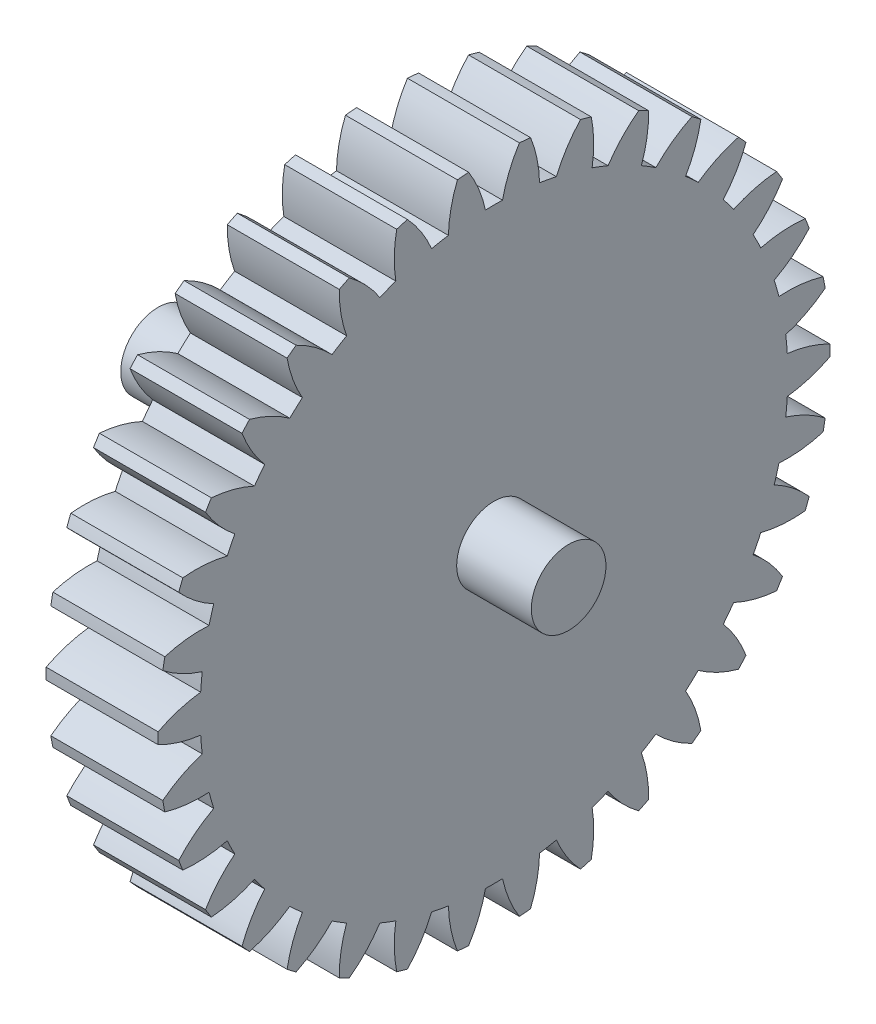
ISO-10303-21;
HEADER;
FILE_DESCRIPTION(('STEP AP214'),'2;1');
FILE_NAME('part.step','',(''),(''),'','','');
FILE_SCHEMA(('AUTOMOTIVE_DESIGN { 1 0 10303 214 1 1 1 1 }'));
ENDSEC;
DATA;
#1=APPLICATION_CONTEXT('core data for automotive mechanical design processes');
#2=APPLICATION_PROTOCOL_DEFINITION('international standard','automotive_design',2000,#1);
#3=PRODUCT_CONTEXT('',#1,'mechanical');
#4=PRODUCT('Part','Part','',(#3));
#5=PRODUCT_RELATED_PRODUCT_CATEGORY('part','',(#4));
#6=PRODUCT_DEFINITION_FORMATION('','',#4);
#7=PRODUCT_DEFINITION_CONTEXT('part definition',#1,'design');
#8=PRODUCT_DEFINITION('design','',#6,#7);
#9=PRODUCT_DEFINITION_SHAPE('','',#8);
#10=(LENGTH_UNIT() NAMED_UNIT(*) SI_UNIT(.MILLI.,.METRE.));
#11=(NAMED_UNIT(*) PLANE_ANGLE_UNIT() SI_UNIT($,.RADIAN.));
#12=(NAMED_UNIT(*) SI_UNIT($,.STERADIAN.) SOLID_ANGLE_UNIT());
#13=UNCERTAINTY_MEASURE_WITH_UNIT(LENGTH_MEASURE(1.E-05),#10,'distance_accuracy_value','');
#14=(GEOMETRIC_REPRESENTATION_CONTEXT(3) GLOBAL_UNCERTAINTY_ASSIGNED_CONTEXT((#13)) GLOBAL_UNIT_ASSIGNED_CONTEXT((#10,
#11,#12)) REPRESENTATION_CONTEXT('',''));
#15=CARTESIAN_POINT('',(0.,0.,0.));
#16=DIRECTION('',(0.,0.,1.));
#17=DIRECTION('',(1.,0.,0.));
#18=AXIS2_PLACEMENT_3D('',#15,#16,#17);
#19=CARTESIAN_POINT('',(-6.,0.,0.));
#20=DIRECTION('',(1.,0.,0.));
#21=DIRECTION('',(0.,0.,-1.));
#22=AXIS2_PLACEMENT_3D('',#19,#20,#21);
#23=CYLINDRICAL_SURFACE('',#22,1.);
#24=CARTESIAN_POINT('',(5.,0.,0.));
#25=DIRECTION('',(1.,0.,0.));
#26=DIRECTION('',(0.,0.,-1.));
#27=AXIS2_PLACEMENT_3D('',#24,#25,#26);
#28=CIRCLE('',#27,1.);
#29=CARTESIAN_POINT('',(5.,0.,-1.));
#30=VERTEX_POINT('',#29);
#31=EDGE_CURVE('E1957',#30,#30,#28,.T.);
#32=ORIENTED_EDGE('',*,*,#31,.F.);
#33=EDGE_LOOP('',(#32));
#34=FACE_BOUND('',#33,.T.);
#35=CARTESIAN_POINT('',(3.,0.,0.));
#36=DIRECTION('',(-1.,0.,0.));
#37=DIRECTION('',(0.,0.,1.));
#38=AXIS2_PLACEMENT_3D('',#35,#36,#37);
#39=CIRCLE('',#38,1.);
#40=CARTESIAN_POINT('',(3.,0.,1.));
#41=VERTEX_POINT('',#40);
#42=EDGE_CURVE('E893',#41,#41,#39,.T.);
#43=ORIENTED_EDGE('',*,*,#42,.F.);
#44=EDGE_LOOP('',(#43));
#45=FACE_BOUND('',#44,.T.);
#46=ADVANCED_FACE('F31',(#34,#45),#23,.T.);
#47=CARTESIAN_POINT('',(5.,0.,0.));
#48=DIRECTION('',(1.,0.,0.));
#49=DIRECTION('',(0.,0.,-1.));
#50=AXIS2_PLACEMENT_3D('',#47,#48,#49);
#51=PLANE('',#50);
#52=ORIENTED_EDGE('',*,*,#31,.T.);
#53=EDGE_LOOP('',(#52));
#54=FACE_BOUND('',#53,.T.);
#55=ADVANCED_FACE('F1928',(#54),#51,.T.);
#56=CARTESIAN_POINT('',(3.,0.,0.));
#57=DIRECTION('',(-1.,0.,0.));
#58=DIRECTION('',(0.,0.,1.));
#59=AXIS2_PLACEMENT_3D('',#56,#57,#58);
#60=PLANE('',#59);
#61=ORIENTED_EDGE('',*,*,#42,.T.);
#62=EDGE_LOOP('',(#61));
#63=FACE_BOUND('',#62,.T.);
#64=CARTESIAN_POINT('',(3.,6.37927593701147,-4.80657820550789));
#65=DIRECTION('',(-1.,0.,0.));
#66=DIRECTION('',(0.,-0.183749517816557,-0.982973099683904));
#67=AXIS2_PLACEMENT_3D('',#64,#65,#66);
#68=CIRCLE('',#67,3.4);
#69=CARTESIAN_POINT('',(3.,7.69458440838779,-1.67130092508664));
#70=VERTEX_POINT('',#69);
#71=CARTESIAN_POINT('',(3.,8.69628762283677,-2.31831438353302));
#72=VERTEX_POINT('',#71);
#73=EDGE_CURVE('E877',#70,#72,#68,.T.);
#74=ORIENTED_EDGE('',*,*,#73,.F.);
#75=CARTESIAN_POINT('',(3.,0.,0.));
#76=DIRECTION('',(-1.,0.,0.));
#77=DIRECTION('',(0.,-0.183749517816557,-0.982973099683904));
#78=AXIS2_PLACEMENT_3D('',#75,#76,#77);
#79=CIRCLE('',#78,7.874);
#80=CARTESIAN_POINT('',(3.,7.77872980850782,-1.22116279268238));
#81=VERTEX_POINT('',#80);
#82=EDGE_CURVE('E876',#81,#70,#79,.T.);
#83=ORIENTED_EDGE('',*,*,#82,.F.);
#84=CARTESIAN_POINT('',(3.,7.68483397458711,2.17754042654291));
#85=DIRECTION('',(-1.,0.,0.));
#86=DIRECTION('',(0.,-0.183749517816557,-0.982973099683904));
#87=AXIS2_PLACEMENT_3D('',#84,#85,#86);
#88=CIRCLE('',#87,3.4);
#89=CARTESIAN_POINT('',(3.,8.94651845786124,-0.979697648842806));
#90=VERTEX_POINT('',#89);
#91=EDGE_CURVE('E865',#90,#81,#88,.T.);
#92=ORIENTED_EDGE('',*,*,#91,.F.);
#93=CARTESIAN_POINT('',(3.,0.,0.));
#94=DIRECTION('',(-1.,0.,0.));
#95=DIRECTION('',(0.,0.,1.));
#96=AXIS2_PLACEMENT_3D('',#93,#94,#95);
#97=CIRCLE('',#96,9.);
#98=CARTESIAN_POINT('',(3.,8.97420595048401,-0.680902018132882));
#99=VERTEX_POINT('',#98);
#100=EDGE_CURVE('E1627',#99,#90,#97,.T.);
#101=ORIENTED_EDGE('',*,*,#100,.F.);
#102=CARTESIAN_POINT('',(3.,7.15386306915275,-3.55254820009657));
#103=DIRECTION('',(-1.,0.,0.));
#104=DIRECTION('',(0.,0.,-1.));
#105=AXIS2_PLACEMENT_3D('',#102,#103,#104);
#106=CIRCLE('',#105,3.4);
#107=CARTESIAN_POINT('',(3.,7.87067022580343,-0.228967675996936));
#108=VERTEX_POINT('',#107);
#109=EDGE_CURVE('E1600',#108,#99,#106,.T.);
#110=ORIENTED_EDGE('',*,*,#109,.F.);
#111=CARTESIAN_POINT('',(3.,0.,0.));
#112=DIRECTION('',(-1.,0.,0.));
#113=DIRECTION('',(0.,0.,-1.));
#114=AXIS2_PLACEMENT_3D('',#111,#112,#113);
#115=CIRCLE('',#114,7.874);
#116=CARTESIAN_POINT('',(3.,7.87067022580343,0.228967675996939));
#117=VERTEX_POINT('',#116);
#118=EDGE_CURVE('E1605',#117,#108,#115,.T.);
#119=ORIENTED_EDGE('',*,*,#118,.F.);
#120=CARTESIAN_POINT('',(3.,7.15386306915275,3.55254820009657));
#121=DIRECTION('',(-1.,0.,0.));
#122=DIRECTION('',(0.,0.,-1.));
#123=AXIS2_PLACEMENT_3D('',#120,#121,#122);
#124=CIRCLE('',#123,3.4);
#125=CARTESIAN_POINT('',(3.,8.97420595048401,0.680902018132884));
#126=VERTEX_POINT('',#125);
#127=EDGE_CURVE('E1602',#126,#117,#124,.T.);
#128=ORIENTED_EDGE('',*,*,#127,.F.);
#129=CARTESIAN_POINT('',(3.,8.94651845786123,0.979697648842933));
#130=VERTEX_POINT('',#129);
#131=EDGE_CURVE('E1625',#130,#126,#97,.T.);
#132=ORIENTED_EDGE('',*,*,#131,.F.);
#133=CARTESIAN_POINT('',(3.,7.68483397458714,-2.1775404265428));
#134=DIRECTION('',(-1.,0.,0.));
#135=DIRECTION('',(0.,0.183749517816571,-0.982973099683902));
#136=AXIS2_PLACEMENT_3D('',#133,#134,#135);
#137=CIRCLE('',#136,3.4);
#138=CARTESIAN_POINT('',(3.,7.77872980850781,1.22116279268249));
#139=VERTEX_POINT('',#138);
#140=EDGE_CURVE('E1578',#139,#130,#137,.T.);
#141=ORIENTED_EDGE('',*,*,#140,.F.);
#142=CARTESIAN_POINT('',(3.,0.,0.));
#143=DIRECTION('',(-1.,0.,0.));
#144=DIRECTION('',(0.,0.183749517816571,-0.982973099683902));
#145=AXIS2_PLACEMENT_3D('',#142,#143,#144);
#146=CIRCLE('',#145,7.874);
#147=CARTESIAN_POINT('',(3.,7.69458440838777,1.67130092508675));
#148=VERTEX_POINT('',#147);
#149=EDGE_CURVE('E1583',#148,#139,#146,.T.);
#150=ORIENTED_EDGE('',*,*,#149,.F.);
#151=CARTESIAN_POINT('',(3.,6.3792759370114,4.80657820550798));
#152=DIRECTION('',(-1.,0.,0.));
#153=DIRECTION('',(0.,0.183749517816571,-0.982973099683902));
#154=AXIS2_PLACEMENT_3D('',#151,#152,#153);
#155=CIRCLE('',#154,3.4);
#156=CARTESIAN_POINT('',(3.,8.69628762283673,2.31831438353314));
#157=VERTEX_POINT('',#156);
#158=EDGE_CURVE('E1580',#157,#148,#155,.T.);
#159=ORIENTED_EDGE('',*,*,#158,.F.);
#160=CARTESIAN_POINT('',(3.,8.61416800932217,2.60693488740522));
#161=VERTEX_POINT('',#160);
#162=EDGE_CURVE('E1885',#161,#157,#97,.T.);
#163=ORIENTED_EDGE('',*,*,#162,.F.);
#164=CARTESIAN_POINT('',(3.,7.95410707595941,-0.728379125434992));
#165=DIRECTION('',(-1.,0.,0.));
#166=DIRECTION('',(0.,0.361241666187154,-0.932472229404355));
#167=AXIS2_PLACEMENT_3D('',#164,#165,#166);
#168=CIRCLE('',#167,3.4);
#169=CARTESIAN_POINT('',(3.,7.42189407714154,2.62970802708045));
#170=VERTEX_POINT('',#169);
#171=EDGE_CURVE('E1556',#170,#161,#168,.T.);
#172=ORIENTED_EDGE('',*,*,#171,.F.);
#173=CARTESIAN_POINT('',(3.,0.,0.));
#174=DIRECTION('',(-1.,0.,0.));
#175=DIRECTION('',(0.,0.361241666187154,-0.932472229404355));
#176=AXIS2_PLACEMENT_3D('',#173,#174,#175);
#177=CIRCLE('',#176,7.874);
#178=CARTESIAN_POINT('',(3.,7.25646874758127,3.05672002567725));
#179=VERTEX_POINT('',#178);
#180=EDGE_CURVE('E1561',#179,#170,#177,.T.);
#181=ORIENTED_EDGE('',*,*,#180,.F.);
#182=CARTESIAN_POINT('',(3.,5.38745021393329,5.89692595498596));
#183=DIRECTION('',(-1.,0.,0.));
#184=DIRECTION('',(0.,0.361241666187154,-0.932472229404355));
#185=AXIS2_PLACEMENT_3D('',#182,#183,#184);
#186=CIRCLE('',#185,3.4);
#187=CARTESIAN_POINT('',(3.,8.12222765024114,3.87677933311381));
#188=VERTEX_POINT('',#187);
#189=EDGE_CURVE('E1558',#188,#179,#186,.T.);
#190=ORIENTED_EDGE('',*,*,#189,.F.);
#191=CARTESIAN_POINT('',(3.,7.98847240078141,4.14539608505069));
#192=VERTEX_POINT('',#191);
#193=EDGE_CURVE('E1880',#192,#188,#97,.T.);
#194=ORIENTED_EDGE('',*,*,#193,.F.);
#195=CARTESIAN_POINT('',(3.,7.95251260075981,0.745586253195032));
#196=DIRECTION('',(-1.,0.,0.));
#197=DIRECTION('',(0.,0.526432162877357,-0.850217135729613));
#198=AXIS2_PLACEMENT_3D('',#195,#196,#197);
#199=CIRCLE('',#198,3.4);
#200=CARTESIAN_POINT('',(3.,6.81231464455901,3.94870170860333));
#201=VERTEX_POINT('',#200);
#202=EDGE_CURVE('E1534',#201,#192,#199,.T.);
#203=ORIENTED_EDGE('',*,*,#202,.F.);
#204=CARTESIAN_POINT('',(3.,0.,0.));
#205=DIRECTION('',(-1.,0.,0.));
#206=DIRECTION('',(0.,0.526432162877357,-0.850217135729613));
#207=AXIS2_PLACEMENT_3D('',#204,#205,#206);
#208=CIRCLE('',#207,7.874);
#209=CARTESIAN_POINT('',(3.,6.57124274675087,4.3380461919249));
#210=VERTEX_POINT('',#209);
#211=EDGE_CURVE('E1539',#210,#201,#208,.T.);
#212=ORIENTED_EDGE('',*,*,#211,.F.);
#213=CARTESIAN_POINT('',(3.,4.21216133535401,6.78646096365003));
#214=DIRECTION('',(-1.,0.,0.));
#215=DIRECTION('',(0.,0.526432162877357,-0.850217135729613));
#216=AXIS2_PLACEMENT_3D('',#213,#214,#215);
#217=CIRCLE('',#216,3.4);
#218=CARTESIAN_POINT('',(3.,7.27157495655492,5.3032252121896));
#219=VERTEX_POINT('',#218);
#220=EDGE_CURVE('E1536',#219,#210,#217,.T.);
#221=ORIENTED_EDGE('',*,*,#220,.F.);
#222=CARTESIAN_POINT('',(3.,7.09073894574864,5.54269079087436));
#223=VERTEX_POINT('',#222);
#224=EDGE_CURVE('E1875',#223,#219,#97,.T.);
#225=ORIENTED_EDGE('',*,*,#224,.F.);
#226=CARTESIAN_POINT('',(3.,7.68010484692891,2.19416158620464));
#227=DIRECTION('',(-1.,0.,0.));
#228=DIRECTION('',(0.,0.673695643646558,-0.739008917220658));
#229=AXIS2_PLACEMENT_3D('',#226,#227,#228);
#230=CIRCLE('',#229,3.4);
#231=CARTESIAN_POINT('',(3.,5.97075000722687,5.13322708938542));
#232=VERTEX_POINT('',#231);
#233=EDGE_CURVE('E1512',#232,#223,#230,.T.);
#234=ORIENTED_EDGE('',*,*,#233,.F.);
#235=CARTESIAN_POINT('',(3.,0.,0.));
#236=DIRECTION('',(-1.,0.,0.));
#237=DIRECTION('',(0.,0.673695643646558,-0.739008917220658));
#238=AXIS2_PLACEMENT_3D('',#235,#236,#237);
#239=CIRCLE('',#238,7.874);
#240=CARTESIAN_POINT('',(3.,5.66224095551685,5.47164539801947));
#241=VERTEX_POINT('',#240);
#242=EDGE_CURVE('E1517',#241,#232,#239,.T.);
#243=ORIENTED_EDGE('',*,*,#242,.F.);
#244=CARTESIAN_POINT('',(3.,2.89343235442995,7.44489118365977));
#245=DIRECTION('',(-1.,0.,0.));
#246=DIRECTION('',(0.,0.673695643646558,-0.739008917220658));
#247=AXIS2_PLACEMENT_3D('',#244,#245,#246);
#248=CIRCLE('',#247,3.4);
#249=CARTESIAN_POINT('',(3.,6.1732974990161,6.54907611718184));
#250=VERTEX_POINT('',#249);
#251=EDGE_CURVE('E1514',#250,#241,#248,.T.);
#252=ORIENTED_EDGE('',*,*,#251,.F.);
#253=CARTESIAN_POINT('',(3.,5.9515388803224,6.75123580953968));
#254=VERTEX_POINT('',#253);
#255=EDGE_CURVE('E1870',#254,#250,#97,.T.);
#256=ORIENTED_EDGE('',*,*,#255,.F.);
#257=CARTESIAN_POINT('',(3.,7.14616033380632,3.56801737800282));
#258=DIRECTION('',(-1.,0.,0.));
#259=DIRECTION('',(0.,0.798017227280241,-0.602634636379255));
#260=AXIS2_PLACEMENT_3D('',#257,#258,#259);
#261=CIRCLE('',#260,3.4);
#262=CARTESIAN_POINT('',(3.,4.92585863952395,6.14294657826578));
#263=VERTEX_POINT('',#262);
#264=EDGE_CURVE('E1490',#263,#254,#261,.T.);
#265=ORIENTED_EDGE('',*,*,#264,.F.);
#266=CARTESIAN_POINT('',(3.,0.,0.));
#267=DIRECTION('',(-1.,0.,0.));
#268=DIRECTION('',(0.,0.798017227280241,-0.602634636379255));
#269=AXIS2_PLACEMENT_3D('',#266,#267,#268);
#270=CIRCLE('',#269,7.874);
#271=CARTESIAN_POINT('',(3.,4.5604183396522,6.41891428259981));
#272=VERTEX_POINT('',#271);
#273=EDGE_CURVE('E1495',#272,#263,#270,.T.);
#274=ORIENTED_EDGE('',*,*,#273,.F.);
#275=CARTESIAN_POINT('',(3.,1.47617100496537,7.84979456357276));
#276=DIRECTION('',(-1.,0.,0.));
#277=DIRECTION('',(0.,0.798017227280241,-0.602634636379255));
#278=AXIS2_PLACEMENT_3D('',#275,#276,#277);
#279=CIRCLE('',#278,3.4);
#280=CARTESIAN_POINT('',(3.,4.86479579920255,7.5719060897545));
#281=VERTEX_POINT('',#280);
#282=EDGE_CURVE('E1492',#281,#272,#279,.T.);
#283=ORIENTED_EDGE('',*,*,#282,.F.);
#284=CARTESIAN_POINT('',(3.,4.60966629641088,7.72987558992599));
#285=VERTEX_POINT('',#284);
#286=EDGE_CURVE('E1865',#285,#281,#97,.T.);
#287=ORIENTED_EDGE('',*,*,#286,.F.);
#288=CARTESIAN_POINT('',(3.,6.36886190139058,4.82036861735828));
#289=DIRECTION('',(-1.,0.,0.));
#290=DIRECTION('',(0.,0.895163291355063,-0.445738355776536));
#291=AXIS2_PLACEMENT_3D('',#288,#289,#290);
#292=CIRCLE('',#291,3.4);
#293=CARTESIAN_POINT('',(3.,3.71322306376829,6.94347538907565));
#294=VERTEX_POINT('',#293);
#295=EDGE_CURVE('E1468',#294,#285,#292,.T.);
#296=ORIENTED_EDGE('',*,*,#295,.F.);
#297=CARTESIAN_POINT('',(3.,0.,0.));
#298=DIRECTION('',(-1.,0.,0.));
#299=DIRECTION('',(0.,0.895163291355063,-0.445738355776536));
#300=AXIS2_PLACEMENT_3D('',#297,#298,#299);
#301=CIRCLE('',#300,7.874);
#302=CARTESIAN_POINT('',(3.,3.30329614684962,7.14759473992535));
#303=VERTEX_POINT('',#302);
#304=EDGE_CURVE('E1473',#303,#294,#301,.T.);
#305=ORIENTED_EDGE('',*,*,#304,.F.);
#306=CARTESIAN_POINT('',(3.,0.00864042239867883,7.98738260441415));
#307=DIRECTION('',(-1.,0.,0.));
#308=DIRECTION('',(0.,0.895163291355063,-0.445738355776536));
#309=AXIS2_PLACEMENT_3D('',#306,#307,#308);
#310=CIRCLE('',#309,3.4);
#311=CARTESIAN_POINT('',(3.,3.39062931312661,8.33688388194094));
#312=VERTEX_POINT('',#311);
#313=EDGE_CURVE('E1470',#312,#303,#310,.T.);
#314=ORIENTED_EDGE('',*,*,#313,.F.);
#315=CARTESIAN_POINT('',(3.,3.11081705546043,8.44528372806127));
#316=VERTEX_POINT('',#315);
#317=EDGE_CURVE('E1860',#316,#312,#97,.T.);
#318=ORIENTED_EDGE('',*,*,#317,.F.);
#319=CARTESIAN_POINT('',(3.,5.37467951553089,5.90856798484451));
#320=DIRECTION('',(-1.,0.,0.));
#321=DIRECTION('',(0.,0.96182564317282,-0.27366299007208));
#322=AXIS2_PLACEMENT_3D('',#319,#320,#321);
#323=CIRCLE('',#322,3.4);
#324=CARTESIAN_POINT('',(3.,2.3741381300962,7.50755247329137));
#325=VERTEX_POINT('',#324);
#326=EDGE_CURVE('E1446',#325,#316,#323,.T.);
#327=ORIENTED_EDGE('',*,*,#326,.F.);
#328=CARTESIAN_POINT('',(3.,0.,0.));
#329=DIRECTION('',(-1.,0.,0.));
#330=DIRECTION('',(0.,0.96182564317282,-0.27366299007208));
#331=AXIS2_PLACEMENT_3D('',#328,#329,#330);
#332=CIRCLE('',#331,7.874);
#333=CARTESIAN_POINT('',(3.,1.93368416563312,7.63287243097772));
#334=VERTEX_POINT('',#333);
#335=EDGE_CURVE('E1451',#334,#325,#332,.T.);
#336=ORIENTED_EDGE('',*,*,#335,.F.);
#337=CARTESIAN_POINT('',(3.,-1.45918439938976,7.85296991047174));
#338=DIRECTION('',(-1.,0.,0.));
#339=DIRECTION('',(0.,0.96182564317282,-0.27366299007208));
#340=AXIS2_PLACEMENT_3D('',#337,#338,#339);
#341=CIRCLE('',#340,3.4);
#342=CARTESIAN_POINT('',(3.,1.80099901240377,8.81795909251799));
#343=VERTEX_POINT('',#342);
#344=EDGE_CURVE('E1448',#343,#334,#341,.T.);
#345=ORIENTED_EDGE('',*,*,#344,.F.);
#346=CARTESIAN_POINT('',(3.,1.5060326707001,8.87309785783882));
#347=VERTEX_POINT('',#346);
#348=EDGE_CURVE('E1855',#347,#343,#97,.T.);
#349=ORIENTED_EDGE('',*,*,#348,.F.);
#350=CARTESIAN_POINT('',(3.,4.19746886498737,6.79555815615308));
#351=DIRECTION('',(-1.,0.,0.));
#352=DIRECTION('',(0.,0.995734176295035,-0.0922683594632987));
#353=AXIS2_PLACEMENT_3D('',#350,#351,#352);
#354=CIRCLE('',#353,3.4);
#355=CARTESIAN_POINT('',(3.,0.954204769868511,7.81596886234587));
#356=VERTEX_POINT('',#355);
#357=EDGE_CURVE('E1424',#356,#347,#354,.T.);
#358=ORIENTED_EDGE('',*,*,#357,.F.);
#359=CARTESIAN_POINT('',(3.,0.,0.));
#360=DIRECTION('',(-1.,0.,0.));
#361=DIRECTION('',(0.,0.995734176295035,-0.0922683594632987));
#362=AXIS2_PLACEMENT_3D('',#359,#360,#361);
#363=CIRCLE('',#362,7.874);
#364=CARTESIAN_POINT('',(3.,0.498222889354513,7.85822180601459));
#365=VERTEX_POINT('',#364);
#366=EDGE_CURVE('E1429',#365,#356,#363,.T.);
#367=ORIENTED_EDGE('',*,*,#366,.F.);
#368=CARTESIAN_POINT('',(3.,-2.87731844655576,7.45113374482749));
#369=DIRECTION('',(-1.,0.,0.));
#370=DIRECTION('',(0.,0.995734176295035,-0.0922683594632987));
#371=AXIS2_PLACEMENT_3D('',#368,#369,#370);
#372=CIRCLE('',#371,3.4);
#373=CARTESIAN_POINT('',(3.,0.150037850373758,8.99874928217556));
#374=VERTEX_POINT('',#373);
#375=EDGE_CURVE('E1426',#374,#365,#372,.T.);
#376=ORIENTED_EDGE('',*,*,#375,.F.);
#377=CARTESIAN_POINT('',(3.,-0.150037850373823,8.99874928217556));
#378=VERTEX_POINT('',#377);
#379=EDGE_CURVE('E1850',#378,#374,#97,.T.);
#380=ORIENTED_EDGE('',*,*,#379,.F.);
#381=CARTESIAN_POINT('',(3.,2.87731844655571,7.45113374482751));
#382=DIRECTION('',(-1.,0.,0.));
#383=DIRECTION('',(0.,0.995734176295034,0.0922683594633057));
#384=AXIS2_PLACEMENT_3D('',#381,#382,#383);
#385=CIRCLE('',#384,3.4);
#386=CARTESIAN_POINT('',(3.,-0.49822288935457,7.85822180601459));
#387=VERTEX_POINT('',#386);
#388=EDGE_CURVE('E1402',#387,#378,#385,.T.);
#389=ORIENTED_EDGE('',*,*,#388,.F.);
#390=CARTESIAN_POINT('',(3.,0.,0.));
#391=DIRECTION('',(-1.,0.,0.));
#392=DIRECTION('',(0.,0.995734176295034,0.0922683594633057));
#393=AXIS2_PLACEMENT_3D('',#390,#391,#392);
#394=CIRCLE('',#393,7.874);
#395=CARTESIAN_POINT('',(3.,-0.954204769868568,7.81596886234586));
#396=VERTEX_POINT('',#395);
#397=EDGE_CURVE('E1407',#396,#387,#394,.T.);
#398=ORIENTED_EDGE('',*,*,#397,.F.);
#399=CARTESIAN_POINT('',(3.,-4.19746886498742,6.79555815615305));
#400=DIRECTION('',(-1.,0.,0.));
#401=DIRECTION('',(0.,0.995734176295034,0.0922683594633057));
#402=AXIS2_PLACEMENT_3D('',#399,#400,#401);
#403=CIRCLE('',#402,3.4);
#404=CARTESIAN_POINT('',(3.,-1.50603267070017,8.87309785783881));
#405=VERTEX_POINT('',#404);
#406=EDGE_CURVE('E1404',#405,#396,#403,.T.);
#407=ORIENTED_EDGE('',*,*,#406,.F.);
#408=CARTESIAN_POINT('',(3.,-1.80099901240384,8.81795909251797));
#409=VERTEX_POINT('',#408);
#410=EDGE_CURVE('E1845',#409,#405,#97,.T.);
#411=ORIENTED_EDGE('',*,*,#410,.F.);
#412=CARTESIAN_POINT('',(3.,1.4591843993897,7.85296991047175));
#413=DIRECTION('',(-1.,0.,0.));
#414=DIRECTION('',(0.,0.961825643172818,0.273662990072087));
#415=AXIS2_PLACEMENT_3D('',#412,#413,#414);
#416=CIRCLE('',#415,3.4);
#417=CARTESIAN_POINT('',(3.,-1.93368416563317,7.63287243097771));
#418=VERTEX_POINT('',#417);
#419=EDGE_CURVE('E1380',#418,#409,#416,.T.);
#420=ORIENTED_EDGE('',*,*,#419,.F.);
#421=CARTESIAN_POINT('',(3.,0.,0.));
#422=DIRECTION('',(-1.,0.,0.));
#423=DIRECTION('',(0.,0.961825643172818,0.273662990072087));
#424=AXIS2_PLACEMENT_3D('',#421,#422,#423);
#425=CIRCLE('',#424,7.874);
#426=CARTESIAN_POINT('',(3.,-2.37413813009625,7.50755247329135));
#427=VERTEX_POINT('',#426);
#428=EDGE_CURVE('E1385',#427,#418,#425,.T.);
#429=ORIENTED_EDGE('',*,*,#428,.F.);
#430=CARTESIAN_POINT('',(3.,-5.37467951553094,5.90856798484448));
#431=DIRECTION('',(-1.,0.,0.));
#432=DIRECTION('',(0.,0.961825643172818,0.273662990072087));
#433=AXIS2_PLACEMENT_3D('',#430,#431,#432);
#434=CIRCLE('',#433,3.4);
#435=CARTESIAN_POINT('',(3.,-3.1108170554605,8.44528372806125));
#436=VERTEX_POINT('',#435);
#437=EDGE_CURVE('E1382',#436,#427,#434,.T.);
#438=ORIENTED_EDGE('',*,*,#437,.F.);
#439=CARTESIAN_POINT('',(3.,-3.39062931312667,8.33688388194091));
#440=VERTEX_POINT('',#439);
#441=EDGE_CURVE('E1840',#440,#436,#97,.T.);
#442=ORIENTED_EDGE('',*,*,#441,.F.);
#443=CARTESIAN_POINT('',(3.,-0.00864042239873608,7.98738260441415));
#444=DIRECTION('',(-1.,0.,0.));
#445=DIRECTION('',(0.,0.895163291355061,0.445738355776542));
#446=AXIS2_PLACEMENT_3D('',#443,#444,#445);
#447=CIRCLE('',#446,3.4);
#448=CARTESIAN_POINT('',(3.,-3.30329614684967,7.14759473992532));
#449=VERTEX_POINT('',#448);
#450=EDGE_CURVE('E1358',#449,#440,#447,.T.);
#451=ORIENTED_EDGE('',*,*,#450,.F.);
#452=CARTESIAN_POINT('',(3.,0.,0.));
#453=DIRECTION('',(-1.,0.,0.));
#454=DIRECTION('',(0.,0.895163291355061,0.445738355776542));
#455=AXIS2_PLACEMENT_3D('',#452,#453,#454);
#456=CIRCLE('',#455,7.874);
#457=CARTESIAN_POINT('',(3.,-3.71322306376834,6.94347538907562));
#458=VERTEX_POINT('',#457);
#459=EDGE_CURVE('E1363',#458,#449,#456,.T.);
#460=ORIENTED_EDGE('',*,*,#459,.F.);
#461=CARTESIAN_POINT('',(3.,-6.36886190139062,4.82036861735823));
#462=DIRECTION('',(-1.,0.,0.));
#463=DIRECTION('',(0.,0.895163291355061,0.445738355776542));
#464=AXIS2_PLACEMENT_3D('',#461,#462,#463);
#465=CIRCLE('',#464,3.4);
#466=CARTESIAN_POINT('',(3.,-4.60966629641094,7.72987558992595));
#467=VERTEX_POINT('',#466);
#468=EDGE_CURVE('E1360',#467,#458,#465,.T.);
#469=ORIENTED_EDGE('',*,*,#468,.F.);
#470=CARTESIAN_POINT('',(3.,-4.86479579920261,7.57190608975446));
#471=VERTEX_POINT('',#470);
#472=EDGE_CURVE('E1835',#471,#467,#97,.T.);
#473=ORIENTED_EDGE('',*,*,#472,.F.);
#474=CARTESIAN_POINT('',(3.,-1.47617100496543,7.84979456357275));
#475=DIRECTION('',(-1.,0.,0.));
#476=DIRECTION('',(0.,0.798017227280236,0.602634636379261));
#477=AXIS2_PLACEMENT_3D('',#474,#475,#476);
#478=CIRCLE('',#477,3.4);
#479=CARTESIAN_POINT('',(3.,-4.56041833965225,6.41891428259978));
#480=VERTEX_POINT('',#479);
#481=EDGE_CURVE('E1336',#480,#471,#478,.T.);
#482=ORIENTED_EDGE('',*,*,#481,.F.);
#483=CARTESIAN_POINT('',(3.,0.,0.));
#484=DIRECTION('',(-1.,0.,0.));
#485=DIRECTION('',(0.,0.798017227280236,0.602634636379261));
#486=AXIS2_PLACEMENT_3D('',#483,#484,#485);
#487=CIRCLE('',#486,7.874);
#488=CARTESIAN_POINT('',(3.,-4.925858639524,6.14294657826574));
#489=VERTEX_POINT('',#488);
#490=EDGE_CURVE('E1341',#489,#480,#487,.T.);
#491=ORIENTED_EDGE('',*,*,#490,.F.);
#492=CARTESIAN_POINT('',(3.,-7.14616033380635,3.56801737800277));
#493=DIRECTION('',(-1.,0.,0.));
#494=DIRECTION('',(0.,0.798017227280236,0.602634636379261));
#495=AXIS2_PLACEMENT_3D('',#492,#493,#494);
#496=CIRCLE('',#495,3.4);
#497=CARTESIAN_POINT('',(3.,-5.95153888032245,6.75123580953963));
#498=VERTEX_POINT('',#497);
#499=EDGE_CURVE('E1338',#498,#489,#496,.T.);
#500=ORIENTED_EDGE('',*,*,#499,.F.);
#501=CARTESIAN_POINT('',(3.,-6.17329749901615,6.54907611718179));
#502=VERTEX_POINT('',#501);
#503=EDGE_CURVE('E1830',#502,#498,#97,.T.);
#504=ORIENTED_EDGE('',*,*,#503,.F.);
#505=CARTESIAN_POINT('',(3.,-2.89343235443,7.44489118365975));
#506=DIRECTION('',(-1.,0.,0.));
#507=DIRECTION('',(0.,0.673695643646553,0.739008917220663));
#508=AXIS2_PLACEMENT_3D('',#505,#506,#507);
#509=CIRCLE('',#508,3.4);
#510=CARTESIAN_POINT('',(3.,-5.66224095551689,5.47164539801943));
#511=VERTEX_POINT('',#510);
#512=EDGE_CURVE('E1314',#511,#502,#509,.T.);
#513=ORIENTED_EDGE('',*,*,#512,.F.);
#514=CARTESIAN_POINT('',(3.,0.,0.));
#515=DIRECTION('',(-1.,0.,0.));
#516=DIRECTION('',(0.,0.673695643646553,0.739008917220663));
#517=AXIS2_PLACEMENT_3D('',#514,#515,#516);
#518=CIRCLE('',#517,7.874);
#519=CARTESIAN_POINT('',(3.,-5.97075000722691,5.13322708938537));
#520=VERTEX_POINT('',#519);
#521=EDGE_CURVE('E1319',#520,#511,#518,.T.);
#522=ORIENTED_EDGE('',*,*,#521,.F.);
#523=CARTESIAN_POINT('',(3.,-7.68010484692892,2.19416158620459));
#524=DIRECTION('',(-1.,0.,0.));
#525=DIRECTION('',(0.,0.673695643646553,0.739008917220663));
#526=AXIS2_PLACEMENT_3D('',#523,#524,#525);
#527=CIRCLE('',#526,3.4);
#528=CARTESIAN_POINT('',(3.,-7.09073894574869,5.5426907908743));
#529=VERTEX_POINT('',#528);
#530=EDGE_CURVE('E1316',#529,#520,#527,.T.);
#531=ORIENTED_EDGE('',*,*,#530,.F.);
#532=CARTESIAN_POINT('',(3.,-7.27157495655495,5.30322521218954));
#533=VERTEX_POINT('',#532);
#534=EDGE_CURVE('E1825',#533,#529,#97,.T.);
#535=ORIENTED_EDGE('',*,*,#534,.F.);
#536=CARTESIAN_POINT('',(3.,-4.21216133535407,6.78646096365));
#537=DIRECTION('',(-1.,0.,0.));
#538=DIRECTION('',(0.,0.526432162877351,0.850217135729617));
#539=AXIS2_PLACEMENT_3D('',#536,#537,#538);
#540=CIRCLE('',#539,3.4);
#541=CARTESIAN_POINT('',(3.,-6.5712427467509,4.33804619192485));
#542=VERTEX_POINT('',#541);
#543=EDGE_CURVE('E1292',#542,#533,#540,.T.);
#544=ORIENTED_EDGE('',*,*,#543,.F.);
#545=CARTESIAN_POINT('',(3.,0.,0.));
#546=DIRECTION('',(-1.,0.,0.));
#547=DIRECTION('',(0.,0.526432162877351,0.850217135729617));
#548=AXIS2_PLACEMENT_3D('',#545,#546,#547);
#549=CIRCLE('',#548,7.874);
#550=CARTESIAN_POINT('',(3.,-6.81231464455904,3.94870170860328));
#551=VERTEX_POINT('',#550);
#552=EDGE_CURVE('E1297',#551,#542,#549,.T.);
#553=ORIENTED_EDGE('',*,*,#552,.F.);
#554=CARTESIAN_POINT('',(3.,-7.95251260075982,0.745586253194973));
#555=DIRECTION('',(-1.,0.,0.));
#556=DIRECTION('',(0.,0.526432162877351,0.850217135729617));
#557=AXIS2_PLACEMENT_3D('',#554,#555,#556);
#558=CIRCLE('',#557,3.4);
#559=CARTESIAN_POINT('',(3.,-7.98847240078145,4.14539608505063));
#560=VERTEX_POINT('',#559);
#561=EDGE_CURVE('E1294',#560,#551,#558,.T.);
#562=ORIENTED_EDGE('',*,*,#561,.F.);
#563=CARTESIAN_POINT('',(3.,-8.12222765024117,3.87677933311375));
#564=VERTEX_POINT('',#563);
#565=EDGE_CURVE('E1820',#564,#560,#97,.T.);
#566=ORIENTED_EDGE('',*,*,#565,.F.);
#567=CARTESIAN_POINT('',(3.,-5.38745021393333,5.89692595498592));
#568=DIRECTION('',(-1.,0.,0.));
#569=DIRECTION('',(0.,0.361241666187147,0.932472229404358));
#570=AXIS2_PLACEMENT_3D('',#567,#568,#569);
#571=CIRCLE('',#570,3.4);
#572=CARTESIAN_POINT('',(3.,-7.25646874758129,3.0567200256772));
#573=VERTEX_POINT('',#572);
#574=EDGE_CURVE('E1270',#573,#564,#571,.T.);
#575=ORIENTED_EDGE('',*,*,#574,.F.);
#576=CARTESIAN_POINT('',(3.,0.,0.));
#577=DIRECTION('',(-1.,0.,0.));
#578=DIRECTION('',(0.,0.361241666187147,0.932472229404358));
#579=AXIS2_PLACEMENT_3D('',#576,#577,#578);
#580=CIRCLE('',#579,7.874);
#581=CARTESIAN_POINT('',(3.,-7.42189407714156,2.6297080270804));
#582=VERTEX_POINT('',#581);
#583=EDGE_CURVE('E1275',#582,#573,#580,.T.);
#584=ORIENTED_EDGE('',*,*,#583,.F.);
#585=CARTESIAN_POINT('',(3.,-7.9541070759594,-0.728379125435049));
#586=DIRECTION('',(-1.,0.,0.));
#587=DIRECTION('',(0.,0.361241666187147,0.932472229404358));
#588=AXIS2_PLACEMENT_3D('',#585,#586,#587);
#589=CIRCLE('',#588,3.4);
#590=CARTESIAN_POINT('',(3.,-8.61416800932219,2.60693488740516));
#591=VERTEX_POINT('',#590);
#592=EDGE_CURVE('E1272',#591,#582,#589,.T.);
#593=ORIENTED_EDGE('',*,*,#592,.F.);
#594=CARTESIAN_POINT('',(3.,-8.69628762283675,2.31831438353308));
#595=VERTEX_POINT('',#594);
#596=EDGE_CURVE('E1815',#595,#591,#97,.T.);
#597=ORIENTED_EDGE('',*,*,#596,.F.);
#598=CARTESIAN_POINT('',(3.,-6.37927593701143,4.80657820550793));
#599=DIRECTION('',(-1.,0.,0.));
#600=DIRECTION('',(0.,0.183749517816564,0.982973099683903));
#601=AXIS2_PLACEMENT_3D('',#598,#599,#600);
#602=CIRCLE('',#601,3.4);
#603=CARTESIAN_POINT('',(3.,-7.69458440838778,1.67130092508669));
#604=VERTEX_POINT('',#603);
#605=EDGE_CURVE('E1248',#604,#595,#602,.T.);
#606=ORIENTED_EDGE('',*,*,#605,.F.);
#607=CARTESIAN_POINT('',(3.,0.,0.));
#608=DIRECTION('',(-1.,0.,0.));
#609=DIRECTION('',(0.,0.183749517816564,0.982973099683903));
#610=AXIS2_PLACEMENT_3D('',#607,#608,#609);
#611=CIRCLE('',#610,7.874);
#612=CARTESIAN_POINT('',(3.,-7.77872980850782,1.22116279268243));
#613=VERTEX_POINT('',#612);
#614=EDGE_CURVE('E1253',#613,#604,#611,.T.);
#615=ORIENTED_EDGE('',*,*,#614,.F.);
#616=CARTESIAN_POINT('',(3.,-7.68483397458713,-2.17754042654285));
#617=DIRECTION('',(-1.,0.,0.));
#618=DIRECTION('',(0.,0.183749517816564,0.982973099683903));
#619=AXIS2_PLACEMENT_3D('',#616,#617,#618);
#620=CIRCLE('',#619,3.4);
#621=CARTESIAN_POINT('',(3.,-8.94651845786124,0.979697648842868));
#622=VERTEX_POINT('',#621);
#623=EDGE_CURVE('E1250',#622,#613,#620,.T.);
#624=ORIENTED_EDGE('',*,*,#623,.F.);
#625=CARTESIAN_POINT('',(3.,-8.97420595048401,0.680902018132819));
#626=VERTEX_POINT('',#625);
#627=EDGE_CURVE('E1810',#626,#622,#97,.T.);
#628=ORIENTED_EDGE('',*,*,#627,.F.);
#629=CARTESIAN_POINT('',(3.,-7.15386306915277,3.55254820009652));
#630=DIRECTION('',(-1.,0.,0.));
#631=DIRECTION('',(0.,0.,1.));
#632=AXIS2_PLACEMENT_3D('',#629,#630,#631);
#633=CIRCLE('',#632,3.4);
#634=CARTESIAN_POINT('',(3.,-7.87067022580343,0.228967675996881));
#635=VERTEX_POINT('',#634);
#636=EDGE_CURVE('E1226',#635,#626,#633,.T.);
#637=ORIENTED_EDGE('',*,*,#636,.F.);
#638=CARTESIAN_POINT('',(3.,0.,0.));
#639=DIRECTION('',(-1.,0.,0.));
#640=DIRECTION('',(0.,0.,1.));
#641=AXIS2_PLACEMENT_3D('',#638,#639,#640);
#642=CIRCLE('',#641,7.874);
#643=CARTESIAN_POINT('',(3.,-7.87067022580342,-0.228967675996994));
#644=VERTEX_POINT('',#643);
#645=EDGE_CURVE('E1231',#644,#635,#642,.T.);
#646=ORIENTED_EDGE('',*,*,#645,.F.);
#647=CARTESIAN_POINT('',(3.,-7.15386306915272,-3.55254820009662));
#648=DIRECTION('',(-1.,0.,0.));
#649=DIRECTION('',(0.,0.,1.));
#650=AXIS2_PLACEMENT_3D('',#647,#648,#649);
#651=CIRCLE('',#650,3.4);
#652=CARTESIAN_POINT('',(3.,-8.974205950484,-0.680902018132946));
#653=VERTEX_POINT('',#652);
#654=EDGE_CURVE('E1228',#653,#644,#651,.T.);
#655=ORIENTED_EDGE('',*,*,#654,.F.);
#656=CARTESIAN_POINT('',(3.,-8.94651845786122,-0.979697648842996));
#657=VERTEX_POINT('',#656);
#658=EDGE_CURVE('E1805',#657,#653,#97,.T.);
#659=ORIENTED_EDGE('',*,*,#658,.F.);
#660=CARTESIAN_POINT('',(3.,-7.68483397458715,2.17754042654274));
#661=DIRECTION('',(-1.,0.,0.));
#662=DIRECTION('',(0.,-0.183749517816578,0.9829730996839));
#663=AXIS2_PLACEMENT_3D('',#660,#661,#662);
#664=CIRCLE('',#663,3.4);
#665=CARTESIAN_POINT('',(3.,-7.7787298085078,-1.22116279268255));
#666=VERTEX_POINT('',#665);
#667=EDGE_CURVE('E1204',#666,#657,#664,.T.);
#668=ORIENTED_EDGE('',*,*,#667,.F.);
#669=CARTESIAN_POINT('',(3.,0.,0.));
#670=DIRECTION('',(-1.,0.,0.));
#671=DIRECTION('',(0.,-0.183749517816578,0.9829730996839));
#672=AXIS2_PLACEMENT_3D('',#669,#670,#671);
#673=CIRCLE('',#672,7.874);
#674=CARTESIAN_POINT('',(3.,-7.69458440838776,-1.6713009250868));
#675=VERTEX_POINT('',#674);
#676=EDGE_CURVE('E1209',#675,#666,#673,.T.);
#677=ORIENTED_EDGE('',*,*,#676,.F.);
#678=CARTESIAN_POINT('',(3.,-6.37927593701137,-4.80657820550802));
#679=DIRECTION('',(-1.,0.,0.));
#680=DIRECTION('',(0.,-0.183749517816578,0.9829730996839));
#681=AXIS2_PLACEMENT_3D('',#678,#679,#680);
#682=CIRCLE('',#681,3.4);
#683=CARTESIAN_POINT('',(3.,-8.69628762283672,-2.3183143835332));
#684=VERTEX_POINT('',#683);
#685=EDGE_CURVE('E1206',#684,#675,#682,.T.);
#686=ORIENTED_EDGE('',*,*,#685,.F.);
#687=CARTESIAN_POINT('',(3.,-8.61416800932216,-2.60693488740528));
#688=VERTEX_POINT('',#687);
#689=EDGE_CURVE('E1800',#688,#684,#97,.T.);
#690=ORIENTED_EDGE('',*,*,#689,.F.);
#691=CARTESIAN_POINT('',(3.,-7.95410707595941,0.728379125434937));
#692=DIRECTION('',(-1.,0.,0.));
#693=DIRECTION('',(0.,-0.36124166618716,0.932472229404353));
#694=AXIS2_PLACEMENT_3D('',#691,#692,#693);
#695=CIRCLE('',#694,3.4);
#696=CARTESIAN_POINT('',(3.,-7.42189407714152,-2.6297080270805));
#697=VERTEX_POINT('',#696);
#698=EDGE_CURVE('E1182',#697,#688,#695,.T.);
#699=ORIENTED_EDGE('',*,*,#698,.F.);
#700=CARTESIAN_POINT('',(3.,0.,0.));
#701=DIRECTION('',(-1.,0.,0.));
#702=DIRECTION('',(0.,-0.36124166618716,0.932472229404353));
#703=AXIS2_PLACEMENT_3D('',#700,#701,#702);
#704=CIRCLE('',#703,7.874);
#705=CARTESIAN_POINT('',(3.,-7.25646874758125,-3.0567200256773));
#706=VERTEX_POINT('',#705);
#707=EDGE_CURVE('E1187',#706,#697,#704,.T.);
#708=ORIENTED_EDGE('',*,*,#707,.F.);
#709=CARTESIAN_POINT('',(3.,-5.38745021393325,-5.896925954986));
#710=DIRECTION('',(-1.,0.,0.));
#711=DIRECTION('',(0.,-0.36124166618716,0.932472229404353));
#712=AXIS2_PLACEMENT_3D('',#709,#710,#711);
#713=CIRCLE('',#712,3.4);
#714=CARTESIAN_POINT('',(3.,-8.12222765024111,-3.87677933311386));
#715=VERTEX_POINT('',#714);
#716=EDGE_CURVE('E1184',#715,#706,#713,.T.);
#717=ORIENTED_EDGE('',*,*,#716,.F.);
#718=CARTESIAN_POINT('',(3.,-7.98847240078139,-4.14539608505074));
#719=VERTEX_POINT('',#718);
#720=EDGE_CURVE('E1795',#719,#715,#97,.T.);
#721=ORIENTED_EDGE('',*,*,#720,.F.);
#722=CARTESIAN_POINT('',(3.,-7.95251260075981,-0.745586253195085));
#723=DIRECTION('',(-1.,0.,0.));
#724=DIRECTION('',(0.,-0.526432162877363,0.85021713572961));
#725=AXIS2_PLACEMENT_3D('',#722,#723,#724);
#726=CIRCLE('',#725,3.4);
#727=CARTESIAN_POINT('',(3.,-6.81231464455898,-3.94870170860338));
#728=VERTEX_POINT('',#727);
#729=EDGE_CURVE('E1160',#728,#719,#726,.T.);
#730=ORIENTED_EDGE('',*,*,#729,.F.);
#731=CARTESIAN_POINT('',(3.,0.,0.));
#732=DIRECTION('',(-1.,0.,0.));
#733=DIRECTION('',(0.,-0.526432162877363,0.85021713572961));
#734=AXIS2_PLACEMENT_3D('',#731,#732,#733);
#735=CIRCLE('',#734,7.874);
#736=CARTESIAN_POINT('',(3.,-6.57124274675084,-4.33804619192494));
#737=VERTEX_POINT('',#736);
#738=EDGE_CURVE('E1165',#737,#728,#735,.T.);
#739=ORIENTED_EDGE('',*,*,#738,.F.);
#740=CARTESIAN_POINT('',(3.,-4.21216133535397,-6.78646096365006));
#741=DIRECTION('',(-1.,0.,0.));
#742=DIRECTION('',(0.,-0.526432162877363,0.85021713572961));
#743=AXIS2_PLACEMENT_3D('',#740,#741,#742);
#744=CIRCLE('',#743,3.4);
#745=CARTESIAN_POINT('',(3.,-7.27157495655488,-5.30322521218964));
#746=VERTEX_POINT('',#745);
#747=EDGE_CURVE('E1162',#746,#737,#744,.T.);
#748=ORIENTED_EDGE('',*,*,#747,.F.);
#749=CARTESIAN_POINT('',(3.,-7.09073894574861,-5.54269079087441));
#750=VERTEX_POINT('',#749);
#751=EDGE_CURVE('E1790',#750,#746,#97,.T.);
#752=ORIENTED_EDGE('',*,*,#751,.F.);
#753=CARTESIAN_POINT('',(3.,-7.68010484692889,-2.1941615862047));
#754=DIRECTION('',(-1.,0.,0.));
#755=DIRECTION('',(0.,-0.673695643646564,0.739008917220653));
#756=AXIS2_PLACEMENT_3D('',#753,#754,#755);
#757=CIRCLE('',#756,3.4);
#758=CARTESIAN_POINT('',(3.,-5.97075000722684,-5.13322708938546));
#759=VERTEX_POINT('',#758);
#760=EDGE_CURVE('E1138',#759,#750,#757,.T.);
#761=ORIENTED_EDGE('',*,*,#760,.F.);
#762=CARTESIAN_POINT('',(3.,0.,0.));
#763=DIRECTION('',(-1.,0.,0.));
#764=DIRECTION('',(0.,-0.673695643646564,0.739008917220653));
#765=AXIS2_PLACEMENT_3D('',#762,#763,#764);
#766=CIRCLE('',#765,7.874);
#767=CARTESIAN_POINT('',(3.,-5.66224095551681,-5.47164539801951));
#768=VERTEX_POINT('',#767);
#769=EDGE_CURVE('E1143',#768,#759,#766,.T.);
#770=ORIENTED_EDGE('',*,*,#769,.F.);
#771=CARTESIAN_POINT('',(3.,-2.89343235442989,-7.44489118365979));
#772=DIRECTION('',(-1.,0.,0.));
#773=DIRECTION('',(0.,-0.673695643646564,0.739008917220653));
#774=AXIS2_PLACEMENT_3D('',#771,#772,#773);
#775=CIRCLE('',#774,3.4);
#776=CARTESIAN_POINT('',(3.,-6.17329749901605,-6.54907611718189));
#777=VERTEX_POINT('',#776);
#778=EDGE_CURVE('E1140',#777,#768,#775,.T.);
#779=ORIENTED_EDGE('',*,*,#778,.F.);
#780=CARTESIAN_POINT('',(3.,-5.95153888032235,-6.75123580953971));
#781=VERTEX_POINT('',#780);
#782=EDGE_CURVE('E1785',#781,#777,#97,.T.);
#783=ORIENTED_EDGE('',*,*,#782,.F.);
#784=CARTESIAN_POINT('',(3.,-7.1461603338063,-3.56801737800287));
#785=DIRECTION('',(-1.,0.,0.));
#786=DIRECTION('',(0.,-0.798017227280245,0.602634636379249));
#787=AXIS2_PLACEMENT_3D('',#784,#785,#786);
#788=CIRCLE('',#787,3.4);
#789=CARTESIAN_POINT('',(3.,-4.92585863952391,-6.14294657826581));
#790=VERTEX_POINT('',#789);
#791=EDGE_CURVE('E1116',#790,#781,#788,.T.);
#792=ORIENTED_EDGE('',*,*,#791,.F.);
#793=CARTESIAN_POINT('',(3.,0.,0.));
#794=DIRECTION('',(-1.,0.,0.));
#795=DIRECTION('',(0.,-0.798017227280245,0.602634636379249));
#796=AXIS2_PLACEMENT_3D('',#793,#794,#795);
#797=CIRCLE('',#796,7.874);
#798=CARTESIAN_POINT('',(3.,-4.56041833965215,-6.41891428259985));
#799=VERTEX_POINT('',#798);
#800=EDGE_CURVE('E1121',#799,#790,#797,.T.);
#801=ORIENTED_EDGE('',*,*,#800,.F.);
#802=CARTESIAN_POINT('',(3.,-1.47617100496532,-7.84979456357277));
#803=DIRECTION('',(-1.,0.,0.));
#804=DIRECTION('',(0.,-0.798017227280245,0.602634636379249));
#805=AXIS2_PLACEMENT_3D('',#802,#803,#804);
#806=CIRCLE('',#805,3.4);
#807=CARTESIAN_POINT('',(3.,-4.8647957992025,-7.57190608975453));
#808=VERTEX_POINT('',#807);
#809=EDGE_CURVE('E1118',#808,#799,#806,.T.);
#810=ORIENTED_EDGE('',*,*,#809,.F.);
#811=CARTESIAN_POINT('',(3.,-4.60966629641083,-7.72987558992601));
#812=VERTEX_POINT('',#811);
#813=EDGE_CURVE('E1780',#812,#808,#97,.T.);
#814=ORIENTED_EDGE('',*,*,#813,.F.);
#815=CARTESIAN_POINT('',(3.,-6.36886190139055,-4.82036861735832));
#816=DIRECTION('',(-1.,0.,0.));
#817=DIRECTION('',(0.,-0.895163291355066,0.44573835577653));
#818=AXIS2_PLACEMENT_3D('',#815,#816,#817);
#819=CIRCLE('',#818,3.4);
#820=CARTESIAN_POINT('',(3.,-3.71322306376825,-6.94347538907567));
#821=VERTEX_POINT('',#820);
#822=EDGE_CURVE('E1094',#821,#812,#819,.T.);
#823=ORIENTED_EDGE('',*,*,#822,.F.);
#824=CARTESIAN_POINT('',(3.,0.,0.));
#825=DIRECTION('',(-1.,0.,0.));
#826=DIRECTION('',(0.,-0.895163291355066,0.44573835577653));
#827=AXIS2_PLACEMENT_3D('',#824,#825,#826);
#828=CIRCLE('',#827,7.874);
#829=CARTESIAN_POINT('',(3.,-3.30329614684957,-7.14759473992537));
#830=VERTEX_POINT('',#829);
#831=EDGE_CURVE('E1099',#830,#821,#828,.T.);
#832=ORIENTED_EDGE('',*,*,#831,.F.);
#833=CARTESIAN_POINT('',(3.,-0.00864042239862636,-7.98738260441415));
#834=DIRECTION('',(-1.,0.,0.));
#835=DIRECTION('',(0.,-0.895163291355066,0.44573835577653));
#836=AXIS2_PLACEMENT_3D('',#833,#834,#835);
#837=CIRCLE('',#836,3.4);
#838=CARTESIAN_POINT('',(3.,-3.39062931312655,-8.33688388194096));
#839=VERTEX_POINT('',#838);
#840=EDGE_CURVE('E1096',#839,#830,#837,.T.);
#841=ORIENTED_EDGE('',*,*,#840,.F.);
#842=CARTESIAN_POINT('',(3.,-3.11081705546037,-8.44528372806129));
#843=VERTEX_POINT('',#842);
#844=EDGE_CURVE('E1775',#843,#839,#97,.T.);
#845=ORIENTED_EDGE('',*,*,#844,.F.);
#846=CARTESIAN_POINT('',(3.,-5.37467951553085,-5.90856798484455));
#847=DIRECTION('',(-1.,0.,0.));
#848=DIRECTION('',(0.,-0.961825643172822,0.273662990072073));
#849=AXIS2_PLACEMENT_3D('',#846,#847,#848);
#850=CIRCLE('',#849,3.4);
#851=CARTESIAN_POINT('',(3.,-2.37413813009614,-7.50755247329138));
#852=VERTEX_POINT('',#851);
#853=EDGE_CURVE('E1072',#852,#843,#850,.T.);
#854=ORIENTED_EDGE('',*,*,#853,.F.);
#855=CARTESIAN_POINT('',(3.,0.,0.));
#856=DIRECTION('',(-1.,0.,0.));
#857=DIRECTION('',(0.,-0.961825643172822,0.273662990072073));
#858=AXIS2_PLACEMENT_3D('',#855,#856,#857);
#859=CIRCLE('',#858,7.874);
#860=CARTESIAN_POINT('',(3.,-1.93368416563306,-7.63287243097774));
#861=VERTEX_POINT('',#860);
#862=EDGE_CURVE('E1077',#861,#852,#859,.T.);
#863=ORIENTED_EDGE('',*,*,#862,.F.);
#864=CARTESIAN_POINT('',(3.,1.45918439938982,-7.85296991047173));
#865=DIRECTION('',(-1.,0.,0.));
#866=DIRECTION('',(0.,-0.961825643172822,0.273662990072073));
#867=AXIS2_PLACEMENT_3D('',#864,#865,#866);
#868=CIRCLE('',#867,3.4);
#869=CARTESIAN_POINT('',(3.,-1.80099901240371,-8.817959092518));
#870=VERTEX_POINT('',#869);
#871=EDGE_CURVE('E1074',#870,#861,#868,.T.);
#872=ORIENTED_EDGE('',*,*,#871,.F.);
#873=CARTESIAN_POINT('',(3.,-1.50603267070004,-8.87309785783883));
#874=VERTEX_POINT('',#873);
#875=EDGE_CURVE('E1770',#874,#870,#97,.T.);
#876=ORIENTED_EDGE('',*,*,#875,.F.);
#877=CARTESIAN_POINT('',(3.,-4.19746886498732,-6.79555815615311));
#878=DIRECTION('',(-1.,0.,0.));
#879=DIRECTION('',(0.,-0.995734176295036,0.0922683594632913));
#880=AXIS2_PLACEMENT_3D('',#877,#878,#879);
#881=CIRCLE('',#880,3.4);
#882=CARTESIAN_POINT('',(3.,-0.954204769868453,-7.81596886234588));
#883=VERTEX_POINT('',#882);
#884=EDGE_CURVE('E1050',#883,#874,#881,.T.);
#885=ORIENTED_EDGE('',*,*,#884,.F.);
#886=CARTESIAN_POINT('',(3.,0.,0.));
#887=DIRECTION('',(-1.,0.,0.));
#888=DIRECTION('',(0.,-0.995734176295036,0.0922683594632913));
#889=AXIS2_PLACEMENT_3D('',#886,#887,#888);
#890=CIRCLE('',#889,7.874);
#891=CARTESIAN_POINT('',(3.,-0.498222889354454,-7.8582218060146));
#892=VERTEX_POINT('',#891);
#893=EDGE_CURVE('E1055',#892,#883,#890,.T.);
#894=ORIENTED_EDGE('',*,*,#893,.F.);
#895=CARTESIAN_POINT('',(3.,2.87731844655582,-7.45113374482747));
#896=DIRECTION('',(-1.,0.,0.));
#897=DIRECTION('',(0.,-0.995734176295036,0.0922683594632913));
#898=AXIS2_PLACEMENT_3D('',#895,#896,#897);
#899=CIRCLE('',#898,3.4);
#900=CARTESIAN_POINT('',(3.,-0.150037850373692,-8.99874928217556));
#901=VERTEX_POINT('',#900);
#902=EDGE_CURVE('E1052',#901,#892,#899,.T.);
#903=ORIENTED_EDGE('',*,*,#902,.F.);
#904=CARTESIAN_POINT('',(3.,0.150037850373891,-8.99874928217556));
#905=VERTEX_POINT('',#904);
#906=EDGE_CURVE('E1765',#905,#901,#97,.T.);
#907=ORIENTED_EDGE('',*,*,#906,.F.);
#908=CARTESIAN_POINT('',(3.,-2.87731844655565,-7.45113374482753));
#909=DIRECTION('',(-1.,0.,0.));
#910=DIRECTION('',(0.,-0.995734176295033,-0.092268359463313));
#911=AXIS2_PLACEMENT_3D('',#908,#909,#910);
#912=CIRCLE('',#911,3.4);
#913=CARTESIAN_POINT('',(3.,0.498222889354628,-7.85822180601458));
#914=VERTEX_POINT('',#913);
#915=EDGE_CURVE('E1028',#914,#905,#912,.T.);
#916=ORIENTED_EDGE('',*,*,#915,.F.);
#917=CARTESIAN_POINT('',(3.,0.,0.));
#918=DIRECTION('',(-1.,0.,0.));
#919=DIRECTION('',(0.,-0.995734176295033,-0.092268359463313));
#920=AXIS2_PLACEMENT_3D('',#917,#918,#919);
#921=CIRCLE('',#920,7.874);
#922=CARTESIAN_POINT('',(3.,0.954204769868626,-7.81596886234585));
#923=VERTEX_POINT('',#922);
#924=EDGE_CURVE('E1033',#923,#914,#921,.T.);
#925=ORIENTED_EDGE('',*,*,#924,.F.);
#926=CARTESIAN_POINT('',(3.,4.19746886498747,-6.79555815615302));
#927=DIRECTION('',(-1.,0.,0.));
#928=DIRECTION('',(0.,-0.995734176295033,-0.092268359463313));
#929=AXIS2_PLACEMENT_3D('',#926,#927,#928);
#930=CIRCLE('',#929,3.4);
#931=CARTESIAN_POINT('',(3.,1.50603267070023,-8.8730978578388));
#932=VERTEX_POINT('',#931);
#933=EDGE_CURVE('E1030',#932,#923,#930,.T.);
#934=ORIENTED_EDGE('',*,*,#933,.F.);
#935=CARTESIAN_POINT('',(3.,1.8009990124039,-8.81795909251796));
#936=VERTEX_POINT('',#935);
#937=EDGE_CURVE('E1760',#936,#932,#97,.T.);
#938=ORIENTED_EDGE('',*,*,#937,.F.);
#939=CARTESIAN_POINT('',(3.,-1.45918439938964,-7.85296991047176));
#940=DIRECTION('',(-1.,0.,0.));
#941=DIRECTION('',(0.,-0.961825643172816,-0.273662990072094));
#942=AXIS2_PLACEMENT_3D('',#939,#940,#941);
#943=CIRCLE('',#942,3.4);
#944=CARTESIAN_POINT('',(3.,1.93368416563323,-7.63287243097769));
#945=VERTEX_POINT('',#944);
#946=EDGE_CURVE('E1006',#945,#936,#943,.T.);
#947=ORIENTED_EDGE('',*,*,#946,.F.);
#948=CARTESIAN_POINT('',(3.,0.,0.));
#949=DIRECTION('',(-1.,0.,0.));
#950=DIRECTION('',(0.,-0.961825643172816,-0.273662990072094));
#951=AXIS2_PLACEMENT_3D('',#948,#949,#950);
#952=CIRCLE('',#951,7.874);
#953=CARTESIAN_POINT('',(3.,2.37413813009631,-7.50755247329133));
#954=VERTEX_POINT('',#953);
#955=EDGE_CURVE('E1011',#954,#945,#952,.T.);
#956=ORIENTED_EDGE('',*,*,#955,.F.);
#957=CARTESIAN_POINT('',(3.,5.37467951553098,-5.90856798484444));
#958=DIRECTION('',(-1.,0.,0.));
#959=DIRECTION('',(0.,-0.961825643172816,-0.273662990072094));
#960=AXIS2_PLACEMENT_3D('',#957,#958,#959);
#961=CIRCLE('',#960,3.4);
#962=CARTESIAN_POINT('',(3.,3.11081705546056,-8.44528372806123));
#963=VERTEX_POINT('',#962);
#964=EDGE_CURVE('E1008',#963,#954,#961,.T.);
#965=ORIENTED_EDGE('',*,*,#964,.F.);
#966=CARTESIAN_POINT('',(3.,3.39062931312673,-8.33688388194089));
#967=VERTEX_POINT('',#966);
#968=EDGE_CURVE('E1755',#967,#963,#97,.T.);
#969=ORIENTED_EDGE('',*,*,#968,.F.);
#970=CARTESIAN_POINT('',(3.,0.00864042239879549,-7.98738260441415));
#971=DIRECTION('',(-1.,0.,0.));
#972=DIRECTION('',(0.,-0.895163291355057,-0.445738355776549));
#973=AXIS2_PLACEMENT_3D('',#970,#971,#972);
#974=CIRCLE('',#973,3.4);
#975=CARTESIAN_POINT('',(3.,3.30329614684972,-7.1475947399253));
#976=VERTEX_POINT('',#975);
#977=EDGE_CURVE('E984',#976,#967,#974,.T.);
#978=ORIENTED_EDGE('',*,*,#977,.F.);
#979=CARTESIAN_POINT('',(3.,0.,0.));
#980=DIRECTION('',(-1.,0.,0.));
#981=DIRECTION('',(0.,-0.895163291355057,-0.445738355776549));
#982=AXIS2_PLACEMENT_3D('',#979,#980,#981);
#983=CIRCLE('',#982,7.874);
#984=CARTESIAN_POINT('',(3.,3.7132230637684,-6.94347538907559));
#985=VERTEX_POINT('',#984);
#986=EDGE_CURVE('E989',#985,#976,#983,.T.);
#987=ORIENTED_EDGE('',*,*,#986,.F.);
#988=CARTESIAN_POINT('',(3.,6.36886190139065,-4.82036861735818));
#989=DIRECTION('',(-1.,0.,0.));
#990=DIRECTION('',(0.,-0.895163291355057,-0.445738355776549));
#991=AXIS2_PLACEMENT_3D('',#988,#989,#990);
#992=CIRCLE('',#991,3.4);
#993=CARTESIAN_POINT('',(3.,4.609666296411,-7.72987558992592));
#994=VERTEX_POINT('',#993);
#995=EDGE_CURVE('E986',#994,#985,#992,.T.);
#996=ORIENTED_EDGE('',*,*,#995,.F.);
#997=CARTESIAN_POINT('',(3.,4.86479579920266,-7.57190608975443));
#998=VERTEX_POINT('',#997);
#999=EDGE_CURVE('E1750',#998,#994,#97,.T.);
#1000=ORIENTED_EDGE('',*,*,#999,.F.);
#1001=CARTESIAN_POINT('',(3.,1.47617100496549,-7.84979456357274));
#1002=DIRECTION('',(-1.,0.,0.));
#1003=DIRECTION('',(0.,-0.798017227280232,-0.602634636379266));
#1004=AXIS2_PLACEMENT_3D('',#1001,#1002,#1003);
#1005=CIRCLE('',#1004,3.4);
#1006=CARTESIAN_POINT('',(3.,4.56041833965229,-6.41891428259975));
#1007=VERTEX_POINT('',#1006);
#1008=EDGE_CURVE('E962',#1007,#998,#1005,.T.);
#1009=ORIENTED_EDGE('',*,*,#1008,.F.);
#1010=CARTESIAN_POINT('',(3.,0.,0.));
#1011=DIRECTION('',(-1.,0.,0.));
#1012=DIRECTION('',(0.,-0.798017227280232,-0.602634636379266));
#1013=AXIS2_PLACEMENT_3D('',#1010,#1011,#1012);
#1014=CIRCLE('',#1013,7.874);
#1015=CARTESIAN_POINT('',(3.,4.92585863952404,-6.14294657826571));
#1016=VERTEX_POINT('',#1015);
#1017=EDGE_CURVE('E967',#1016,#1007,#1014,.T.);
#1018=ORIENTED_EDGE('',*,*,#1017,.F.);
#1019=CARTESIAN_POINT('',(3.,7.14616033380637,-3.56801737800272));
#1020=DIRECTION('',(-1.,0.,0.));
#1021=DIRECTION('',(0.,-0.798017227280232,-0.602634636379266));
#1022=AXIS2_PLACEMENT_3D('',#1019,#1020,#1021);
#1023=CIRCLE('',#1022,3.4);
#1024=CARTESIAN_POINT('',(3.,5.9515388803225,-6.75123580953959));
#1025=VERTEX_POINT('',#1024);
#1026=EDGE_CURVE('E964',#1025,#1016,#1023,.T.);
#1027=ORIENTED_EDGE('',*,*,#1026,.F.);
#1028=CARTESIAN_POINT('',(3.,6.17329749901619,-6.54907611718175));
#1029=VERTEX_POINT('',#1028);
#1030=EDGE_CURVE('E1745',#1029,#1025,#97,.T.);
#1031=ORIENTED_EDGE('',*,*,#1030,.F.);
#1032=CARTESIAN_POINT('',(3.,2.89343235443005,-7.44489118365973));
#1033=DIRECTION('',(-1.,0.,0.));
#1034=DIRECTION('',(0.,-0.673695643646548,-0.739008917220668));
#1035=AXIS2_PLACEMENT_3D('',#1032,#1033,#1034);
#1036=CIRCLE('',#1035,3.4);
#1037=CARTESIAN_POINT('',(3.,5.66224095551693,-5.47164539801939));
#1038=VERTEX_POINT('',#1037);
#1039=EDGE_CURVE('E940',#1038,#1029,#1036,.T.);
#1040=ORIENTED_EDGE('',*,*,#1039,.F.);
#1041=CARTESIAN_POINT('',(3.,0.,0.));
#1042=DIRECTION('',(-1.,0.,0.));
#1043=DIRECTION('',(0.,-0.673695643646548,-0.739008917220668));
#1044=AXIS2_PLACEMENT_3D('',#1041,#1042,#1043);
#1045=CIRCLE('',#1044,7.874);
#1046=CARTESIAN_POINT('',(3.,5.97075000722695,-5.13322708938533));
#1047=VERTEX_POINT('',#1046);
#1048=EDGE_CURVE('E945',#1047,#1038,#1045,.T.);
#1049=ORIENTED_EDGE('',*,*,#1048,.F.);
#1050=CARTESIAN_POINT('',(3.,7.68010484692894,-2.19416158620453));
#1051=DIRECTION('',(-1.,0.,0.));
#1052=DIRECTION('',(0.,-0.673695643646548,-0.739008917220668));
#1053=AXIS2_PLACEMENT_3D('',#1050,#1051,#1052);
#1054=CIRCLE('',#1053,3.4);
#1055=CARTESIAN_POINT('',(3.,7.09073894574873,-5.54269079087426));
#1056=VERTEX_POINT('',#1055);
#1057=EDGE_CURVE('E942',#1056,#1047,#1054,.T.);
#1058=ORIENTED_EDGE('',*,*,#1057,.F.);
#1059=CARTESIAN_POINT('',(3.,7.27157495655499,-5.30322521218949));
#1060=VERTEX_POINT('',#1059);
#1061=EDGE_CURVE('E1740',#1060,#1056,#97,.T.);
#1062=ORIENTED_EDGE('',*,*,#1061,.F.);
#1063=CARTESIAN_POINT('',(3.,4.21216133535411,-6.78646096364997));
#1064=DIRECTION('',(-1.,0.,0.));
#1065=DIRECTION('',(0.,-0.526432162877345,-0.850217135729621));
#1066=AXIS2_PLACEMENT_3D('',#1063,#1064,#1065);
#1067=CIRCLE('',#1066,3.4);
#1068=CARTESIAN_POINT('',(3.,6.57124274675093,-4.3380461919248));
#1069=VERTEX_POINT('',#1068);
#1070=EDGE_CURVE('E918',#1069,#1060,#1067,.T.);
#1071=ORIENTED_EDGE('',*,*,#1070,.F.);
#1072=CARTESIAN_POINT('',(3.,0.,0.));
#1073=DIRECTION('',(-1.,0.,0.));
#1074=DIRECTION('',(0.,-0.526432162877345,-0.850217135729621));
#1075=AXIS2_PLACEMENT_3D('',#1072,#1073,#1074);
#1076=CIRCLE('',#1075,7.874);
#1077=CARTESIAN_POINT('',(3.,6.81231464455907,-3.94870170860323));
#1078=VERTEX_POINT('',#1077);
#1079=EDGE_CURVE('E923',#1078,#1069,#1076,.T.);
#1080=ORIENTED_EDGE('',*,*,#1079,.F.);
#1081=CARTESIAN_POINT('',(3.,7.95251260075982,-0.745586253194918));
#1082=DIRECTION('',(-1.,0.,0.));
#1083=DIRECTION('',(0.,-0.526432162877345,-0.850217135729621));
#1084=AXIS2_PLACEMENT_3D('',#1081,#1082,#1083);
#1085=CIRCLE('',#1084,3.4);
#1086=CARTESIAN_POINT('',(3.,7.98847240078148,-4.14539608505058));
#1087=VERTEX_POINT('',#1086);
#1088=EDGE_CURVE('E920',#1087,#1078,#1085,.T.);
#1089=ORIENTED_EDGE('',*,*,#1088,.F.);
#1090=CARTESIAN_POINT('',(3.,8.12222765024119,-3.87677933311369));
#1091=VERTEX_POINT('',#1090);
#1092=EDGE_CURVE('E1739',#1091,#1087,#97,.T.);
#1093=ORIENTED_EDGE('',*,*,#1092,.F.);
#1094=CARTESIAN_POINT('',(3.,5.38745021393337,-5.89692595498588));
#1095=DIRECTION('',(-1.,0.,0.));
#1096=DIRECTION('',(0.,-0.361241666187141,-0.932472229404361));
#1097=AXIS2_PLACEMENT_3D('',#1094,#1095,#1096);
#1098=CIRCLE('',#1097,3.4);
#1099=CARTESIAN_POINT('',(3.,7.25646874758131,-3.05672002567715));
#1100=VERTEX_POINT('',#1099);
#1101=EDGE_CURVE('E898',#1100,#1091,#1098,.T.);
#1102=ORIENTED_EDGE('',*,*,#1101,.F.);
#1103=CARTESIAN_POINT('',(3.,0.,0.));
#1104=DIRECTION('',(-1.,0.,0.));
#1105=DIRECTION('',(0.,-0.361241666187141,-0.932472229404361));
#1106=AXIS2_PLACEMENT_3D('',#1103,#1104,#1105);
#1107=CIRCLE('',#1106,7.874);
#1108=CARTESIAN_POINT('',(3.,7.42189407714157,-2.62970802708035));
#1109=VERTEX_POINT('',#1108);
#1110=EDGE_CURVE('E903',#1109,#1100,#1107,.T.);
#1111=ORIENTED_EDGE('',*,*,#1110,.F.);
#1112=CARTESIAN_POINT('',(3.,7.9541070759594,0.728379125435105));
#1113=DIRECTION('',(-1.,0.,0.));
#1114=DIRECTION('',(0.,-0.361241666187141,-0.932472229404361));
#1115=AXIS2_PLACEMENT_3D('',#1112,#1113,#1114);
#1116=CIRCLE('',#1115,3.4);
#1117=CARTESIAN_POINT('',(3.,8.61416800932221,-2.6069348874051));
#1118=VERTEX_POINT('',#1117);
#1119=EDGE_CURVE('E900',#1118,#1109,#1116,.T.);
#1120=ORIENTED_EDGE('',*,*,#1119,.F.);
#1121=EDGE_CURVE('E1630',#72,#1118,#97,.T.);
#1122=ORIENTED_EDGE('',*,*,#1121,.F.);
#1123=EDGE_LOOP('',(#74,#83,#92,#101,#110,#119,#128,#132,#141,#150,#159,#163,#172,#181,#190,
#194,#203,#212,#221,#225,#234,#243,#252,#256,#265,#274,#283,#287,#296,#305,#314,#318,#327,#336,
#345,#349,#358,#367,#376,#380,#389,#398,#407,#411,#420,#429,#438,#442,#451,#460,#469,#473,#482,
#491,#500,#504,#513,#522,#531,#535,#544,#553,#562,#566,#575,#584,#593,#597,#606,#615,#624,#628,
#637,#646,#655,#659,#668,#677,#686,#690,#699,#708,#717,#721,#730,#739,#748,#752,#761,#770,#779,
#783,#792,#801,#810,#814,#823,#832,#841,#845,#854,#863,#872,#876,#885,#894,#903,#907,#916,#925,
#934,#938,#947,#956,#965,#969,#978,#987,#996,#1000,#1009,#1018,#1027,#1031,#1040,#1049,#1058,
#1062,#1071,#1080,#1089,#1093,#1102,#1111,#1120,#1122));
#1124=FACE_BOUND('',#1123,.T.);
#1125=ADVANCED_FACE('F33',(#63,#1124),#60,.F.);
#1126=CARTESIAN_POINT('',(0.,0.,0.));
#1127=DIRECTION('',(1.,0.,0.));
#1128=DIRECTION('',(0.,0.,-1.));
#1129=AXIS2_PLACEMENT_3D('',#1126,#1127,#1128);
#1130=PLANE('',#1129);
#1131=CARTESIAN_POINT('',(0.,0.,0.));
#1132=DIRECTION('',(1.,0.,0.));
#1133=DIRECTION('',(0.,0.,-1.));
#1134=AXIS2_PLACEMENT_3D('',#1131,#1132,#1133);
#1135=CIRCLE('',#1134,1.);
#1136=CARTESIAN_POINT('',(0.,0.,-1.));
#1137=VERTEX_POINT('',#1136);
#1138=EDGE_CURVE('E35',#1137,#1137,#1135,.T.);
#1139=ORIENTED_EDGE('',*,*,#1138,.T.);
#1140=EDGE_LOOP('',(#1139));
#1141=FACE_BOUND('',#1140,.T.);
#1142=CARTESIAN_POINT('',(0.,6.37927593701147,-4.80657820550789));
#1143=DIRECTION('',(-1.,0.,0.));
#1144=DIRECTION('',(0.,-0.183749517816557,-0.982973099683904));
#1145=AXIS2_PLACEMENT_3D('',#1142,#1143,#1144);
#1146=CIRCLE('',#1145,3.4);
#1147=CARTESIAN_POINT('',(0.,7.69458440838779,-1.67130092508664));
#1148=VERTEX_POINT('',#1147);
#1149=CARTESIAN_POINT('',(0.,8.69628762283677,-2.31831438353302));
#1150=VERTEX_POINT('',#1149);
#1151=EDGE_CURVE('E47',#1148,#1150,#1146,.T.);
#1152=ORIENTED_EDGE('',*,*,#1151,.T.);
#1153=CARTESIAN_POINT('',(0.,0.,0.));
#1154=DIRECTION('',(-1.,0.,0.));
#1155=DIRECTION('',(0.,0.,1.));
#1156=AXIS2_PLACEMENT_3D('',#1153,#1154,#1155);
#1157=CIRCLE('',#1156,9.);
#1158=CARTESIAN_POINT('',(0.,8.61416800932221,-2.6069348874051));
#1159=VERTEX_POINT('',#1158);
#1160=EDGE_CURVE('E1626',#1150,#1159,#1157,.T.);
#1161=ORIENTED_EDGE('',*,*,#1160,.T.);
#1162=CARTESIAN_POINT('',(0.,7.9541070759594,0.728379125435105));
#1163=DIRECTION('',(1.,0.,0.));
#1164=DIRECTION('',(0.,0.,-1.));
#1165=AXIS2_PLACEMENT_3D('',#1162,#1163,#1164);
#1166=CIRCLE('',#1165,3.4);
#1167=CARTESIAN_POINT('',(0.,7.42189407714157,-2.62970802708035));
#1168=VERTEX_POINT('',#1167);
#1169=EDGE_CURVE('E40',#1168,#1159,#1166,.T.);
#1170=ORIENTED_EDGE('',*,*,#1169,.F.);
#1171=CARTESIAN_POINT('',(0.,0.,0.));
#1172=DIRECTION('',(-1.,0.,0.));
#1173=DIRECTION('',(0.,-0.361241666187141,-0.932472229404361));
#1174=AXIS2_PLACEMENT_3D('',#1171,#1172,#1173);
#1175=CIRCLE('',#1174,7.874);
#1176=CARTESIAN_POINT('',(0.,7.25646874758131,-3.05672002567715));
#1177=VERTEX_POINT('',#1176);
#1178=EDGE_CURVE('E901',#1168,#1177,#1175,.T.);
#1179=ORIENTED_EDGE('',*,*,#1178,.T.);
#1180=CARTESIAN_POINT('',(0.,5.38745021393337,-5.89692595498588));
#1181=DIRECTION('',(-1.,0.,0.));
#1182=DIRECTION('',(0.,-0.361241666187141,-0.932472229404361));
#1183=AXIS2_PLACEMENT_3D('',#1180,#1181,#1182);
#1184=CIRCLE('',#1183,3.4);
#1185=CARTESIAN_POINT('',(0.,8.12222765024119,-3.87677933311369));
#1186=VERTEX_POINT('',#1185);
#1187=EDGE_CURVE('E55',#1177,#1186,#1184,.T.);
#1188=ORIENTED_EDGE('',*,*,#1187,.T.);
#1189=CARTESIAN_POINT('',(0.,7.98847240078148,-4.14539608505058));
#1190=VERTEX_POINT('',#1189);
#1191=EDGE_CURVE('E1962',#1186,#1190,#1157,.T.);
#1192=ORIENTED_EDGE('',*,*,#1191,.T.);
#1193=CARTESIAN_POINT('',(0.,7.95251260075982,-0.745586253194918));
#1194=DIRECTION('',(1.,0.,0.));
#1195=DIRECTION('',(0.,0.,-1.));
#1196=AXIS2_PLACEMENT_3D('',#1193,#1194,#1195);
#1197=CIRCLE('',#1196,3.4);
#1198=CARTESIAN_POINT('',(0.,6.81231464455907,-3.94870170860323));
#1199=VERTEX_POINT('',#1198);
#1200=EDGE_CURVE('E1723',#1199,#1190,#1197,.T.);
#1201=ORIENTED_EDGE('',*,*,#1200,.F.);
#1202=CARTESIAN_POINT('',(0.,0.,0.));
#1203=DIRECTION('',(-1.,0.,0.));
#1204=DIRECTION('',(0.,-0.526432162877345,-0.850217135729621));
#1205=AXIS2_PLACEMENT_3D('',#1202,#1203,#1204);
#1206=CIRCLE('',#1205,7.874);
#1207=CARTESIAN_POINT('',(0.,6.57124274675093,-4.3380461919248));
#1208=VERTEX_POINT('',#1207);
#1209=EDGE_CURVE('E921',#1199,#1208,#1206,.T.);
#1210=ORIENTED_EDGE('',*,*,#1209,.T.);
#1211=CARTESIAN_POINT('',(0.,4.21216133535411,-6.78646096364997));
#1212=DIRECTION('',(-1.,0.,0.));
#1213=DIRECTION('',(0.,-0.526432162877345,-0.850217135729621));
#1214=AXIS2_PLACEMENT_3D('',#1211,#1212,#1213);
#1215=CIRCLE('',#1214,3.4);
#1216=CARTESIAN_POINT('',(0.,7.27157495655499,-5.30322521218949));
#1217=VERTEX_POINT('',#1216);
#1218=EDGE_CURVE('E917',#1208,#1217,#1215,.T.);
#1219=ORIENTED_EDGE('',*,*,#1218,.T.);
#1220=CARTESIAN_POINT('',(0.,7.09073894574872,-5.54269079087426));
#1221=VERTEX_POINT('',#1220);
#1222=EDGE_CURVE('E1963',#1217,#1221,#1157,.T.);
#1223=ORIENTED_EDGE('',*,*,#1222,.T.);
#1224=CARTESIAN_POINT('',(0.,7.68010484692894,-2.19416158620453));
#1225=DIRECTION('',(1.,0.,0.));
#1226=DIRECTION('',(0.,0.,-1.));
#1227=AXIS2_PLACEMENT_3D('',#1224,#1225,#1226);
#1228=CIRCLE('',#1227,3.4);
#1229=CARTESIAN_POINT('',(0.,5.97075000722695,-5.13322708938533));
#1230=VERTEX_POINT('',#1229);
#1231=EDGE_CURVE('E1720',#1230,#1221,#1228,.T.);
#1232=ORIENTED_EDGE('',*,*,#1231,.F.);
#1233=CARTESIAN_POINT('',(0.,0.,0.));
#1234=DIRECTION('',(-1.,0.,0.));
#1235=DIRECTION('',(0.,-0.673695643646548,-0.739008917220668));
#1236=AXIS2_PLACEMENT_3D('',#1233,#1234,#1235);
#1237=CIRCLE('',#1236,7.874);
#1238=CARTESIAN_POINT('',(0.,5.66224095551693,-5.47164539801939));
#1239=VERTEX_POINT('',#1238);
#1240=EDGE_CURVE('E943',#1230,#1239,#1237,.T.);
#1241=ORIENTED_EDGE('',*,*,#1240,.T.);
#1242=CARTESIAN_POINT('',(0.,2.89343235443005,-7.44489118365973));
#1243=DIRECTION('',(-1.,0.,0.));
#1244=DIRECTION('',(0.,-0.673695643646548,-0.739008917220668));
#1245=AXIS2_PLACEMENT_3D('',#1242,#1243,#1244);
#1246=CIRCLE('',#1245,3.4);
#1247=CARTESIAN_POINT('',(0.,6.17329749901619,-6.54907611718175));
#1248=VERTEX_POINT('',#1247);
#1249=EDGE_CURVE('E939',#1239,#1248,#1246,.T.);
#1250=ORIENTED_EDGE('',*,*,#1249,.T.);
#1251=CARTESIAN_POINT('',(0.,5.95153888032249,-6.75123580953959));
#1252=VERTEX_POINT('',#1251);
#1253=EDGE_CURVE('E1966',#1248,#1252,#1157,.T.);
#1254=ORIENTED_EDGE('',*,*,#1253,.T.);
#1255=CARTESIAN_POINT('',(0.,7.14616033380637,-3.56801737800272));
#1256=DIRECTION('',(1.,0.,0.));
#1257=DIRECTION('',(0.,0.,-1.));
#1258=AXIS2_PLACEMENT_3D('',#1255,#1256,#1257);
#1259=CIRCLE('',#1258,3.4);
#1260=CARTESIAN_POINT('',(0.,4.92585863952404,-6.14294657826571));
#1261=VERTEX_POINT('',#1260);
#1262=EDGE_CURVE('E1717',#1261,#1252,#1259,.T.);
#1263=ORIENTED_EDGE('',*,*,#1262,.F.);
#1264=CARTESIAN_POINT('',(0.,0.,0.));
#1265=DIRECTION('',(-1.,0.,0.));
#1266=DIRECTION('',(0.,-0.798017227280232,-0.602634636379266));
#1267=AXIS2_PLACEMENT_3D('',#1264,#1265,#1266);
#1268=CIRCLE('',#1267,7.874);
#1269=CARTESIAN_POINT('',(0.,4.56041833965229,-6.41891428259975));
#1270=VERTEX_POINT('',#1269);
#1271=EDGE_CURVE('E965',#1261,#1270,#1268,.T.);
#1272=ORIENTED_EDGE('',*,*,#1271,.T.);
#1273=CARTESIAN_POINT('',(0.,1.47617100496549,-7.84979456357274));
#1274=DIRECTION('',(-1.,0.,0.));
#1275=DIRECTION('',(0.,-0.798017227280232,-0.602634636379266));
#1276=AXIS2_PLACEMENT_3D('',#1273,#1274,#1275);
#1277=CIRCLE('',#1276,3.4);
#1278=CARTESIAN_POINT('',(0.,4.86479579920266,-7.57190608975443));
#1279=VERTEX_POINT('',#1278);
#1280=EDGE_CURVE('E961',#1270,#1279,#1277,.T.);
#1281=ORIENTED_EDGE('',*,*,#1280,.T.);
#1282=CARTESIAN_POINT('',(0.,4.609666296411,-7.72987558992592));
#1283=VERTEX_POINT('',#1282);
#1284=EDGE_CURVE('E1969',#1279,#1283,#1157,.T.);
#1285=ORIENTED_EDGE('',*,*,#1284,.T.);
#1286=CARTESIAN_POINT('',(0.,6.36886190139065,-4.82036861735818));
#1287=DIRECTION('',(1.,0.,0.));
#1288=DIRECTION('',(0.,0.,-1.));
#1289=AXIS2_PLACEMENT_3D('',#1286,#1287,#1288);
#1290=CIRCLE('',#1289,3.4);
#1291=CARTESIAN_POINT('',(0.,3.7132230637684,-6.94347538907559));
#1292=VERTEX_POINT('',#1291);
#1293=EDGE_CURVE('E1714',#1292,#1283,#1290,.T.);
#1294=ORIENTED_EDGE('',*,*,#1293,.F.);
#1295=CARTESIAN_POINT('',(0.,0.,0.));
#1296=DIRECTION('',(-1.,0.,0.));
#1297=DIRECTION('',(0.,-0.895163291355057,-0.445738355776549));
#1298=AXIS2_PLACEMENT_3D('',#1295,#1296,#1297);
#1299=CIRCLE('',#1298,7.874);
#1300=CARTESIAN_POINT('',(0.,3.30329614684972,-7.1475947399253));
#1301=VERTEX_POINT('',#1300);
#1302=EDGE_CURVE('E987',#1292,#1301,#1299,.T.);
#1303=ORIENTED_EDGE('',*,*,#1302,.T.);
#1304=CARTESIAN_POINT('',(0.,0.00864042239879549,-7.98738260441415));
#1305=DIRECTION('',(-1.,0.,0.));
#1306=DIRECTION('',(0.,-0.895163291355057,-0.445738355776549));
#1307=AXIS2_PLACEMENT_3D('',#1304,#1305,#1306);
#1308=CIRCLE('',#1307,3.4);
#1309=CARTESIAN_POINT('',(0.,3.39062931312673,-8.33688388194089));
#1310=VERTEX_POINT('',#1309);
#1311=EDGE_CURVE('E983',#1301,#1310,#1308,.T.);
#1312=ORIENTED_EDGE('',*,*,#1311,.T.);
#1313=CARTESIAN_POINT('',(0.,3.11081705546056,-8.44528372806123));
#1314=VERTEX_POINT('',#1313);
#1315=EDGE_CURVE('E1972',#1310,#1314,#1157,.T.);
#1316=ORIENTED_EDGE('',*,*,#1315,.T.);
#1317=CARTESIAN_POINT('',(0.,5.37467951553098,-5.90856798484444));
#1318=DIRECTION('',(1.,0.,0.));
#1319=DIRECTION('',(0.,0.,-1.));
#1320=AXIS2_PLACEMENT_3D('',#1317,#1318,#1319);
#1321=CIRCLE('',#1320,3.4);
#1322=CARTESIAN_POINT('',(0.,2.37413813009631,-7.50755247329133));
#1323=VERTEX_POINT('',#1322);
#1324=EDGE_CURVE('E1711',#1323,#1314,#1321,.T.);
#1325=ORIENTED_EDGE('',*,*,#1324,.F.);
#1326=CARTESIAN_POINT('',(0.,0.,0.));
#1327=DIRECTION('',(-1.,0.,0.));
#1328=DIRECTION('',(0.,-0.961825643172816,-0.273662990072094));
#1329=AXIS2_PLACEMENT_3D('',#1326,#1327,#1328);
#1330=CIRCLE('',#1329,7.874);
#1331=CARTESIAN_POINT('',(0.,1.93368416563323,-7.63287243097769));
#1332=VERTEX_POINT('',#1331);
#1333=EDGE_CURVE('E1009',#1323,#1332,#1330,.T.);
#1334=ORIENTED_EDGE('',*,*,#1333,.T.);
#1335=CARTESIAN_POINT('',(0.,-1.45918439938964,-7.85296991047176));
#1336=DIRECTION('',(-1.,0.,0.));
#1337=DIRECTION('',(0.,-0.961825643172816,-0.273662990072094));
#1338=AXIS2_PLACEMENT_3D('',#1335,#1336,#1337);
#1339=CIRCLE('',#1338,3.4);
#1340=CARTESIAN_POINT('',(0.,1.8009990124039,-8.81795909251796));
#1341=VERTEX_POINT('',#1340);
#1342=EDGE_CURVE('E1005',#1332,#1341,#1339,.T.);
#1343=ORIENTED_EDGE('',*,*,#1342,.T.);
#1344=CARTESIAN_POINT('',(0.,1.50603267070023,-8.8730978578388));
#1345=VERTEX_POINT('',#1344);
#1346=EDGE_CURVE('E1975',#1341,#1345,#1157,.T.);
#1347=ORIENTED_EDGE('',*,*,#1346,.T.);
#1348=CARTESIAN_POINT('',(0.,4.19746886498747,-6.79555815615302));
#1349=DIRECTION('',(1.,0.,0.));
#1350=DIRECTION('',(0.,0.,-1.));
#1351=AXIS2_PLACEMENT_3D('',#1348,#1349,#1350);
#1352=CIRCLE('',#1351,3.4);
#1353=CARTESIAN_POINT('',(0.,0.954204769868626,-7.81596886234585));
#1354=VERTEX_POINT('',#1353);
#1355=EDGE_CURVE('E1708',#1354,#1345,#1352,.T.);
#1356=ORIENTED_EDGE('',*,*,#1355,.F.);
#1357=CARTESIAN_POINT('',(0.,0.,0.));
#1358=DIRECTION('',(-1.,0.,0.));
#1359=DIRECTION('',(0.,-0.995734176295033,-0.092268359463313));
#1360=AXIS2_PLACEMENT_3D('',#1357,#1358,#1359);
#1361=CIRCLE('',#1360,7.874);
#1362=CARTESIAN_POINT('',(0.,0.498222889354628,-7.85822180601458));
#1363=VERTEX_POINT('',#1362);
#1364=EDGE_CURVE('E1031',#1354,#1363,#1361,.T.);
#1365=ORIENTED_EDGE('',*,*,#1364,.T.);
#1366=CARTESIAN_POINT('',(0.,-2.87731844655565,-7.45113374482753));
#1367=DIRECTION('',(-1.,0.,0.));
#1368=DIRECTION('',(0.,-0.995734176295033,-0.092268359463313));
#1369=AXIS2_PLACEMENT_3D('',#1366,#1367,#1368);
#1370=CIRCLE('',#1369,3.4);
#1371=CARTESIAN_POINT('',(0.,0.15003785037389,-8.99874928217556));
#1372=VERTEX_POINT('',#1371);
#1373=EDGE_CURVE('E1027',#1363,#1372,#1370,.T.);
#1374=ORIENTED_EDGE('',*,*,#1373,.T.);
#1375=CARTESIAN_POINT('',(0.,-0.150037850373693,-8.99874928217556));
#1376=VERTEX_POINT('',#1375);
#1377=EDGE_CURVE('E1978',#1372,#1376,#1157,.T.);
#1378=ORIENTED_EDGE('',*,*,#1377,.T.);
#1379=CARTESIAN_POINT('',(0.,2.87731844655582,-7.45113374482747));
#1380=DIRECTION('',(1.,0.,0.));
#1381=DIRECTION('',(0.,0.,-1.));
#1382=AXIS2_PLACEMENT_3D('',#1379,#1380,#1381);
#1383=CIRCLE('',#1382,3.4);
#1384=CARTESIAN_POINT('',(0.,-0.498222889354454,-7.8582218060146));
#1385=VERTEX_POINT('',#1384);
#1386=EDGE_CURVE('E1705',#1385,#1376,#1383,.T.);
#1387=ORIENTED_EDGE('',*,*,#1386,.F.);
#1388=CARTESIAN_POINT('',(0.,0.,0.));
#1389=DIRECTION('',(-1.,0.,0.));
#1390=DIRECTION('',(0.,-0.995734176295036,0.0922683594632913));
#1391=AXIS2_PLACEMENT_3D('',#1388,#1389,#1390);
#1392=CIRCLE('',#1391,7.874);
#1393=CARTESIAN_POINT('',(0.,-0.954204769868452,-7.81596886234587));
#1394=VERTEX_POINT('',#1393);
#1395=EDGE_CURVE('E1053',#1385,#1394,#1392,.T.);
#1396=ORIENTED_EDGE('',*,*,#1395,.T.);
#1397=CARTESIAN_POINT('',(0.,-4.19746886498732,-6.79555815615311));
#1398=DIRECTION('',(-1.,0.,0.));
#1399=DIRECTION('',(0.,-0.995734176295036,0.0922683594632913));
#1400=AXIS2_PLACEMENT_3D('',#1397,#1398,#1399);
#1401=CIRCLE('',#1400,3.4);
#1402=CARTESIAN_POINT('',(0.,-1.50603267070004,-8.87309785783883));
#1403=VERTEX_POINT('',#1402);
#1404=EDGE_CURVE('E1049',#1394,#1403,#1401,.T.);
#1405=ORIENTED_EDGE('',*,*,#1404,.T.);
#1406=CARTESIAN_POINT('',(0.,-1.80099901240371,-8.817959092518));
#1407=VERTEX_POINT('',#1406);
#1408=EDGE_CURVE('E1981',#1403,#1407,#1157,.T.);
#1409=ORIENTED_EDGE('',*,*,#1408,.T.);
#1410=CARTESIAN_POINT('',(0.,1.45918439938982,-7.85296991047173));
#1411=DIRECTION('',(1.,0.,0.));
#1412=DIRECTION('',(0.,0.,-1.));
#1413=AXIS2_PLACEMENT_3D('',#1410,#1411,#1412);
#1414=CIRCLE('',#1413,3.4);
#1415=CARTESIAN_POINT('',(0.,-1.93368416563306,-7.63287243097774));
#1416=VERTEX_POINT('',#1415);
#1417=EDGE_CURVE('E1702',#1416,#1407,#1414,.T.);
#1418=ORIENTED_EDGE('',*,*,#1417,.F.);
#1419=CARTESIAN_POINT('',(0.,0.,0.));
#1420=DIRECTION('',(-1.,0.,0.));
#1421=DIRECTION('',(0.,-0.961825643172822,0.273662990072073));
#1422=AXIS2_PLACEMENT_3D('',#1419,#1420,#1421);
#1423=CIRCLE('',#1422,7.874);
#1424=CARTESIAN_POINT('',(0.,-2.37413813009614,-7.50755247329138));
#1425=VERTEX_POINT('',#1424);
#1426=EDGE_CURVE('E1075',#1416,#1425,#1423,.T.);
#1427=ORIENTED_EDGE('',*,*,#1426,.T.);
#1428=CARTESIAN_POINT('',(0.,-5.37467951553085,-5.90856798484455));
#1429=DIRECTION('',(-1.,0.,0.));
#1430=DIRECTION('',(0.,-0.961825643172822,0.273662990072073));
#1431=AXIS2_PLACEMENT_3D('',#1428,#1429,#1430);
#1432=CIRCLE('',#1431,3.4);
#1433=CARTESIAN_POINT('',(0.,-3.11081705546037,-8.44528372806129));
#1434=VERTEX_POINT('',#1433);
#1435=EDGE_CURVE('E1071',#1425,#1434,#1432,.T.);
#1436=ORIENTED_EDGE('',*,*,#1435,.T.);
#1437=CARTESIAN_POINT('',(0.,-3.39062931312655,-8.33688388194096));
#1438=VERTEX_POINT('',#1437);
#1439=EDGE_CURVE('E1984',#1434,#1438,#1157,.T.);
#1440=ORIENTED_EDGE('',*,*,#1439,.T.);
#1441=CARTESIAN_POINT('',(0.,-0.00864042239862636,-7.98738260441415));
#1442=DIRECTION('',(1.,0.,0.));
#1443=DIRECTION('',(0.,0.,-1.));
#1444=AXIS2_PLACEMENT_3D('',#1441,#1442,#1443);
#1445=CIRCLE('',#1444,3.4);
#1446=CARTESIAN_POINT('',(0.,-3.30329614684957,-7.14759473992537));
#1447=VERTEX_POINT('',#1446);
#1448=EDGE_CURVE('E1699',#1447,#1438,#1445,.T.);
#1449=ORIENTED_EDGE('',*,*,#1448,.F.);
#1450=CARTESIAN_POINT('',(0.,0.,0.));
#1451=DIRECTION('',(-1.,0.,0.));
#1452=DIRECTION('',(0.,-0.895163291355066,0.44573835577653));
#1453=AXIS2_PLACEMENT_3D('',#1450,#1451,#1452);
#1454=CIRCLE('',#1453,7.874);
#1455=CARTESIAN_POINT('',(0.,-3.71322306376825,-6.94347538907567));
#1456=VERTEX_POINT('',#1455);
#1457=EDGE_CURVE('E1097',#1447,#1456,#1454,.T.);
#1458=ORIENTED_EDGE('',*,*,#1457,.T.);
#1459=CARTESIAN_POINT('',(0.,-6.36886190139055,-4.82036861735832));
#1460=DIRECTION('',(-1.,0.,0.));
#1461=DIRECTION('',(0.,-0.895163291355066,0.44573835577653));
#1462=AXIS2_PLACEMENT_3D('',#1459,#1460,#1461);
#1463=CIRCLE('',#1462,3.4);
#1464=CARTESIAN_POINT('',(0.,-4.60966629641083,-7.72987558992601));
#1465=VERTEX_POINT('',#1464);
#1466=EDGE_CURVE('E1093',#1456,#1465,#1463,.T.);
#1467=ORIENTED_EDGE('',*,*,#1466,.T.);
#1468=CARTESIAN_POINT('',(0.,-4.8647957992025,-7.57190608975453));
#1469=VERTEX_POINT('',#1468);
#1470=EDGE_CURVE('E1987',#1465,#1469,#1157,.T.);
#1471=ORIENTED_EDGE('',*,*,#1470,.T.);
#1472=CARTESIAN_POINT('',(0.,-1.47617100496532,-7.84979456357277));
#1473=DIRECTION('',(1.,0.,0.));
#1474=DIRECTION('',(0.,0.,-1.));
#1475=AXIS2_PLACEMENT_3D('',#1472,#1473,#1474);
#1476=CIRCLE('',#1475,3.4);
#1477=CARTESIAN_POINT('',(0.,-4.56041833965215,-6.41891428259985));
#1478=VERTEX_POINT('',#1477);
#1479=EDGE_CURVE('E1696',#1478,#1469,#1476,.T.);
#1480=ORIENTED_EDGE('',*,*,#1479,.F.);
#1481=CARTESIAN_POINT('',(0.,0.,0.));
#1482=DIRECTION('',(-1.,0.,0.));
#1483=DIRECTION('',(0.,-0.798017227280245,0.602634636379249));
#1484=AXIS2_PLACEMENT_3D('',#1481,#1482,#1483);
#1485=CIRCLE('',#1484,7.874);
#1486=CARTESIAN_POINT('',(0.,-4.92585863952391,-6.14294657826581));
#1487=VERTEX_POINT('',#1486);
#1488=EDGE_CURVE('E1119',#1478,#1487,#1485,.T.);
#1489=ORIENTED_EDGE('',*,*,#1488,.T.);
#1490=CARTESIAN_POINT('',(0.,-7.1461603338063,-3.56801737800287));
#1491=DIRECTION('',(-1.,0.,0.));
#1492=DIRECTION('',(0.,-0.798017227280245,0.602634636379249));
#1493=AXIS2_PLACEMENT_3D('',#1490,#1491,#1492);
#1494=CIRCLE('',#1493,3.4);
#1495=CARTESIAN_POINT('',(0.,-5.95153888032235,-6.75123580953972));
#1496=VERTEX_POINT('',#1495);
#1497=EDGE_CURVE('E1115',#1487,#1496,#1494,.T.);
#1498=ORIENTED_EDGE('',*,*,#1497,.T.);
#1499=CARTESIAN_POINT('',(0.,-6.17329749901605,-6.54907611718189));
#1500=VERTEX_POINT('',#1499);
#1501=EDGE_CURVE('E1990',#1496,#1500,#1157,.T.);
#1502=ORIENTED_EDGE('',*,*,#1501,.T.);
#1503=CARTESIAN_POINT('',(0.,-2.89343235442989,-7.44489118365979));
#1504=DIRECTION('',(1.,0.,0.));
#1505=DIRECTION('',(0.,0.,-1.));
#1506=AXIS2_PLACEMENT_3D('',#1503,#1504,#1505);
#1507=CIRCLE('',#1506,3.4);
#1508=CARTESIAN_POINT('',(0.,-5.66224095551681,-5.47164539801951));
#1509=VERTEX_POINT('',#1508);
#1510=EDGE_CURVE('E1693',#1509,#1500,#1507,.T.);
#1511=ORIENTED_EDGE('',*,*,#1510,.F.);
#1512=CARTESIAN_POINT('',(0.,0.,0.));
#1513=DIRECTION('',(-1.,0.,0.));
#1514=DIRECTION('',(0.,-0.673695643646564,0.739008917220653));
#1515=AXIS2_PLACEMENT_3D('',#1512,#1513,#1514);
#1516=CIRCLE('',#1515,7.874);
#1517=CARTESIAN_POINT('',(0.,-5.97075000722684,-5.13322708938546));
#1518=VERTEX_POINT('',#1517);
#1519=EDGE_CURVE('E1141',#1509,#1518,#1516,.T.);
#1520=ORIENTED_EDGE('',*,*,#1519,.T.);
#1521=CARTESIAN_POINT('',(0.,-7.68010484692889,-2.1941615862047));
#1522=DIRECTION('',(-1.,0.,0.));
#1523=DIRECTION('',(0.,-0.673695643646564,0.739008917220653));
#1524=AXIS2_PLACEMENT_3D('',#1521,#1522,#1523);
#1525=CIRCLE('',#1524,3.4);
#1526=CARTESIAN_POINT('',(0.,-7.09073894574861,-5.54269079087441));
#1527=VERTEX_POINT('',#1526);
#1528=EDGE_CURVE('E1137',#1518,#1527,#1525,.T.);
#1529=ORIENTED_EDGE('',*,*,#1528,.T.);
#1530=CARTESIAN_POINT('',(0.,-7.27157495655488,-5.30322521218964));
#1531=VERTEX_POINT('',#1530);
#1532=EDGE_CURVE('E1993',#1527,#1531,#1157,.T.);
#1533=ORIENTED_EDGE('',*,*,#1532,.T.);
#1534=CARTESIAN_POINT('',(0.,-4.21216133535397,-6.78646096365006));
#1535=DIRECTION('',(1.,0.,0.));
#1536=DIRECTION('',(0.,0.,-1.));
#1537=AXIS2_PLACEMENT_3D('',#1534,#1535,#1536);
#1538=CIRCLE('',#1537,3.4);
#1539=CARTESIAN_POINT('',(0.,-6.57124274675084,-4.33804619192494));
#1540=VERTEX_POINT('',#1539);
#1541=EDGE_CURVE('E1690',#1540,#1531,#1538,.T.);
#1542=ORIENTED_EDGE('',*,*,#1541,.F.);
#1543=CARTESIAN_POINT('',(0.,0.,0.));
#1544=DIRECTION('',(-1.,0.,0.));
#1545=DIRECTION('',(0.,-0.526432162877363,0.85021713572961));
#1546=AXIS2_PLACEMENT_3D('',#1543,#1544,#1545);
#1547=CIRCLE('',#1546,7.874);
#1548=CARTESIAN_POINT('',(0.,-6.81231464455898,-3.94870170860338));
#1549=VERTEX_POINT('',#1548);
#1550=EDGE_CURVE('E1163',#1540,#1549,#1547,.T.);
#1551=ORIENTED_EDGE('',*,*,#1550,.T.);
#1552=CARTESIAN_POINT('',(0.,-7.95251260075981,-0.745586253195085));
#1553=DIRECTION('',(-1.,0.,0.));
#1554=DIRECTION('',(0.,-0.526432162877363,0.85021713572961));
#1555=AXIS2_PLACEMENT_3D('',#1552,#1553,#1554);
#1556=CIRCLE('',#1555,3.4);
#1557=CARTESIAN_POINT('',(0.,-7.98847240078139,-4.14539608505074));
#1558=VERTEX_POINT('',#1557);
#1559=EDGE_CURVE('E1159',#1549,#1558,#1556,.T.);
#1560=ORIENTED_EDGE('',*,*,#1559,.T.);
#1561=CARTESIAN_POINT('',(0.,-8.12222765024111,-3.87677933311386));
#1562=VERTEX_POINT('',#1561);
#1563=EDGE_CURVE('E1996',#1558,#1562,#1157,.T.);
#1564=ORIENTED_EDGE('',*,*,#1563,.T.);
#1565=CARTESIAN_POINT('',(0.,-5.38745021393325,-5.896925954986));
#1566=DIRECTION('',(1.,0.,0.));
#1567=DIRECTION('',(0.,0.,-1.));
#1568=AXIS2_PLACEMENT_3D('',#1565,#1566,#1567);
#1569=CIRCLE('',#1568,3.4);
#1570=CARTESIAN_POINT('',(0.,-7.25646874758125,-3.0567200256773));
#1571=VERTEX_POINT('',#1570);
#1572=EDGE_CURVE('E1687',#1571,#1562,#1569,.T.);
#1573=ORIENTED_EDGE('',*,*,#1572,.F.);
#1574=CARTESIAN_POINT('',(0.,0.,0.));
#1575=DIRECTION('',(-1.,0.,0.));
#1576=DIRECTION('',(0.,-0.36124166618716,0.932472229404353));
#1577=AXIS2_PLACEMENT_3D('',#1574,#1575,#1576);
#1578=CIRCLE('',#1577,7.874);
#1579=CARTESIAN_POINT('',(0.,-7.42189407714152,-2.6297080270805));
#1580=VERTEX_POINT('',#1579);
#1581=EDGE_CURVE('E1185',#1571,#1580,#1578,.T.);
#1582=ORIENTED_EDGE('',*,*,#1581,.T.);
#1583=CARTESIAN_POINT('',(0.,-7.95410707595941,0.728379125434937));
#1584=DIRECTION('',(-1.,0.,0.));
#1585=DIRECTION('',(0.,-0.36124166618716,0.932472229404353));
#1586=AXIS2_PLACEMENT_3D('',#1583,#1584,#1585);
#1587=CIRCLE('',#1586,3.4);
#1588=CARTESIAN_POINT('',(0.,-8.61416800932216,-2.60693488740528));
#1589=VERTEX_POINT('',#1588);
#1590=EDGE_CURVE('E1181',#1580,#1589,#1587,.T.);
#1591=ORIENTED_EDGE('',*,*,#1590,.T.);
#1592=CARTESIAN_POINT('',(0.,-8.69628762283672,-2.3183143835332));
#1593=VERTEX_POINT('',#1592);
#1594=EDGE_CURVE('E1999',#1589,#1593,#1157,.T.);
#1595=ORIENTED_EDGE('',*,*,#1594,.T.);
#1596=CARTESIAN_POINT('',(0.,-6.37927593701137,-4.80657820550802));
#1597=DIRECTION('',(1.,0.,0.));
#1598=DIRECTION('',(0.,0.,-1.));
#1599=AXIS2_PLACEMENT_3D('',#1596,#1597,#1598);
#1600=CIRCLE('',#1599,3.4);
#1601=CARTESIAN_POINT('',(0.,-7.69458440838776,-1.6713009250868));
#1602=VERTEX_POINT('',#1601);
#1603=EDGE_CURVE('E1684',#1602,#1593,#1600,.T.);
#1604=ORIENTED_EDGE('',*,*,#1603,.F.);
#1605=CARTESIAN_POINT('',(0.,0.,0.));
#1606=DIRECTION('',(-1.,0.,0.));
#1607=DIRECTION('',(0.,-0.183749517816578,0.9829730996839));
#1608=AXIS2_PLACEMENT_3D('',#1605,#1606,#1607);
#1609=CIRCLE('',#1608,7.874);
#1610=CARTESIAN_POINT('',(0.,-7.7787298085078,-1.22116279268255));
#1611=VERTEX_POINT('',#1610);
#1612=EDGE_CURVE('E1207',#1602,#1611,#1609,.T.);
#1613=ORIENTED_EDGE('',*,*,#1612,.T.);
#1614=CARTESIAN_POINT('',(0.,-7.68483397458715,2.17754042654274));
#1615=DIRECTION('',(-1.,0.,0.));
#1616=DIRECTION('',(0.,-0.183749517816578,0.9829730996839));
#1617=AXIS2_PLACEMENT_3D('',#1614,#1615,#1616);
#1618=CIRCLE('',#1617,3.4);
#1619=CARTESIAN_POINT('',(0.,-8.94651845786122,-0.979697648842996));
#1620=VERTEX_POINT('',#1619);
#1621=EDGE_CURVE('E1203',#1611,#1620,#1618,.T.);
#1622=ORIENTED_EDGE('',*,*,#1621,.T.);
#1623=CARTESIAN_POINT('',(0.,-8.974205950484,-0.680902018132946));
#1624=VERTEX_POINT('',#1623);
#1625=EDGE_CURVE('E2002',#1620,#1624,#1157,.T.);
#1626=ORIENTED_EDGE('',*,*,#1625,.T.);
#1627=CARTESIAN_POINT('',(0.,-7.15386306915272,-3.55254820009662));
#1628=DIRECTION('',(1.,0.,0.));
#1629=DIRECTION('',(0.,0.,-1.));
#1630=AXIS2_PLACEMENT_3D('',#1627,#1628,#1629);
#1631=CIRCLE('',#1630,3.4);
#1632=CARTESIAN_POINT('',(0.,-7.87067022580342,-0.228967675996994));
#1633=VERTEX_POINT('',#1632);
#1634=EDGE_CURVE('E1681',#1633,#1624,#1631,.T.);
#1635=ORIENTED_EDGE('',*,*,#1634,.F.);
#1636=CARTESIAN_POINT('',(0.,0.,0.));
#1637=DIRECTION('',(-1.,0.,0.));
#1638=DIRECTION('',(0.,0.,1.));
#1639=AXIS2_PLACEMENT_3D('',#1636,#1637,#1638);
#1640=CIRCLE('',#1639,7.874);
#1641=CARTESIAN_POINT('',(0.,-7.87067022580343,0.228967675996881));
#1642=VERTEX_POINT('',#1641);
#1643=EDGE_CURVE('E1229',#1633,#1642,#1640,.T.);
#1644=ORIENTED_EDGE('',*,*,#1643,.T.);
#1645=CARTESIAN_POINT('',(0.,-7.15386306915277,3.55254820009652));
#1646=DIRECTION('',(-1.,0.,0.));
#1647=DIRECTION('',(0.,0.,1.));
#1648=AXIS2_PLACEMENT_3D('',#1645,#1646,#1647);
#1649=CIRCLE('',#1648,3.4);
#1650=CARTESIAN_POINT('',(0.,-8.97420595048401,0.680902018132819));
#1651=VERTEX_POINT('',#1650);
#1652=EDGE_CURVE('E1225',#1642,#1651,#1649,.T.);
#1653=ORIENTED_EDGE('',*,*,#1652,.T.);
#1654=CARTESIAN_POINT('',(0.,-8.94651845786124,0.979697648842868));
#1655=VERTEX_POINT('',#1654);
#1656=EDGE_CURVE('E2005',#1651,#1655,#1157,.T.);
#1657=ORIENTED_EDGE('',*,*,#1656,.T.);
#1658=CARTESIAN_POINT('',(0.,-7.68483397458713,-2.17754042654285));
#1659=DIRECTION('',(1.,0.,0.));
#1660=DIRECTION('',(0.,0.,-1.));
#1661=AXIS2_PLACEMENT_3D('',#1658,#1659,#1660);
#1662=CIRCLE('',#1661,3.4);
#1663=CARTESIAN_POINT('',(0.,-7.77872980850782,1.22116279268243));
#1664=VERTEX_POINT('',#1663);
#1665=EDGE_CURVE('E1678',#1664,#1655,#1662,.T.);
#1666=ORIENTED_EDGE('',*,*,#1665,.F.);
#1667=CARTESIAN_POINT('',(0.,0.,0.));
#1668=DIRECTION('',(-1.,0.,0.));
#1669=DIRECTION('',(0.,0.183749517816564,0.982973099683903));
#1670=AXIS2_PLACEMENT_3D('',#1667,#1668,#1669);
#1671=CIRCLE('',#1670,7.874);
#1672=CARTESIAN_POINT('',(0.,-7.69458440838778,1.67130092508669));
#1673=VERTEX_POINT('',#1672);
#1674=EDGE_CURVE('E1251',#1664,#1673,#1671,.T.);
#1675=ORIENTED_EDGE('',*,*,#1674,.T.);
#1676=CARTESIAN_POINT('',(0.,-6.37927593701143,4.80657820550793));
#1677=DIRECTION('',(-1.,0.,0.));
#1678=DIRECTION('',(0.,0.183749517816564,0.982973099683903));
#1679=AXIS2_PLACEMENT_3D('',#1676,#1677,#1678);
#1680=CIRCLE('',#1679,3.4);
#1681=CARTESIAN_POINT('',(0.,-8.69628762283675,2.31831438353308));
#1682=VERTEX_POINT('',#1681);
#1683=EDGE_CURVE('E1247',#1673,#1682,#1680,.T.);
#1684=ORIENTED_EDGE('',*,*,#1683,.T.);
#1685=CARTESIAN_POINT('',(0.,-8.61416800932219,2.60693488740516));
#1686=VERTEX_POINT('',#1685);
#1687=EDGE_CURVE('E2008',#1682,#1686,#1157,.T.);
#1688=ORIENTED_EDGE('',*,*,#1687,.T.);
#1689=CARTESIAN_POINT('',(0.,-7.9541070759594,-0.728379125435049));
#1690=DIRECTION('',(1.,0.,0.));
#1691=DIRECTION('',(0.,0.,-1.));
#1692=AXIS2_PLACEMENT_3D('',#1689,#1690,#1691);
#1693=CIRCLE('',#1692,3.4);
#1694=CARTESIAN_POINT('',(0.,-7.42189407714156,2.6297080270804));
#1695=VERTEX_POINT('',#1694);
#1696=EDGE_CURVE('E1675',#1695,#1686,#1693,.T.);
#1697=ORIENTED_EDGE('',*,*,#1696,.F.);
#1698=CARTESIAN_POINT('',(0.,0.,0.));
#1699=DIRECTION('',(-1.,0.,0.));
#1700=DIRECTION('',(0.,0.361241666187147,0.932472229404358));
#1701=AXIS2_PLACEMENT_3D('',#1698,#1699,#1700);
#1702=CIRCLE('',#1701,7.874);
#1703=CARTESIAN_POINT('',(0.,-7.25646874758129,3.0567200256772));
#1704=VERTEX_POINT('',#1703);
#1705=EDGE_CURVE('E1273',#1695,#1704,#1702,.T.);
#1706=ORIENTED_EDGE('',*,*,#1705,.T.);
#1707=CARTESIAN_POINT('',(0.,-5.38745021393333,5.89692595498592));
#1708=DIRECTION('',(-1.,0.,0.));
#1709=DIRECTION('',(0.,0.361241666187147,0.932472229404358));
#1710=AXIS2_PLACEMENT_3D('',#1707,#1708,#1709);
#1711=CIRCLE('',#1710,3.4);
#1712=CARTESIAN_POINT('',(0.,-8.12222765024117,3.87677933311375));
#1713=VERTEX_POINT('',#1712);
#1714=EDGE_CURVE('E1269',#1704,#1713,#1711,.T.);
#1715=ORIENTED_EDGE('',*,*,#1714,.T.);
#1716=CARTESIAN_POINT('',(0.,-7.98847240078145,4.14539608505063));
#1717=VERTEX_POINT('',#1716);
#1718=EDGE_CURVE('E2011',#1713,#1717,#1157,.T.);
#1719=ORIENTED_EDGE('',*,*,#1718,.T.);
#1720=CARTESIAN_POINT('',(0.,-7.95251260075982,0.745586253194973));
#1721=DIRECTION('',(1.,0.,0.));
#1722=DIRECTION('',(0.,0.,-1.));
#1723=AXIS2_PLACEMENT_3D('',#1720,#1721,#1722);
#1724=CIRCLE('',#1723,3.4);
#1725=CARTESIAN_POINT('',(0.,-6.81231464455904,3.94870170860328));
#1726=VERTEX_POINT('',#1725);
#1727=EDGE_CURVE('E1672',#1726,#1717,#1724,.T.);
#1728=ORIENTED_EDGE('',*,*,#1727,.F.);
#1729=CARTESIAN_POINT('',(0.,0.,0.));
#1730=DIRECTION('',(-1.,0.,0.));
#1731=DIRECTION('',(0.,0.526432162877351,0.850217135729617));
#1732=AXIS2_PLACEMENT_3D('',#1729,#1730,#1731);
#1733=CIRCLE('',#1732,7.874);
#1734=CARTESIAN_POINT('',(0.,-6.5712427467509,4.33804619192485));
#1735=VERTEX_POINT('',#1734);
#1736=EDGE_CURVE('E1295',#1726,#1735,#1733,.T.);
#1737=ORIENTED_EDGE('',*,*,#1736,.T.);
#1738=CARTESIAN_POINT('',(0.,-4.21216133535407,6.78646096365));
#1739=DIRECTION('',(-1.,0.,0.));
#1740=DIRECTION('',(0.,0.526432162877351,0.850217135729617));
#1741=AXIS2_PLACEMENT_3D('',#1738,#1739,#1740);
#1742=CIRCLE('',#1741,3.4);
#1743=CARTESIAN_POINT('',(0.,-7.27157495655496,5.30322521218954));
#1744=VERTEX_POINT('',#1743);
#1745=EDGE_CURVE('E1291',#1735,#1744,#1742,.T.);
#1746=ORIENTED_EDGE('',*,*,#1745,.T.);
#1747=CARTESIAN_POINT('',(0.,-7.09073894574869,5.54269079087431));
#1748=VERTEX_POINT('',#1747);
#1749=EDGE_CURVE('E2014',#1744,#1748,#1157,.T.);
#1750=ORIENTED_EDGE('',*,*,#1749,.T.);
#1751=CARTESIAN_POINT('',(0.,-7.68010484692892,2.19416158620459));
#1752=DIRECTION('',(1.,0.,0.));
#1753=DIRECTION('',(0.,0.,-1.));
#1754=AXIS2_PLACEMENT_3D('',#1751,#1752,#1753);
#1755=CIRCLE('',#1754,3.4);
#1756=CARTESIAN_POINT('',(0.,-5.97075000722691,5.13322708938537));
#1757=VERTEX_POINT('',#1756);
#1758=EDGE_CURVE('E1669',#1757,#1748,#1755,.T.);
#1759=ORIENTED_EDGE('',*,*,#1758,.F.);
#1760=CARTESIAN_POINT('',(0.,0.,0.));
#1761=DIRECTION('',(-1.,0.,0.));
#1762=DIRECTION('',(0.,0.673695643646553,0.739008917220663));
#1763=AXIS2_PLACEMENT_3D('',#1760,#1761,#1762);
#1764=CIRCLE('',#1763,7.874);
#1765=CARTESIAN_POINT('',(0.,-5.66224095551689,5.47164539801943));
#1766=VERTEX_POINT('',#1765);
#1767=EDGE_CURVE('E1317',#1757,#1766,#1764,.T.);
#1768=ORIENTED_EDGE('',*,*,#1767,.T.);
#1769=CARTESIAN_POINT('',(0.,-2.89343235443,7.44489118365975));
#1770=DIRECTION('',(-1.,0.,0.));
#1771=DIRECTION('',(0.,0.673695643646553,0.739008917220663));
#1772=AXIS2_PLACEMENT_3D('',#1769,#1770,#1771);
#1773=CIRCLE('',#1772,3.4);
#1774=CARTESIAN_POINT('',(0.,-6.17329749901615,6.5490761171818));
#1775=VERTEX_POINT('',#1774);
#1776=EDGE_CURVE('E1313',#1766,#1775,#1773,.T.);
#1777=ORIENTED_EDGE('',*,*,#1776,.T.);
#1778=CARTESIAN_POINT('',(0.,-5.95153888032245,6.75123580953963));
#1779=VERTEX_POINT('',#1778);
#1780=EDGE_CURVE('E2017',#1775,#1779,#1157,.T.);
#1781=ORIENTED_EDGE('',*,*,#1780,.T.);
#1782=CARTESIAN_POINT('',(0.,-7.14616033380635,3.56801737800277));
#1783=DIRECTION('',(1.,0.,0.));
#1784=DIRECTION('',(0.,0.,-1.));
#1785=AXIS2_PLACEMENT_3D('',#1782,#1783,#1784);
#1786=CIRCLE('',#1785,3.4);
#1787=CARTESIAN_POINT('',(0.,-4.925858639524,6.14294657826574));
#1788=VERTEX_POINT('',#1787);
#1789=EDGE_CURVE('E1666',#1788,#1779,#1786,.T.);
#1790=ORIENTED_EDGE('',*,*,#1789,.F.);
#1791=CARTESIAN_POINT('',(0.,0.,0.));
#1792=DIRECTION('',(-1.,0.,0.));
#1793=DIRECTION('',(0.,0.798017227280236,0.602634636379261));
#1794=AXIS2_PLACEMENT_3D('',#1791,#1792,#1793);
#1795=CIRCLE('',#1794,7.874);
#1796=CARTESIAN_POINT('',(0.,-4.56041833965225,6.41891428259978));
#1797=VERTEX_POINT('',#1796);
#1798=EDGE_CURVE('E1339',#1788,#1797,#1795,.T.);
#1799=ORIENTED_EDGE('',*,*,#1798,.T.);
#1800=CARTESIAN_POINT('',(0.,-1.47617100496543,7.84979456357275));
#1801=DIRECTION('',(-1.,0.,0.));
#1802=DIRECTION('',(0.,0.798017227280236,0.602634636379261));
#1803=AXIS2_PLACEMENT_3D('',#1800,#1801,#1802);
#1804=CIRCLE('',#1803,3.4);
#1805=CARTESIAN_POINT('',(0.,-4.86479579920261,7.57190608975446));
#1806=VERTEX_POINT('',#1805);
#1807=EDGE_CURVE('E1335',#1797,#1806,#1804,.T.);
#1808=ORIENTED_EDGE('',*,*,#1807,.T.);
#1809=CARTESIAN_POINT('',(0.,-4.60966629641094,7.72987558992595));
#1810=VERTEX_POINT('',#1809);
#1811=EDGE_CURVE('E2020',#1806,#1810,#1157,.T.);
#1812=ORIENTED_EDGE('',*,*,#1811,.T.);
#1813=CARTESIAN_POINT('',(0.,-6.36886190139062,4.82036861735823));
#1814=DIRECTION('',(1.,0.,0.));
#1815=DIRECTION('',(0.,0.,-1.));
#1816=AXIS2_PLACEMENT_3D('',#1813,#1814,#1815);
#1817=CIRCLE('',#1816,3.4);
#1818=CARTESIAN_POINT('',(0.,-3.71322306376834,6.94347538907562));
#1819=VERTEX_POINT('',#1818);
#1820=EDGE_CURVE('E1663',#1819,#1810,#1817,.T.);
#1821=ORIENTED_EDGE('',*,*,#1820,.F.);
#1822=CARTESIAN_POINT('',(0.,0.,0.));
#1823=DIRECTION('',(-1.,0.,0.));
#1824=DIRECTION('',(0.,0.895163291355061,0.445738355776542));
#1825=AXIS2_PLACEMENT_3D('',#1822,#1823,#1824);
#1826=CIRCLE('',#1825,7.874);
#1827=CARTESIAN_POINT('',(0.,-3.30329614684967,7.14759473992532));
#1828=VERTEX_POINT('',#1827);
#1829=EDGE_CURVE('E1361',#1819,#1828,#1826,.T.);
#1830=ORIENTED_EDGE('',*,*,#1829,.T.);
#1831=CARTESIAN_POINT('',(0.,-0.00864042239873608,7.98738260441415));
#1832=DIRECTION('',(-1.,0.,0.));
#1833=DIRECTION('',(0.,0.895163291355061,0.445738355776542));
#1834=AXIS2_PLACEMENT_3D('',#1831,#1832,#1833);
#1835=CIRCLE('',#1834,3.4);
#1836=CARTESIAN_POINT('',(0.,-3.39062931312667,8.33688388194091));
#1837=VERTEX_POINT('',#1836);
#1838=EDGE_CURVE('E1357',#1828,#1837,#1835,.T.);
#1839=ORIENTED_EDGE('',*,*,#1838,.T.);
#1840=CARTESIAN_POINT('',(0.,-3.1108170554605,8.44528372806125));
#1841=VERTEX_POINT('',#1840);
#1842=EDGE_CURVE('E2023',#1837,#1841,#1157,.T.);
#1843=ORIENTED_EDGE('',*,*,#1842,.T.);
#1844=CARTESIAN_POINT('',(0.,-5.37467951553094,5.90856798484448));
#1845=DIRECTION('',(1.,0.,0.));
#1846=DIRECTION('',(0.,0.,-1.));
#1847=AXIS2_PLACEMENT_3D('',#1844,#1845,#1846);
#1848=CIRCLE('',#1847,3.4);
#1849=CARTESIAN_POINT('',(0.,-2.37413813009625,7.50755247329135));
#1850=VERTEX_POINT('',#1849);
#1851=EDGE_CURVE('E1660',#1850,#1841,#1848,.T.);
#1852=ORIENTED_EDGE('',*,*,#1851,.F.);
#1853=CARTESIAN_POINT('',(0.,0.,0.));
#1854=DIRECTION('',(-1.,0.,0.));
#1855=DIRECTION('',(0.,0.961825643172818,0.273662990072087));
#1856=AXIS2_PLACEMENT_3D('',#1853,#1854,#1855);
#1857=CIRCLE('',#1856,7.874);
#1858=CARTESIAN_POINT('',(0.,-1.93368416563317,7.63287243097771));
#1859=VERTEX_POINT('',#1858);
#1860=EDGE_CURVE('E1383',#1850,#1859,#1857,.T.);
#1861=ORIENTED_EDGE('',*,*,#1860,.T.);
#1862=CARTESIAN_POINT('',(0.,1.4591843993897,7.85296991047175));
#1863=DIRECTION('',(-1.,0.,0.));
#1864=DIRECTION('',(0.,0.961825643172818,0.273662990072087));
#1865=AXIS2_PLACEMENT_3D('',#1862,#1863,#1864);
#1866=CIRCLE('',#1865,3.4);
#1867=CARTESIAN_POINT('',(0.,-1.80099901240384,8.81795909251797));
#1868=VERTEX_POINT('',#1867);
#1869=EDGE_CURVE('E1379',#1859,#1868,#1866,.T.);
#1870=ORIENTED_EDGE('',*,*,#1869,.T.);
#1871=CARTESIAN_POINT('',(0.,-1.50603267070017,8.87309785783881));
#1872=VERTEX_POINT('',#1871);
#1873=EDGE_CURVE('E2026',#1868,#1872,#1157,.T.);
#1874=ORIENTED_EDGE('',*,*,#1873,.T.);
#1875=CARTESIAN_POINT('',(0.,-4.19746886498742,6.79555815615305));
#1876=DIRECTION('',(1.,0.,0.));
#1877=DIRECTION('',(0.,0.,-1.));
#1878=AXIS2_PLACEMENT_3D('',#1875,#1876,#1877);
#1879=CIRCLE('',#1878,3.4);
#1880=CARTESIAN_POINT('',(0.,-0.954204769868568,7.81596886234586));
#1881=VERTEX_POINT('',#1880);
#1882=EDGE_CURVE('E1657',#1881,#1872,#1879,.T.);
#1883=ORIENTED_EDGE('',*,*,#1882,.F.);
#1884=CARTESIAN_POINT('',(0.,0.,0.));
#1885=DIRECTION('',(-1.,0.,0.));
#1886=DIRECTION('',(0.,0.995734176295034,0.0922683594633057));
#1887=AXIS2_PLACEMENT_3D('',#1884,#1885,#1886);
#1888=CIRCLE('',#1887,7.874);
#1889=CARTESIAN_POINT('',(0.,-0.49822288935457,7.85822180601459));
#1890=VERTEX_POINT('',#1889);
#1891=EDGE_CURVE('E1405',#1881,#1890,#1888,.T.);
#1892=ORIENTED_EDGE('',*,*,#1891,.T.);
#1893=CARTESIAN_POINT('',(0.,2.87731844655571,7.45113374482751));
#1894=DIRECTION('',(-1.,0.,0.));
#1895=DIRECTION('',(0.,0.995734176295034,0.0922683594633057));
#1896=AXIS2_PLACEMENT_3D('',#1893,#1894,#1895);
#1897=CIRCLE('',#1896,3.4);
#1898=CARTESIAN_POINT('',(0.,-0.150037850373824,8.99874928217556));
#1899=VERTEX_POINT('',#1898);
#1900=EDGE_CURVE('E1401',#1890,#1899,#1897,.T.);
#1901=ORIENTED_EDGE('',*,*,#1900,.T.);
#1902=CARTESIAN_POINT('',(0.,0.150037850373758,8.99874928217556));
#1903=VERTEX_POINT('',#1902);
#1904=EDGE_CURVE('E2029',#1899,#1903,#1157,.T.);
#1905=ORIENTED_EDGE('',*,*,#1904,.T.);
#1906=CARTESIAN_POINT('',(0.,-2.87731844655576,7.45113374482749));
#1907=DIRECTION('',(1.,0.,0.));
#1908=DIRECTION('',(0.,0.,-1.));
#1909=AXIS2_PLACEMENT_3D('',#1906,#1907,#1908);
#1910=CIRCLE('',#1909,3.4);
#1911=CARTESIAN_POINT('',(0.,0.498222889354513,7.85822180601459));
#1912=VERTEX_POINT('',#1911);
#1913=EDGE_CURVE('E1654',#1912,#1903,#1910,.T.);
#1914=ORIENTED_EDGE('',*,*,#1913,.F.);
#1915=CARTESIAN_POINT('',(0.,0.,0.));
#1916=DIRECTION('',(-1.,0.,0.));
#1917=DIRECTION('',(0.,0.995734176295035,-0.0922683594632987));
#1918=AXIS2_PLACEMENT_3D('',#1915,#1916,#1917);
#1919=CIRCLE('',#1918,7.874);
#1920=CARTESIAN_POINT('',(0.,0.95420476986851,7.81596886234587));
#1921=VERTEX_POINT('',#1920);
#1922=EDGE_CURVE('E1427',#1912,#1921,#1919,.T.);
#1923=ORIENTED_EDGE('',*,*,#1922,.T.);
#1924=CARTESIAN_POINT('',(0.,4.19746886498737,6.79555815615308));
#1925=DIRECTION('',(-1.,0.,0.));
#1926=DIRECTION('',(0.,0.995734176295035,-0.0922683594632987));
#1927=AXIS2_PLACEMENT_3D('',#1924,#1925,#1926);
#1928=CIRCLE('',#1927,3.4);
#1929=CARTESIAN_POINT('',(0.,1.5060326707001,8.87309785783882));
#1930=VERTEX_POINT('',#1929);
#1931=EDGE_CURVE('E1423',#1921,#1930,#1928,.T.);
#1932=ORIENTED_EDGE('',*,*,#1931,.T.);
#1933=CARTESIAN_POINT('',(0.,1.80099901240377,8.81795909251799));
#1934=VERTEX_POINT('',#1933);
#1935=EDGE_CURVE('E2032',#1930,#1934,#1157,.T.);
#1936=ORIENTED_EDGE('',*,*,#1935,.T.);
#1937=CARTESIAN_POINT('',(0.,-1.45918439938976,7.85296991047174));
#1938=DIRECTION('',(1.,0.,0.));
#1939=DIRECTION('',(0.,0.,-1.));
#1940=AXIS2_PLACEMENT_3D('',#1937,#1938,#1939);
#1941=CIRCLE('',#1940,3.4);
#1942=CARTESIAN_POINT('',(0.,1.93368416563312,7.63287243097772));
#1943=VERTEX_POINT('',#1942);
#1944=EDGE_CURVE('E1651',#1943,#1934,#1941,.T.);
#1945=ORIENTED_EDGE('',*,*,#1944,.F.);
#1946=CARTESIAN_POINT('',(0.,0.,0.));
#1947=DIRECTION('',(-1.,0.,0.));
#1948=DIRECTION('',(0.,0.96182564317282,-0.27366299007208));
#1949=AXIS2_PLACEMENT_3D('',#1946,#1947,#1948);
#1950=CIRCLE('',#1949,7.874);
#1951=CARTESIAN_POINT('',(0.,2.3741381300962,7.50755247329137));
#1952=VERTEX_POINT('',#1951);
#1953=EDGE_CURVE('E1449',#1943,#1952,#1950,.T.);
#1954=ORIENTED_EDGE('',*,*,#1953,.T.);
#1955=CARTESIAN_POINT('',(0.,5.37467951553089,5.90856798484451));
#1956=DIRECTION('',(-1.,0.,0.));
#1957=DIRECTION('',(0.,0.96182564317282,-0.27366299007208));
#1958=AXIS2_PLACEMENT_3D('',#1955,#1956,#1957);
#1959=CIRCLE('',#1958,3.4);
#1960=CARTESIAN_POINT('',(0.,3.11081705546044,8.44528372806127));
#1961=VERTEX_POINT('',#1960);
#1962=EDGE_CURVE('E1445',#1952,#1961,#1959,.T.);
#1963=ORIENTED_EDGE('',*,*,#1962,.T.);
#1964=CARTESIAN_POINT('',(0.,3.39062931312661,8.33688388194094));
#1965=VERTEX_POINT('',#1964);
#1966=EDGE_CURVE('E2035',#1961,#1965,#1157,.T.);
#1967=ORIENTED_EDGE('',*,*,#1966,.T.);
#1968=CARTESIAN_POINT('',(0.,0.00864042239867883,7.98738260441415));
#1969=DIRECTION('',(1.,0.,0.));
#1970=DIRECTION('',(0.,0.,-1.));
#1971=AXIS2_PLACEMENT_3D('',#1968,#1969,#1970);
#1972=CIRCLE('',#1971,3.4);
#1973=CARTESIAN_POINT('',(0.,3.30329614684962,7.14759473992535));
#1974=VERTEX_POINT('',#1973);
#1975=EDGE_CURVE('E1648',#1974,#1965,#1972,.T.);
#1976=ORIENTED_EDGE('',*,*,#1975,.F.);
#1977=CARTESIAN_POINT('',(0.,0.,0.));
#1978=DIRECTION('',(-1.,0.,0.));
#1979=DIRECTION('',(0.,0.895163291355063,-0.445738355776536));
#1980=AXIS2_PLACEMENT_3D('',#1977,#1978,#1979);
#1981=CIRCLE('',#1980,7.874);
#1982=CARTESIAN_POINT('',(0.,3.71322306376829,6.94347538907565));
#1983=VERTEX_POINT('',#1982);
#1984=EDGE_CURVE('E1471',#1974,#1983,#1981,.T.);
#1985=ORIENTED_EDGE('',*,*,#1984,.T.);
#1986=CARTESIAN_POINT('',(0.,6.36886190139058,4.82036861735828));
#1987=DIRECTION('',(-1.,0.,0.));
#1988=DIRECTION('',(0.,0.895163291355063,-0.445738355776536));
#1989=AXIS2_PLACEMENT_3D('',#1986,#1987,#1988);
#1990=CIRCLE('',#1989,3.4);
#1991=CARTESIAN_POINT('',(0.,4.60966629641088,7.72987558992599));
#1992=VERTEX_POINT('',#1991);
#1993=EDGE_CURVE('E1467',#1983,#1992,#1990,.T.);
#1994=ORIENTED_EDGE('',*,*,#1993,.T.);
#1995=CARTESIAN_POINT('',(0.,4.86479579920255,7.5719060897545));
#1996=VERTEX_POINT('',#1995);
#1997=EDGE_CURVE('E2038',#1992,#1996,#1157,.T.);
#1998=ORIENTED_EDGE('',*,*,#1997,.T.);
#1999=CARTESIAN_POINT('',(0.,1.47617100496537,7.84979456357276));
#2000=DIRECTION('',(1.,0.,0.));
#2001=DIRECTION('',(0.,0.,-1.));
#2002=AXIS2_PLACEMENT_3D('',#1999,#2000,#2001);
#2003=CIRCLE('',#2002,3.4);
#2004=CARTESIAN_POINT('',(0.,4.5604183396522,6.41891428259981));
#2005=VERTEX_POINT('',#2004);
#2006=EDGE_CURVE('E1645',#2005,#1996,#2003,.T.);
#2007=ORIENTED_EDGE('',*,*,#2006,.F.);
#2008=CARTESIAN_POINT('',(0.,0.,0.));
#2009=DIRECTION('',(-1.,0.,0.));
#2010=DIRECTION('',(0.,0.798017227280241,-0.602634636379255));
#2011=AXIS2_PLACEMENT_3D('',#2008,#2009,#2010);
#2012=CIRCLE('',#2011,7.874);
#2013=CARTESIAN_POINT('',(0.,4.92585863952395,6.14294657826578));
#2014=VERTEX_POINT('',#2013);
#2015=EDGE_CURVE('E1493',#2005,#2014,#2012,.T.);
#2016=ORIENTED_EDGE('',*,*,#2015,.T.);
#2017=CARTESIAN_POINT('',(0.,7.14616033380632,3.56801737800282));
#2018=DIRECTION('',(-1.,0.,0.));
#2019=DIRECTION('',(0.,0.798017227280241,-0.602634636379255));
#2020=AXIS2_PLACEMENT_3D('',#2017,#2018,#2019);
#2021=CIRCLE('',#2020,3.4);
#2022=CARTESIAN_POINT('',(0.,5.9515388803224,6.75123580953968));
#2023=VERTEX_POINT('',#2022);
#2024=EDGE_CURVE('E1489',#2014,#2023,#2021,.T.);
#2025=ORIENTED_EDGE('',*,*,#2024,.T.);
#2026=CARTESIAN_POINT('',(0.,6.1732974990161,6.54907611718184));
#2027=VERTEX_POINT('',#2026);
#2028=EDGE_CURVE('E2041',#2023,#2027,#1157,.T.);
#2029=ORIENTED_EDGE('',*,*,#2028,.T.);
#2030=CARTESIAN_POINT('',(0.,2.89343235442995,7.44489118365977));
#2031=DIRECTION('',(1.,0.,0.));
#2032=DIRECTION('',(0.,0.,-1.));
#2033=AXIS2_PLACEMENT_3D('',#2030,#2031,#2032);
#2034=CIRCLE('',#2033,3.4);
#2035=CARTESIAN_POINT('',(0.,5.66224095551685,5.47164539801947));
#2036=VERTEX_POINT('',#2035);
#2037=EDGE_CURVE('E1642',#2036,#2027,#2034,.T.);
#2038=ORIENTED_EDGE('',*,*,#2037,.F.);
#2039=CARTESIAN_POINT('',(0.,0.,0.));
#2040=DIRECTION('',(-1.,0.,0.));
#2041=DIRECTION('',(0.,0.673695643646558,-0.739008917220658));
#2042=AXIS2_PLACEMENT_3D('',#2039,#2040,#2041);
#2043=CIRCLE('',#2042,7.874);
#2044=CARTESIAN_POINT('',(0.,5.97075000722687,5.13322708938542));
#2045=VERTEX_POINT('',#2044);
#2046=EDGE_CURVE('E1515',#2036,#2045,#2043,.T.);
#2047=ORIENTED_EDGE('',*,*,#2046,.T.);
#2048=CARTESIAN_POINT('',(0.,7.68010484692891,2.19416158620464));
#2049=DIRECTION('',(-1.,0.,0.));
#2050=DIRECTION('',(0.,0.673695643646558,-0.739008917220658));
#2051=AXIS2_PLACEMENT_3D('',#2048,#2049,#2050);
#2052=CIRCLE('',#2051,3.4);
#2053=CARTESIAN_POINT('',(0.,7.09073894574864,5.54269079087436));
#2054=VERTEX_POINT('',#2053);
#2055=EDGE_CURVE('E1511',#2045,#2054,#2052,.T.);
#2056=ORIENTED_EDGE('',*,*,#2055,.T.);
#2057=CARTESIAN_POINT('',(0.,7.27157495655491,5.3032252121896));
#2058=VERTEX_POINT('',#2057);
#2059=EDGE_CURVE('E2044',#2054,#2058,#1157,.T.);
#2060=ORIENTED_EDGE('',*,*,#2059,.T.);
#2061=CARTESIAN_POINT('',(0.,4.21216133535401,6.78646096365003));
#2062=DIRECTION('',(1.,0.,0.));
#2063=DIRECTION('',(0.,0.,-1.));
#2064=AXIS2_PLACEMENT_3D('',#2061,#2062,#2063);
#2065=CIRCLE('',#2064,3.4);
#2066=CARTESIAN_POINT('',(0.,6.57124274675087,4.3380461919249));
#2067=VERTEX_POINT('',#2066);
#2068=EDGE_CURVE('E1639',#2067,#2058,#2065,.T.);
#2069=ORIENTED_EDGE('',*,*,#2068,.F.);
#2070=CARTESIAN_POINT('',(0.,0.,0.));
#2071=DIRECTION('',(-1.,0.,0.));
#2072=DIRECTION('',(0.,0.526432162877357,-0.850217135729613));
#2073=AXIS2_PLACEMENT_3D('',#2070,#2071,#2072);
#2074=CIRCLE('',#2073,7.874);
#2075=CARTESIAN_POINT('',(0.,6.81231464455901,3.94870170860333));
#2076=VERTEX_POINT('',#2075);
#2077=EDGE_CURVE('E1537',#2067,#2076,#2074,.T.);
#2078=ORIENTED_EDGE('',*,*,#2077,.T.);
#2079=CARTESIAN_POINT('',(0.,7.95251260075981,0.745586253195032));
#2080=DIRECTION('',(-1.,0.,0.));
#2081=DIRECTION('',(0.,0.526432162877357,-0.850217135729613));
#2082=AXIS2_PLACEMENT_3D('',#2079,#2080,#2081);
#2083=CIRCLE('',#2082,3.4);
#2084=CARTESIAN_POINT('',(0.,7.98847240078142,4.14539608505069));
#2085=VERTEX_POINT('',#2084);
#2086=EDGE_CURVE('E1533',#2076,#2085,#2083,.T.);
#2087=ORIENTED_EDGE('',*,*,#2086,.T.);
#2088=CARTESIAN_POINT('',(0.,8.12222765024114,3.87677933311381));
#2089=VERTEX_POINT('',#2088);
#2090=EDGE_CURVE('E2047',#2085,#2089,#1157,.T.);
#2091=ORIENTED_EDGE('',*,*,#2090,.T.);
#2092=CARTESIAN_POINT('',(0.,5.38745021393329,5.89692595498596));
#2093=DIRECTION('',(1.,0.,0.));
#2094=DIRECTION('',(0.,0.,-1.));
#2095=AXIS2_PLACEMENT_3D('',#2092,#2093,#2094);
#2096=CIRCLE('',#2095,3.4);
#2097=CARTESIAN_POINT('',(0.,7.25646874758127,3.05672002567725));
#2098=VERTEX_POINT('',#2097);
#2099=EDGE_CURVE('E1636',#2098,#2089,#2096,.T.);
#2100=ORIENTED_EDGE('',*,*,#2099,.F.);
#2101=CARTESIAN_POINT('',(0.,0.,0.));
#2102=DIRECTION('',(-1.,0.,0.));
#2103=DIRECTION('',(0.,0.361241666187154,-0.932472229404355));
#2104=AXIS2_PLACEMENT_3D('',#2101,#2102,#2103);
#2105=CIRCLE('',#2104,7.874);
#2106=CARTESIAN_POINT('',(0.,7.42189407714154,2.62970802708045));
#2107=VERTEX_POINT('',#2106);
#2108=EDGE_CURVE('E1559',#2098,#2107,#2105,.T.);
#2109=ORIENTED_EDGE('',*,*,#2108,.T.);
#2110=CARTESIAN_POINT('',(0.,7.95410707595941,-0.728379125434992));
#2111=DIRECTION('',(-1.,0.,0.));
#2112=DIRECTION('',(0.,0.361241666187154,-0.932472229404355));
#2113=AXIS2_PLACEMENT_3D('',#2110,#2111,#2112);
#2114=CIRCLE('',#2113,3.4);
#2115=CARTESIAN_POINT('',(0.,8.61416800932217,2.60693488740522));
#2116=VERTEX_POINT('',#2115);
#2117=EDGE_CURVE('E1555',#2107,#2116,#2114,.T.);
#2118=ORIENTED_EDGE('',*,*,#2117,.T.);
#2119=CARTESIAN_POINT('',(0.,8.69628762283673,2.31831438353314));
#2120=VERTEX_POINT('',#2119);
#2121=EDGE_CURVE('E2050',#2116,#2120,#1157,.T.);
#2122=ORIENTED_EDGE('',*,*,#2121,.T.);
#2123=CARTESIAN_POINT('',(0.,6.3792759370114,4.80657820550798));
#2124=DIRECTION('',(1.,0.,0.));
#2125=DIRECTION('',(0.,0.,-1.));
#2126=AXIS2_PLACEMENT_3D('',#2123,#2124,#2125);
#2127=CIRCLE('',#2126,3.4);
#2128=CARTESIAN_POINT('',(0.,7.69458440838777,1.67130092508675));
#2129=VERTEX_POINT('',#2128);
#2130=EDGE_CURVE('E1633',#2129,#2120,#2127,.T.);
#2131=ORIENTED_EDGE('',*,*,#2130,.F.);
#2132=CARTESIAN_POINT('',(0.,0.,0.));
#2133=DIRECTION('',(-1.,0.,0.));
#2134=DIRECTION('',(0.,0.183749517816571,-0.982973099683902));
#2135=AXIS2_PLACEMENT_3D('',#2132,#2133,#2134);
#2136=CIRCLE('',#2135,7.874);
#2137=CARTESIAN_POINT('',(0.,7.77872980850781,1.22116279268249));
#2138=VERTEX_POINT('',#2137);
#2139=EDGE_CURVE('E1581',#2129,#2138,#2136,.T.);
#2140=ORIENTED_EDGE('',*,*,#2139,.T.);
#2141=CARTESIAN_POINT('',(0.,7.68483397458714,-2.1775404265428));
#2142=DIRECTION('',(-1.,0.,0.));
#2143=DIRECTION('',(0.,0.183749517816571,-0.982973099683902));
#2144=AXIS2_PLACEMENT_3D('',#2141,#2142,#2143);
#2145=CIRCLE('',#2144,3.4);
#2146=CARTESIAN_POINT('',(0.,8.94651845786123,0.979697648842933));
#2147=VERTEX_POINT('',#2146);
#2148=EDGE_CURVE('E1577',#2138,#2147,#2145,.T.);
#2149=ORIENTED_EDGE('',*,*,#2148,.T.);
#2150=CARTESIAN_POINT('',(0.,8.97420595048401,0.680902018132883));
#2151=VERTEX_POINT('',#2150);
#2152=EDGE_CURVE('E1621',#2147,#2151,#1157,.T.);
#2153=ORIENTED_EDGE('',*,*,#2152,.T.);
#2154=CARTESIAN_POINT('',(0.,7.15386306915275,3.55254820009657));
#2155=DIRECTION('',(1.,0.,0.));
#2156=DIRECTION('',(0.,0.,-1.));
#2157=AXIS2_PLACEMENT_3D('',#2154,#2155,#2156);
#2158=CIRCLE('',#2157,3.4);
#2159=CARTESIAN_POINT('',(0.,7.87067022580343,0.228967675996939));
#2160=VERTEX_POINT('',#2159);
#2161=EDGE_CURVE('E1629',#2160,#2151,#2158,.T.);
#2162=ORIENTED_EDGE('',*,*,#2161,.F.);
#2163=CARTESIAN_POINT('',(0.,0.,0.));
#2164=DIRECTION('',(-1.,0.,0.));
#2165=DIRECTION('',(0.,0.,-1.));
#2166=AXIS2_PLACEMENT_3D('',#2163,#2164,#2165);
#2167=CIRCLE('',#2166,7.874);
#2168=CARTESIAN_POINT('',(0.,7.87067022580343,-0.228967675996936));
#2169=VERTEX_POINT('',#2168);
#2170=EDGE_CURVE('E1603',#2160,#2169,#2167,.T.);
#2171=ORIENTED_EDGE('',*,*,#2170,.T.);
#2172=CARTESIAN_POINT('',(0.,7.15386306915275,-3.55254820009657));
#2173=DIRECTION('',(-1.,0.,0.));
#2174=DIRECTION('',(0.,0.,-1.));
#2175=AXIS2_PLACEMENT_3D('',#2172,#2173,#2174);
#2176=CIRCLE('',#2175,3.4);
#2177=CARTESIAN_POINT('',(0.,8.97420595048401,-0.680902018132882));
#2178=VERTEX_POINT('',#2177);
#2179=EDGE_CURVE('E1599',#2169,#2178,#2176,.T.);
#2180=ORIENTED_EDGE('',*,*,#2179,.T.);
#2181=CARTESIAN_POINT('',(0.,8.94651845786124,-0.979697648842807));
#2182=VERTEX_POINT('',#2181);
#2183=EDGE_CURVE('E1622',#2178,#2182,#1157,.T.);
#2184=ORIENTED_EDGE('',*,*,#2183,.T.);
#2185=CARTESIAN_POINT('',(0.,7.68483397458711,2.17754042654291));
#2186=DIRECTION('',(1.,0.,0.));
#2187=DIRECTION('',(0.,0.,-1.));
#2188=AXIS2_PLACEMENT_3D('',#2185,#2186,#2187);
#2189=CIRCLE('',#2188,3.4);
#2190=CARTESIAN_POINT('',(0.,7.77872980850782,-1.22116279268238));
#2191=VERTEX_POINT('',#2190);
#2192=EDGE_CURVE('E11',#2191,#2182,#2189,.T.);
#2193=ORIENTED_EDGE('',*,*,#2192,.F.);
#2194=CARTESIAN_POINT('',(0.,0.,0.));
#2195=DIRECTION('',(-1.,0.,0.));
#2196=DIRECTION('',(0.,-0.183749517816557,-0.982973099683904));
#2197=AXIS2_PLACEMENT_3D('',#2194,#2195,#2196);
#2198=CIRCLE('',#2197,7.874);
#2199=EDGE_CURVE('E882',#2191,#1148,#2198,.T.);
#2200=ORIENTED_EDGE('',*,*,#2199,.T.);
#2201=EDGE_LOOP('',(#1152,#1161,#1170,#1179,#1188,#1192,#1201,#1210,#1219,#1223,#1232,#1241,
#1250,#1254,#1263,#1272,#1281,#1285,#1294,#1303,#1312,#1316,#1325,#1334,#1343,#1347,#1356,#1365,
#1374,#1378,#1387,#1396,#1405,#1409,#1418,#1427,#1436,#1440,#1449,#1458,#1467,#1471,#1480,#1489,
#1498,#1502,#1511,#1520,#1529,#1533,#1542,#1551,#1560,#1564,#1573,#1582,#1591,#1595,#1604,#1613,
#1622,#1626,#1635,#1644,#1653,#1657,#1666,#1675,#1684,#1688,#1697,#1706,#1715,#1719,#1728,#1737,
#1746,#1750,#1759,#1768,#1777,#1781,#1790,#1799,#1808,#1812,#1821,#1830,#1839,#1843,#1852,#1861,
#1870,#1874,#1883,#1892,#1901,#1905,#1914,#1923,#1932,#1936,#1945,#1954,#1963,#1967,#1976,#1985,
#1994,#1998,#2007,#2016,#2025,#2029,#2038,#2047,#2056,#2060,#2069,#2078,#2087,#2091,#2100,#2109,
#2118,#2122,#2131,#2140,#2149,#2153,#2162,#2171,#2180,#2184,#2193,#2200));
#2202=FACE_BOUND('',#2201,.T.);
#2203=ADVANCED_FACE('F1916',(#1141,#2202),#1130,.F.);
#2204=CARTESIAN_POINT('',(-10.,0.,0.));
#2205=DIRECTION('',(-1.,0.,0.));
#2206=DIRECTION('',(0.,0.,1.));
#2207=AXIS2_PLACEMENT_3D('',#2204,#2205,#2206);
#2208=CYLINDRICAL_SURFACE('',#2207,9.);
#2209=DIRECTION('',(-1.,0.,0.));
#2210=VECTOR('',#2209,1.);
#2211=CARTESIAN_POINT('',(1.5,8.69628762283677,-2.31831438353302));
#2212=LINE('',#2211,#2210);
#2213=EDGE_CURVE('E896',#72,#1150,#2212,.T.);
#2214=ORIENTED_EDGE('',*,*,#2213,.F.);
#2215=ORIENTED_EDGE('',*,*,#1121,.T.);
#2216=DIRECTION('',(-1.,0.,0.));
#2217=VECTOR('',#2216,1.);
#2218=CARTESIAN_POINT('',(1.5,8.61416800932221,-2.6069348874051));
#2219=LINE('',#2218,#2217);
#2220=EDGE_CURVE('E912',#1159,#1118,#2219,.F.);
#2221=ORIENTED_EDGE('',*,*,#2220,.F.);
#2222=ORIENTED_EDGE('',*,*,#1160,.F.);
#2223=EDGE_LOOP('',(#2214,#2215,#2221,#2222));
#2224=FACE_BOUND('',#2223,.T.);
#2225=ADVANCED_FACE('F1738',(#2224),#2208,.T.);
#2226=DIRECTION('',(-1.,0.,0.));
#2227=VECTOR('',#2226,1.);
#2228=CARTESIAN_POINT('',(1.5,8.94651845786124,-0.979697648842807));
#2229=LINE('',#2228,#2227);
#2230=EDGE_CURVE('E871',#2182,#90,#2229,.F.);
#2231=ORIENTED_EDGE('',*,*,#2230,.F.);
#2232=ORIENTED_EDGE('',*,*,#2183,.F.);
#2233=DIRECTION('',(-1.,0.,0.));
#2234=VECTOR('',#2233,1.);
#2235=CARTESIAN_POINT('',(1.5,8.97420595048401,-0.680902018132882));
#2236=LINE('',#2235,#2234);
#2237=EDGE_CURVE('E1619',#99,#2178,#2236,.T.);
#2238=ORIENTED_EDGE('',*,*,#2237,.F.);
#2239=ORIENTED_EDGE('',*,*,#100,.T.);
#2240=EDGE_LOOP('',(#2231,#2232,#2238,#2239));
#2241=FACE_BOUND('',#2240,.T.);
#2242=ADVANCED_FACE('F1918',(#2241),#2208,.T.);
#2243=DIRECTION('',(-1.,0.,0.));
#2244=VECTOR('',#2243,1.);
#2245=CARTESIAN_POINT('',(1.5,8.12222765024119,-3.87677933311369));
#2246=LINE('',#2245,#2244);
#2247=EDGE_CURVE('E915',#1091,#1186,#2246,.T.);
#2248=ORIENTED_EDGE('',*,*,#2247,.F.);
#2249=ORIENTED_EDGE('',*,*,#1092,.T.);
#2250=DIRECTION('',(-1.,0.,0.));
#2251=VECTOR('',#2250,1.);
#2252=CARTESIAN_POINT('',(1.5,7.98847240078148,-4.14539608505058));
#2253=LINE('',#2252,#2251);
#2254=EDGE_CURVE('E934',#1190,#1087,#2253,.F.);
#2255=ORIENTED_EDGE('',*,*,#2254,.F.);
#2256=ORIENTED_EDGE('',*,*,#1191,.F.);
#2257=EDGE_LOOP('',(#2248,#2249,#2255,#2256));
#2258=FACE_BOUND('',#2257,.T.);
#2259=ADVANCED_FACE('F1920',(#2258),#2208,.T.);
#2260=DIRECTION('',(-1.,0.,0.));
#2261=VECTOR('',#2260,1.);
#2262=CARTESIAN_POINT('',(1.5,7.27157495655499,-5.30322521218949));
#2263=LINE('',#2262,#2261);
#2264=EDGE_CURVE('E937',#1060,#1217,#2263,.T.);
#2265=ORIENTED_EDGE('',*,*,#2264,.F.);
#2266=ORIENTED_EDGE('',*,*,#1061,.T.);
#2267=DIRECTION('',(-1.,0.,0.));
#2268=VECTOR('',#2267,1.);
#2269=CARTESIAN_POINT('',(1.5,7.09073894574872,-5.54269079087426));
#2270=LINE('',#2269,#2268);
#2271=EDGE_CURVE('E956',#1221,#1056,#2270,.F.);
#2272=ORIENTED_EDGE('',*,*,#2271,.F.);
#2273=ORIENTED_EDGE('',*,*,#1222,.F.);
#2274=EDGE_LOOP('',(#2265,#2266,#2272,#2273));
#2275=FACE_BOUND('',#2274,.T.);
#2276=ADVANCED_FACE('F1925',(#2275),#2208,.T.);
#2277=DIRECTION('',(-1.,0.,0.));
#2278=VECTOR('',#2277,1.);
#2279=CARTESIAN_POINT('',(1.5,6.17329749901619,-6.54907611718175));
#2280=LINE('',#2279,#2278);
#2281=EDGE_CURVE('E959',#1029,#1248,#2280,.T.);
#2282=ORIENTED_EDGE('',*,*,#2281,.F.);
#2283=ORIENTED_EDGE('',*,*,#1030,.T.);
#2284=DIRECTION('',(-1.,0.,0.));
#2285=VECTOR('',#2284,1.);
#2286=CARTESIAN_POINT('',(1.5,5.95153888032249,-6.75123580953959));
#2287=LINE('',#2286,#2285);
#2288=EDGE_CURVE('E978',#1252,#1025,#2287,.F.);
#2289=ORIENTED_EDGE('',*,*,#2288,.F.);
#2290=ORIENTED_EDGE('',*,*,#1253,.F.);
#2291=EDGE_LOOP('',(#2282,#2283,#2289,#2290));
#2292=FACE_BOUND('',#2291,.T.);
#2293=ADVANCED_FACE('F2431',(#2292),#2208,.T.);
#2294=DIRECTION('',(-1.,0.,0.));
#2295=VECTOR('',#2294,1.);
#2296=CARTESIAN_POINT('',(1.5,4.86479579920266,-7.57190608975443));
#2297=LINE('',#2296,#2295);
#2298=EDGE_CURVE('E981',#998,#1279,#2297,.T.);
#2299=ORIENTED_EDGE('',*,*,#2298,.F.);
#2300=ORIENTED_EDGE('',*,*,#999,.T.);
#2301=DIRECTION('',(-1.,0.,0.));
#2302=VECTOR('',#2301,1.);
#2303=CARTESIAN_POINT('',(1.5,4.609666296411,-7.72987558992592));
#2304=LINE('',#2303,#2302);
#2305=EDGE_CURVE('E1000',#1283,#994,#2304,.F.);
#2306=ORIENTED_EDGE('',*,*,#2305,.F.);
#2307=ORIENTED_EDGE('',*,*,#1284,.F.);
#2308=EDGE_LOOP('',(#2299,#2300,#2306,#2307));
#2309=FACE_BOUND('',#2308,.T.);
#2310=ADVANCED_FACE('F2418',(#2309),#2208,.T.);
#2311=DIRECTION('',(-1.,0.,0.));
#2312=VECTOR('',#2311,1.);
#2313=CARTESIAN_POINT('',(1.5,3.39062931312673,-8.33688388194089));
#2314=LINE('',#2313,#2312);
#2315=EDGE_CURVE('E1003',#967,#1310,#2314,.T.);
#2316=ORIENTED_EDGE('',*,*,#2315,.F.);
#2317=ORIENTED_EDGE('',*,*,#968,.T.);
#2318=DIRECTION('',(-1.,0.,0.));
#2319=VECTOR('',#2318,1.);
#2320=CARTESIAN_POINT('',(1.5,3.11081705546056,-8.44528372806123));
#2321=LINE('',#2320,#2319);
#2322=EDGE_CURVE('E1022',#1314,#963,#2321,.F.);
#2323=ORIENTED_EDGE('',*,*,#2322,.F.);
#2324=ORIENTED_EDGE('',*,*,#1315,.F.);
#2325=EDGE_LOOP('',(#2316,#2317,#2323,#2324));
#2326=FACE_BOUND('',#2325,.T.);
#2327=ADVANCED_FACE('F2405',(#2326),#2208,.T.);
#2328=DIRECTION('',(-1.,0.,0.));
#2329=VECTOR('',#2328,1.);
#2330=CARTESIAN_POINT('',(1.5,1.8009990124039,-8.81795909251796));
#2331=LINE('',#2330,#2329);
#2332=EDGE_CURVE('E1025',#936,#1341,#2331,.T.);
#2333=ORIENTED_EDGE('',*,*,#2332,.F.);
#2334=ORIENTED_EDGE('',*,*,#937,.T.);
#2335=DIRECTION('',(-1.,0.,0.));
#2336=VECTOR('',#2335,1.);
#2337=CARTESIAN_POINT('',(1.5,1.50603267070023,-8.8730978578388));
#2338=LINE('',#2337,#2336);
#2339=EDGE_CURVE('E1044',#1345,#932,#2338,.F.);
#2340=ORIENTED_EDGE('',*,*,#2339,.F.);
#2341=ORIENTED_EDGE('',*,*,#1346,.F.);
#2342=EDGE_LOOP('',(#2333,#2334,#2340,#2341));
#2343=FACE_BOUND('',#2342,.T.);
#2344=ADVANCED_FACE('F2392',(#2343),#2208,.T.);
#2345=DIRECTION('',(-1.,0.,0.));
#2346=VECTOR('',#2345,1.);
#2347=CARTESIAN_POINT('',(1.5,0.15003785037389,-8.99874928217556));
#2348=LINE('',#2347,#2346);
#2349=EDGE_CURVE('E1047',#905,#1372,#2348,.T.);
#2350=ORIENTED_EDGE('',*,*,#2349,.F.);
#2351=ORIENTED_EDGE('',*,*,#906,.T.);
#2352=DIRECTION('',(-1.,0.,0.));
#2353=VECTOR('',#2352,1.);
#2354=CARTESIAN_POINT('',(1.5,-0.150037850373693,-8.99874928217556));
#2355=LINE('',#2354,#2353);
#2356=EDGE_CURVE('E1066',#1376,#901,#2355,.F.);
#2357=ORIENTED_EDGE('',*,*,#2356,.F.);
#2358=ORIENTED_EDGE('',*,*,#1377,.F.);
#2359=EDGE_LOOP('',(#2350,#2351,#2357,#2358));
#2360=FACE_BOUND('',#2359,.T.);
#2361=ADVANCED_FACE('F2379',(#2360),#2208,.T.);
#2362=DIRECTION('',(-1.,0.,0.));
#2363=VECTOR('',#2362,1.);
#2364=CARTESIAN_POINT('',(1.5,-1.50603267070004,-8.87309785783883));
#2365=LINE('',#2364,#2363);
#2366=EDGE_CURVE('E1069',#874,#1403,#2365,.T.);
#2367=ORIENTED_EDGE('',*,*,#2366,.F.);
#2368=ORIENTED_EDGE('',*,*,#875,.T.);
#2369=DIRECTION('',(-1.,0.,0.));
#2370=VECTOR('',#2369,1.);
#2371=CARTESIAN_POINT('',(1.5,-1.80099901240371,-8.817959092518));
#2372=LINE('',#2371,#2370);
#2373=EDGE_CURVE('E1088',#1407,#870,#2372,.F.);
#2374=ORIENTED_EDGE('',*,*,#2373,.F.);
#2375=ORIENTED_EDGE('',*,*,#1408,.F.);
#2376=EDGE_LOOP('',(#2367,#2368,#2374,#2375));
#2377=FACE_BOUND('',#2376,.T.);
#2378=ADVANCED_FACE('F2366',(#2377),#2208,.T.);
#2379=DIRECTION('',(-1.,0.,0.));
#2380=VECTOR('',#2379,1.);
#2381=CARTESIAN_POINT('',(1.5,-3.11081705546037,-8.44528372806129));
#2382=LINE('',#2381,#2380);
#2383=EDGE_CURVE('E1091',#843,#1434,#2382,.T.);
#2384=ORIENTED_EDGE('',*,*,#2383,.F.);
#2385=ORIENTED_EDGE('',*,*,#844,.T.);
#2386=DIRECTION('',(-1.,0.,0.));
#2387=VECTOR('',#2386,1.);
#2388=CARTESIAN_POINT('',(1.5,-3.39062931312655,-8.33688388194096));
#2389=LINE('',#2388,#2387);
#2390=EDGE_CURVE('E1110',#1438,#839,#2389,.F.);
#2391=ORIENTED_EDGE('',*,*,#2390,.F.);
#2392=ORIENTED_EDGE('',*,*,#1439,.F.);
#2393=EDGE_LOOP('',(#2384,#2385,#2391,#2392));
#2394=FACE_BOUND('',#2393,.T.);
#2395=ADVANCED_FACE('F2353',(#2394),#2208,.T.);
#2396=DIRECTION('',(-1.,0.,0.));
#2397=VECTOR('',#2396,1.);
#2398=CARTESIAN_POINT('',(1.5,-4.60966629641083,-7.72987558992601));
#2399=LINE('',#2398,#2397);
#2400=EDGE_CURVE('E1113',#812,#1465,#2399,.T.);
#2401=ORIENTED_EDGE('',*,*,#2400,.F.);
#2402=ORIENTED_EDGE('',*,*,#813,.T.);
#2403=DIRECTION('',(-1.,0.,0.));
#2404=VECTOR('',#2403,1.);
#2405=CARTESIAN_POINT('',(1.5,-4.8647957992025,-7.57190608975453));
#2406=LINE('',#2405,#2404);
#2407=EDGE_CURVE('E1132',#1469,#808,#2406,.F.);
#2408=ORIENTED_EDGE('',*,*,#2407,.F.);
#2409=ORIENTED_EDGE('',*,*,#1470,.F.);
#2410=EDGE_LOOP('',(#2401,#2402,#2408,#2409));
#2411=FACE_BOUND('',#2410,.T.);
#2412=ADVANCED_FACE('F2340',(#2411),#2208,.T.);
#2413=DIRECTION('',(-1.,0.,0.));
#2414=VECTOR('',#2413,1.);
#2415=CARTESIAN_POINT('',(1.5,-5.95153888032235,-6.75123580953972));
#2416=LINE('',#2415,#2414);
#2417=EDGE_CURVE('E1135',#781,#1496,#2416,.T.);
#2418=ORIENTED_EDGE('',*,*,#2417,.F.);
#2419=ORIENTED_EDGE('',*,*,#782,.T.);
#2420=DIRECTION('',(-1.,0.,0.));
#2421=VECTOR('',#2420,1.);
#2422=CARTESIAN_POINT('',(1.5,-6.17329749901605,-6.54907611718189));
#2423=LINE('',#2422,#2421);
#2424=EDGE_CURVE('E1154',#1500,#777,#2423,.F.);
#2425=ORIENTED_EDGE('',*,*,#2424,.F.);
#2426=ORIENTED_EDGE('',*,*,#1501,.F.);
#2427=EDGE_LOOP('',(#2418,#2419,#2425,#2426));
#2428=FACE_BOUND('',#2427,.T.);
#2429=ADVANCED_FACE('F2327',(#2428),#2208,.T.);
#2430=DIRECTION('',(-1.,0.,0.));
#2431=VECTOR('',#2430,1.);
#2432=CARTESIAN_POINT('',(1.5,-7.09073894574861,-5.54269079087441));
#2433=LINE('',#2432,#2431);
#2434=EDGE_CURVE('E1157',#750,#1527,#2433,.T.);
#2435=ORIENTED_EDGE('',*,*,#2434,.F.);
#2436=ORIENTED_EDGE('',*,*,#751,.T.);
#2437=DIRECTION('',(-1.,0.,0.));
#2438=VECTOR('',#2437,1.);
#2439=CARTESIAN_POINT('',(1.5,-7.27157495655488,-5.30322521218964));
#2440=LINE('',#2439,#2438);
#2441=EDGE_CURVE('E1176',#1531,#746,#2440,.F.);
#2442=ORIENTED_EDGE('',*,*,#2441,.F.);
#2443=ORIENTED_EDGE('',*,*,#1532,.F.);
#2444=EDGE_LOOP('',(#2435,#2436,#2442,#2443));
#2445=FACE_BOUND('',#2444,.T.);
#2446=ADVANCED_FACE('F2314',(#2445),#2208,.T.);
#2447=DIRECTION('',(-1.,0.,0.));
#2448=VECTOR('',#2447,1.);
#2449=CARTESIAN_POINT('',(1.5,-7.98847240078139,-4.14539608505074));
#2450=LINE('',#2449,#2448);
#2451=EDGE_CURVE('E1179',#719,#1558,#2450,.T.);
#2452=ORIENTED_EDGE('',*,*,#2451,.F.);
#2453=ORIENTED_EDGE('',*,*,#720,.T.);
#2454=DIRECTION('',(-1.,0.,0.));
#2455=VECTOR('',#2454,1.);
#2456=CARTESIAN_POINT('',(1.5,-8.12222765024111,-3.87677933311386));
#2457=LINE('',#2456,#2455);
#2458=EDGE_CURVE('E1198',#1562,#715,#2457,.F.);
#2459=ORIENTED_EDGE('',*,*,#2458,.F.);
#2460=ORIENTED_EDGE('',*,*,#1563,.F.);
#2461=EDGE_LOOP('',(#2452,#2453,#2459,#2460));
#2462=FACE_BOUND('',#2461,.T.);
#2463=ADVANCED_FACE('F2301',(#2462),#2208,.T.);
#2464=DIRECTION('',(-1.,0.,0.));
#2465=VECTOR('',#2464,1.);
#2466=CARTESIAN_POINT('',(1.5,-8.61416800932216,-2.60693488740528));
#2467=LINE('',#2466,#2465);
#2468=EDGE_CURVE('E1201',#688,#1589,#2467,.T.);
#2469=ORIENTED_EDGE('',*,*,#2468,.F.);
#2470=ORIENTED_EDGE('',*,*,#689,.T.);
#2471=DIRECTION('',(-1.,0.,0.));
#2472=VECTOR('',#2471,1.);
#2473=CARTESIAN_POINT('',(1.5,-8.69628762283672,-2.3183143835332));
#2474=LINE('',#2473,#2472);
#2475=EDGE_CURVE('E1220',#1593,#684,#2474,.F.);
#2476=ORIENTED_EDGE('',*,*,#2475,.F.);
#2477=ORIENTED_EDGE('',*,*,#1594,.F.);
#2478=EDGE_LOOP('',(#2469,#2470,#2476,#2477));
#2479=FACE_BOUND('',#2478,.T.);
#2480=ADVANCED_FACE('F2288',(#2479),#2208,.T.);
#2481=DIRECTION('',(-1.,0.,0.));
#2482=VECTOR('',#2481,1.);
#2483=CARTESIAN_POINT('',(1.5,-8.94651845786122,-0.979697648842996));
#2484=LINE('',#2483,#2482);
#2485=EDGE_CURVE('E1223',#657,#1620,#2484,.T.);
#2486=ORIENTED_EDGE('',*,*,#2485,.F.);
#2487=ORIENTED_EDGE('',*,*,#658,.T.);
#2488=DIRECTION('',(-1.,0.,0.));
#2489=VECTOR('',#2488,1.);
#2490=CARTESIAN_POINT('',(1.5,-8.974205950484,-0.680902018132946));
#2491=LINE('',#2490,#2489);
#2492=EDGE_CURVE('E1242',#1624,#653,#2491,.F.);
#2493=ORIENTED_EDGE('',*,*,#2492,.F.);
#2494=ORIENTED_EDGE('',*,*,#1625,.F.);
#2495=EDGE_LOOP('',(#2486,#2487,#2493,#2494));
#2496=FACE_BOUND('',#2495,.T.);
#2497=ADVANCED_FACE('F2275',(#2496),#2208,.T.);
#2498=DIRECTION('',(-1.,0.,0.));
#2499=VECTOR('',#2498,1.);
#2500=CARTESIAN_POINT('',(1.5,-8.97420595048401,0.680902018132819));
#2501=LINE('',#2500,#2499);
#2502=EDGE_CURVE('E1245',#626,#1651,#2501,.T.);
#2503=ORIENTED_EDGE('',*,*,#2502,.F.);
#2504=ORIENTED_EDGE('',*,*,#627,.T.);
#2505=DIRECTION('',(-1.,0.,0.));
#2506=VECTOR('',#2505,1.);
#2507=CARTESIAN_POINT('',(1.5,-8.94651845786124,0.979697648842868));
#2508=LINE('',#2507,#2506);
#2509=EDGE_CURVE('E1264',#1655,#622,#2508,.F.);
#2510=ORIENTED_EDGE('',*,*,#2509,.F.);
#2511=ORIENTED_EDGE('',*,*,#1656,.F.);
#2512=EDGE_LOOP('',(#2503,#2504,#2510,#2511));
#2513=FACE_BOUND('',#2512,.T.);
#2514=ADVANCED_FACE('F2262',(#2513),#2208,.T.);
#2515=DIRECTION('',(-1.,0.,0.));
#2516=VECTOR('',#2515,1.);
#2517=CARTESIAN_POINT('',(1.5,-8.69628762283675,2.31831438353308));
#2518=LINE('',#2517,#2516);
#2519=EDGE_CURVE('E1267',#595,#1682,#2518,.T.);
#2520=ORIENTED_EDGE('',*,*,#2519,.F.);
#2521=ORIENTED_EDGE('',*,*,#596,.T.);
#2522=DIRECTION('',(-1.,0.,0.));
#2523=VECTOR('',#2522,1.);
#2524=CARTESIAN_POINT('',(1.5,-8.61416800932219,2.60693488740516));
#2525=LINE('',#2524,#2523);
#2526=EDGE_CURVE('E1286',#1686,#591,#2525,.F.);
#2527=ORIENTED_EDGE('',*,*,#2526,.F.);
#2528=ORIENTED_EDGE('',*,*,#1687,.F.);
#2529=EDGE_LOOP('',(#2520,#2521,#2527,#2528));
#2530=FACE_BOUND('',#2529,.T.);
#2531=ADVANCED_FACE('F2249',(#2530),#2208,.T.);
#2532=DIRECTION('',(-1.,0.,0.));
#2533=VECTOR('',#2532,1.);
#2534=CARTESIAN_POINT('',(1.5,-8.12222765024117,3.87677933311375));
#2535=LINE('',#2534,#2533);
#2536=EDGE_CURVE('E1289',#564,#1713,#2535,.T.);
#2537=ORIENTED_EDGE('',*,*,#2536,.F.);
#2538=ORIENTED_EDGE('',*,*,#565,.T.);
#2539=DIRECTION('',(-1.,0.,0.));
#2540=VECTOR('',#2539,1.);
#2541=CARTESIAN_POINT('',(1.5,-7.98847240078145,4.14539608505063));
#2542=LINE('',#2541,#2540);
#2543=EDGE_CURVE('E1308',#1717,#560,#2542,.F.);
#2544=ORIENTED_EDGE('',*,*,#2543,.F.);
#2545=ORIENTED_EDGE('',*,*,#1718,.F.);
#2546=EDGE_LOOP('',(#2537,#2538,#2544,#2545));
#2547=FACE_BOUND('',#2546,.T.);
#2548=ADVANCED_FACE('F2236',(#2547),#2208,.T.);
#2549=DIRECTION('',(-1.,0.,0.));
#2550=VECTOR('',#2549,1.);
#2551=CARTESIAN_POINT('',(1.5,-7.27157495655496,5.30322521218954));
#2552=LINE('',#2551,#2550);
#2553=EDGE_CURVE('E1311',#533,#1744,#2552,.T.);
#2554=ORIENTED_EDGE('',*,*,#2553,.F.);
#2555=ORIENTED_EDGE('',*,*,#534,.T.);
#2556=DIRECTION('',(-1.,0.,0.));
#2557=VECTOR('',#2556,1.);
#2558=CARTESIAN_POINT('',(1.5,-7.09073894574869,5.54269079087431));
#2559=LINE('',#2558,#2557);
#2560=EDGE_CURVE('E1330',#1748,#529,#2559,.F.);
#2561=ORIENTED_EDGE('',*,*,#2560,.F.);
#2562=ORIENTED_EDGE('',*,*,#1749,.F.);
#2563=EDGE_LOOP('',(#2554,#2555,#2561,#2562));
#2564=FACE_BOUND('',#2563,.T.);
#2565=ADVANCED_FACE('F2223',(#2564),#2208,.T.);
#2566=DIRECTION('',(-1.,0.,0.));
#2567=VECTOR('',#2566,1.);
#2568=CARTESIAN_POINT('',(1.5,-6.17329749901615,6.5490761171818));
#2569=LINE('',#2568,#2567);
#2570=EDGE_CURVE('E1333',#502,#1775,#2569,.T.);
#2571=ORIENTED_EDGE('',*,*,#2570,.F.);
#2572=ORIENTED_EDGE('',*,*,#503,.T.);
#2573=DIRECTION('',(-1.,0.,0.));
#2574=VECTOR('',#2573,1.);
#2575=CARTESIAN_POINT('',(1.5,-5.95153888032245,6.75123580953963));
#2576=LINE('',#2575,#2574);
#2577=EDGE_CURVE('E1352',#1779,#498,#2576,.F.);
#2578=ORIENTED_EDGE('',*,*,#2577,.F.);
#2579=ORIENTED_EDGE('',*,*,#1780,.F.);
#2580=EDGE_LOOP('',(#2571,#2572,#2578,#2579));
#2581=FACE_BOUND('',#2580,.T.);
#2582=ADVANCED_FACE('F2210',(#2581),#2208,.T.);
#2583=DIRECTION('',(-1.,0.,0.));
#2584=VECTOR('',#2583,1.);
#2585=CARTESIAN_POINT('',(1.5,-4.86479579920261,7.57190608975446));
#2586=LINE('',#2585,#2584);
#2587=EDGE_CURVE('E1355',#471,#1806,#2586,.T.);
#2588=ORIENTED_EDGE('',*,*,#2587,.F.);
#2589=ORIENTED_EDGE('',*,*,#472,.T.);
#2590=DIRECTION('',(-1.,0.,0.));
#2591=VECTOR('',#2590,1.);
#2592=CARTESIAN_POINT('',(1.5,-4.60966629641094,7.72987558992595));
#2593=LINE('',#2592,#2591);
#2594=EDGE_CURVE('E1374',#1810,#467,#2593,.F.);
#2595=ORIENTED_EDGE('',*,*,#2594,.F.);
#2596=ORIENTED_EDGE('',*,*,#1811,.F.);
#2597=EDGE_LOOP('',(#2588,#2589,#2595,#2596));
#2598=FACE_BOUND('',#2597,.T.);
#2599=ADVANCED_FACE('F2197',(#2598),#2208,.T.);
#2600=DIRECTION('',(-1.,0.,0.));
#2601=VECTOR('',#2600,1.);
#2602=CARTESIAN_POINT('',(1.5,-3.39062931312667,8.33688388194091));
#2603=LINE('',#2602,#2601);
#2604=EDGE_CURVE('E1377',#440,#1837,#2603,.T.);
#2605=ORIENTED_EDGE('',*,*,#2604,.F.);
#2606=ORIENTED_EDGE('',*,*,#441,.T.);
#2607=DIRECTION('',(-1.,0.,0.));
#2608=VECTOR('',#2607,1.);
#2609=CARTESIAN_POINT('',(1.5,-3.1108170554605,8.44528372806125));
#2610=LINE('',#2609,#2608);
#2611=EDGE_CURVE('E1396',#1841,#436,#2610,.F.);
#2612=ORIENTED_EDGE('',*,*,#2611,.F.);
#2613=ORIENTED_EDGE('',*,*,#1842,.F.);
#2614=EDGE_LOOP('',(#2605,#2606,#2612,#2613));
#2615=FACE_BOUND('',#2614,.T.);
#2616=ADVANCED_FACE('F2184',(#2615),#2208,.T.);
#2617=DIRECTION('',(-1.,0.,0.));
#2618=VECTOR('',#2617,1.);
#2619=CARTESIAN_POINT('',(1.5,-1.80099901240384,8.81795909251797));
#2620=LINE('',#2619,#2618);
#2621=EDGE_CURVE('E1399',#409,#1868,#2620,.T.);
#2622=ORIENTED_EDGE('',*,*,#2621,.F.);
#2623=ORIENTED_EDGE('',*,*,#410,.T.);
#2624=DIRECTION('',(-1.,0.,0.));
#2625=VECTOR('',#2624,1.);
#2626=CARTESIAN_POINT('',(1.5,-1.50603267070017,8.87309785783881));
#2627=LINE('',#2626,#2625);
#2628=EDGE_CURVE('E1418',#1872,#405,#2627,.F.);
#2629=ORIENTED_EDGE('',*,*,#2628,.F.);
#2630=ORIENTED_EDGE('',*,*,#1873,.F.);
#2631=EDGE_LOOP('',(#2622,#2623,#2629,#2630));
#2632=FACE_BOUND('',#2631,.T.);
#2633=ADVANCED_FACE('F2171',(#2632),#2208,.T.);
#2634=DIRECTION('',(-1.,0.,0.));
#2635=VECTOR('',#2634,1.);
#2636=CARTESIAN_POINT('',(1.5,-0.150037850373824,8.99874928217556));
#2637=LINE('',#2636,#2635);
#2638=EDGE_CURVE('E1421',#378,#1899,#2637,.T.);
#2639=ORIENTED_EDGE('',*,*,#2638,.F.);
#2640=ORIENTED_EDGE('',*,*,#379,.T.);
#2641=DIRECTION('',(-1.,0.,0.));
#2642=VECTOR('',#2641,1.);
#2643=CARTESIAN_POINT('',(1.5,0.150037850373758,8.99874928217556));
#2644=LINE('',#2643,#2642);
#2645=EDGE_CURVE('E1440',#1903,#374,#2644,.F.);
#2646=ORIENTED_EDGE('',*,*,#2645,.F.);
#2647=ORIENTED_EDGE('',*,*,#1904,.F.);
#2648=EDGE_LOOP('',(#2639,#2640,#2646,#2647));
#2649=FACE_BOUND('',#2648,.T.);
#2650=ADVANCED_FACE('F2158',(#2649),#2208,.T.);
#2651=DIRECTION('',(-1.,0.,0.));
#2652=VECTOR('',#2651,1.);
#2653=CARTESIAN_POINT('',(1.5,1.5060326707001,8.87309785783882));
#2654=LINE('',#2653,#2652);
#2655=EDGE_CURVE('E1443',#347,#1930,#2654,.T.);
#2656=ORIENTED_EDGE('',*,*,#2655,.F.);
#2657=ORIENTED_EDGE('',*,*,#348,.T.);
#2658=DIRECTION('',(-1.,0.,0.));
#2659=VECTOR('',#2658,1.);
#2660=CARTESIAN_POINT('',(1.5,1.80099901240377,8.81795909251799));
#2661=LINE('',#2660,#2659);
#2662=EDGE_CURVE('E1462',#1934,#343,#2661,.F.);
#2663=ORIENTED_EDGE('',*,*,#2662,.F.);
#2664=ORIENTED_EDGE('',*,*,#1935,.F.);
#2665=EDGE_LOOP('',(#2656,#2657,#2663,#2664));
#2666=FACE_BOUND('',#2665,.T.);
#2667=ADVANCED_FACE('F2145',(#2666),#2208,.T.);
#2668=DIRECTION('',(-1.,0.,0.));
#2669=VECTOR('',#2668,1.);
#2670=CARTESIAN_POINT('',(1.5,3.11081705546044,8.44528372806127));
#2671=LINE('',#2670,#2669);
#2672=EDGE_CURVE('E1465',#316,#1961,#2671,.T.);
#2673=ORIENTED_EDGE('',*,*,#2672,.F.);
#2674=ORIENTED_EDGE('',*,*,#317,.T.);
#2675=DIRECTION('',(-1.,0.,0.));
#2676=VECTOR('',#2675,1.);
#2677=CARTESIAN_POINT('',(1.5,3.39062931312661,8.33688388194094));
#2678=LINE('',#2677,#2676);
#2679=EDGE_CURVE('E1484',#1965,#312,#2678,.F.);
#2680=ORIENTED_EDGE('',*,*,#2679,.F.);
#2681=ORIENTED_EDGE('',*,*,#1966,.F.);
#2682=EDGE_LOOP('',(#2673,#2674,#2680,#2681));
#2683=FACE_BOUND('',#2682,.T.);
#2684=ADVANCED_FACE('F2132',(#2683),#2208,.T.);
#2685=DIRECTION('',(-1.,0.,0.));
#2686=VECTOR('',#2685,1.);
#2687=CARTESIAN_POINT('',(1.5,4.60966629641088,7.72987558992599));
#2688=LINE('',#2687,#2686);
#2689=EDGE_CURVE('E1487',#285,#1992,#2688,.T.);
#2690=ORIENTED_EDGE('',*,*,#2689,.F.);
#2691=ORIENTED_EDGE('',*,*,#286,.T.);
#2692=DIRECTION('',(-1.,0.,0.));
#2693=VECTOR('',#2692,1.);
#2694=CARTESIAN_POINT('',(1.5,4.86479579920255,7.5719060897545));
#2695=LINE('',#2694,#2693);
#2696=EDGE_CURVE('E1506',#1996,#281,#2695,.F.);
#2697=ORIENTED_EDGE('',*,*,#2696,.F.);
#2698=ORIENTED_EDGE('',*,*,#1997,.F.);
#2699=EDGE_LOOP('',(#2690,#2691,#2697,#2698));
#2700=FACE_BOUND('',#2699,.T.);
#2701=ADVANCED_FACE('F2119',(#2700),#2208,.T.);
#2702=DIRECTION('',(-1.,0.,0.));
#2703=VECTOR('',#2702,1.);
#2704=CARTESIAN_POINT('',(1.5,5.9515388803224,6.75123580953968));
#2705=LINE('',#2704,#2703);
#2706=EDGE_CURVE('E1509',#254,#2023,#2705,.T.);
#2707=ORIENTED_EDGE('',*,*,#2706,.F.);
#2708=ORIENTED_EDGE('',*,*,#255,.T.);
#2709=DIRECTION('',(-1.,0.,0.));
#2710=VECTOR('',#2709,1.);
#2711=CARTESIAN_POINT('',(1.5,6.1732974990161,6.54907611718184));
#2712=LINE('',#2711,#2710);
#2713=EDGE_CURVE('E1528',#2027,#250,#2712,.F.);
#2714=ORIENTED_EDGE('',*,*,#2713,.F.);
#2715=ORIENTED_EDGE('',*,*,#2028,.F.);
#2716=EDGE_LOOP('',(#2707,#2708,#2714,#2715));
#2717=FACE_BOUND('',#2716,.T.);
#2718=ADVANCED_FACE('F2106',(#2717),#2208,.T.);
#2719=DIRECTION('',(-1.,0.,0.));
#2720=VECTOR('',#2719,1.);
#2721=CARTESIAN_POINT('',(1.5,7.09073894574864,5.54269079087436));
#2722=LINE('',#2721,#2720);
#2723=EDGE_CURVE('E1531',#223,#2054,#2722,.T.);
#2724=ORIENTED_EDGE('',*,*,#2723,.F.);
#2725=ORIENTED_EDGE('',*,*,#224,.T.);
#2726=DIRECTION('',(-1.,0.,0.));
#2727=VECTOR('',#2726,1.);
#2728=CARTESIAN_POINT('',(1.5,7.27157495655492,5.3032252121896));
#2729=LINE('',#2728,#2727);
#2730=EDGE_CURVE('E1550',#2058,#219,#2729,.F.);
#2731=ORIENTED_EDGE('',*,*,#2730,.F.);
#2732=ORIENTED_EDGE('',*,*,#2059,.F.);
#2733=EDGE_LOOP('',(#2724,#2725,#2731,#2732));
#2734=FACE_BOUND('',#2733,.T.);
#2735=ADVANCED_FACE('F2093',(#2734),#2208,.T.);
#2736=DIRECTION('',(-1.,0.,0.));
#2737=VECTOR('',#2736,1.);
#2738=CARTESIAN_POINT('',(1.5,7.98847240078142,4.14539608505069));
#2739=LINE('',#2738,#2737);
#2740=EDGE_CURVE('E1553',#192,#2085,#2739,.T.);
#2741=ORIENTED_EDGE('',*,*,#2740,.F.);
#2742=ORIENTED_EDGE('',*,*,#193,.T.);
#2743=DIRECTION('',(-1.,0.,0.));
#2744=VECTOR('',#2743,1.);
#2745=CARTESIAN_POINT('',(1.5,8.12222765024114,3.87677933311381));
#2746=LINE('',#2745,#2744);
#2747=EDGE_CURVE('E1572',#2089,#188,#2746,.F.);
#2748=ORIENTED_EDGE('',*,*,#2747,.F.);
#2749=ORIENTED_EDGE('',*,*,#2090,.F.);
#2750=EDGE_LOOP('',(#2741,#2742,#2748,#2749));
#2751=FACE_BOUND('',#2750,.T.);
#2752=ADVANCED_FACE('F2080',(#2751),#2208,.T.);
#2753=DIRECTION('',(-1.,0.,0.));
#2754=VECTOR('',#2753,1.);
#2755=CARTESIAN_POINT('',(1.5,8.61416800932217,2.60693488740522));
#2756=LINE('',#2755,#2754);
#2757=EDGE_CURVE('E1575',#161,#2116,#2756,.T.);
#2758=ORIENTED_EDGE('',*,*,#2757,.F.);
#2759=ORIENTED_EDGE('',*,*,#162,.T.);
#2760=DIRECTION('',(-1.,0.,0.));
#2761=VECTOR('',#2760,1.);
#2762=CARTESIAN_POINT('',(1.5,8.69628762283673,2.31831438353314));
#2763=LINE('',#2762,#2761);
#2764=EDGE_CURVE('E1594',#2120,#157,#2763,.F.);
#2765=ORIENTED_EDGE('',*,*,#2764,.F.);
#2766=ORIENTED_EDGE('',*,*,#2121,.F.);
#2767=EDGE_LOOP('',(#2758,#2759,#2765,#2766));
#2768=FACE_BOUND('',#2767,.T.);
#2769=ADVANCED_FACE('F2067',(#2768),#2208,.T.);
#2770=DIRECTION('',(-1.,0.,0.));
#2771=VECTOR('',#2770,1.);
#2772=CARTESIAN_POINT('',(1.5,8.94651845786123,0.979697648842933));
#2773=LINE('',#2772,#2771);
#2774=EDGE_CURVE('E1597',#130,#2147,#2773,.T.);
#2775=ORIENTED_EDGE('',*,*,#2774,.F.);
#2776=ORIENTED_EDGE('',*,*,#131,.T.);
#2777=DIRECTION('',(-1.,0.,0.));
#2778=VECTOR('',#2777,1.);
#2779=CARTESIAN_POINT('',(1.5,8.97420595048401,0.680902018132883));
#2780=LINE('',#2779,#2778);
#2781=EDGE_CURVE('E1616',#2151,#126,#2780,.F.);
#2782=ORIENTED_EDGE('',*,*,#2781,.F.);
#2783=ORIENTED_EDGE('',*,*,#2152,.F.);
#2784=EDGE_LOOP('',(#2775,#2776,#2782,#2783));
#2785=FACE_BOUND('',#2784,.T.);
#2786=ADVANCED_FACE('F1898',(#2785),#2208,.T.);
#2787=CARTESIAN_POINT('',(3.,7.15386306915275,-3.55254820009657));
#2788=DIRECTION('',(-1.,0.,0.));
#2789=DIRECTION('',(0.,0.,1.));
#2790=AXIS2_PLACEMENT_3D('',#2787,#2788,#2789);
#2791=CYLINDRICAL_SURFACE('',#2790,3.4);
#2792=ORIENTED_EDGE('',*,*,#2237,.T.);
#2793=ORIENTED_EDGE('',*,*,#2179,.F.);
#2794=DIRECTION('',(-1.,0.,0.));
#2795=VECTOR('',#2794,1.);
#2796=CARTESIAN_POINT('',(3.,7.87067022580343,-0.228967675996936));
#2797=LINE('',#2796,#2795);
#2798=EDGE_CURVE('E1607',#108,#2169,#2797,.T.);
#2799=ORIENTED_EDGE('',*,*,#2798,.F.);
#2800=ORIENTED_EDGE('',*,*,#109,.T.);
#2801=EDGE_LOOP('',(#2792,#2793,#2799,#2800));
#2802=FACE_BOUND('',#2801,.T.);
#2803=ADVANCED_FACE('F1913',(#2802),#2791,.T.);
#2804=CARTESIAN_POINT('',(3.,7.15386306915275,3.55254820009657));
#2805=DIRECTION('',(-1.,0.,0.));
#2806=DIRECTION('',(0.,0.,1.));
#2807=AXIS2_PLACEMENT_3D('',#2804,#2805,#2806);
#2808=CYLINDRICAL_SURFACE('',#2807,3.4);
#2809=ORIENTED_EDGE('',*,*,#2781,.T.);
#2810=ORIENTED_EDGE('',*,*,#127,.T.);
#2811=DIRECTION('',(-1.,0.,0.));
#2812=VECTOR('',#2811,1.);
#2813=CARTESIAN_POINT('',(3.,7.87067022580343,0.228967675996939));
#2814=LINE('',#2813,#2812);
#2815=EDGE_CURVE('E1614',#117,#2160,#2814,.T.);
#2816=ORIENTED_EDGE('',*,*,#2815,.T.);
#2817=ORIENTED_EDGE('',*,*,#2161,.T.);
#2818=EDGE_LOOP('',(#2809,#2810,#2816,#2817));
#2819=FACE_BOUND('',#2818,.T.);
#2820=ADVANCED_FACE('F1903',(#2819),#2808,.T.);
#2821=CARTESIAN_POINT('',(3.,0.,0.));
#2822=DIRECTION('',(-1.,0.,0.));
#2823=DIRECTION('',(0.,0.,1.));
#2824=AXIS2_PLACEMENT_3D('',#2821,#2822,#2823);
#2825=CYLINDRICAL_SURFACE('',#2824,7.874);
#2826=ORIENTED_EDGE('',*,*,#2170,.F.);
#2827=ORIENTED_EDGE('',*,*,#2815,.F.);
#2828=ORIENTED_EDGE('',*,*,#118,.T.);
#2829=ORIENTED_EDGE('',*,*,#2798,.T.);
#2830=EDGE_LOOP('',(#2826,#2827,#2828,#2829));
#2831=FACE_BOUND('',#2830,.T.);
#2832=ADVANCED_FACE('F1911',(#2831),#2825,.T.);
#2833=CARTESIAN_POINT('',(3.,7.68483397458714,-2.1775404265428));
#2834=DIRECTION('',(-1.,0.,0.));
#2835=DIRECTION('',(0.,0.,1.));
#2836=AXIS2_PLACEMENT_3D('',#2833,#2834,#2835);
#2837=CYLINDRICAL_SURFACE('',#2836,3.4);
#2838=ORIENTED_EDGE('',*,*,#2774,.T.);
#2839=ORIENTED_EDGE('',*,*,#2148,.F.);
#2840=DIRECTION('',(-1.,0.,0.));
#2841=VECTOR('',#2840,1.);
#2842=CARTESIAN_POINT('',(3.,7.77872980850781,1.22116279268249));
#2843=LINE('',#2842,#2841);
#2844=EDGE_CURVE('E1585',#139,#2138,#2843,.T.);
#2845=ORIENTED_EDGE('',*,*,#2844,.F.);
#2846=ORIENTED_EDGE('',*,*,#140,.T.);
#2847=EDGE_LOOP('',(#2838,#2839,#2845,#2846));
#2848=FACE_BOUND('',#2847,.T.);
#2849=ADVANCED_FACE('F2058',(#2848),#2837,.T.);
#2850=CARTESIAN_POINT('',(3.,6.3792759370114,4.80657820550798));
#2851=DIRECTION('',(-1.,0.,0.));
#2852=DIRECTION('',(0.,0.,1.));
#2853=AXIS2_PLACEMENT_3D('',#2850,#2851,#2852);
#2854=CYLINDRICAL_SURFACE('',#2853,3.4);
#2855=ORIENTED_EDGE('',*,*,#2764,.T.);
#2856=ORIENTED_EDGE('',*,*,#158,.T.);
#2857=DIRECTION('',(-1.,0.,0.));
#2858=VECTOR('',#2857,1.);
#2859=CARTESIAN_POINT('',(3.,7.69458440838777,1.67130092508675));
#2860=LINE('',#2859,#2858);
#2861=EDGE_CURVE('E1592',#148,#2129,#2860,.T.);
#2862=ORIENTED_EDGE('',*,*,#2861,.T.);
#2863=ORIENTED_EDGE('',*,*,#2130,.T.);
#2864=EDGE_LOOP('',(#2855,#2856,#2862,#2863));
#2865=FACE_BOUND('',#2864,.T.);
#2866=ADVANCED_FACE('F2066',(#2865),#2854,.T.);
#2867=CARTESIAN_POINT('',(3.,0.,0.));
#2868=DIRECTION('',(-1.,0.,0.));
#2869=DIRECTION('',(0.,0.,1.));
#2870=AXIS2_PLACEMENT_3D('',#2867,#2868,#2869);
#2871=CYLINDRICAL_SURFACE('',#2870,7.874);
#2872=ORIENTED_EDGE('',*,*,#2139,.F.);
#2873=ORIENTED_EDGE('',*,*,#2861,.F.);
#2874=ORIENTED_EDGE('',*,*,#149,.T.);
#2875=ORIENTED_EDGE('',*,*,#2844,.T.);
#2876=EDGE_LOOP('',(#2872,#2873,#2874,#2875));
#2877=FACE_BOUND('',#2876,.T.);
#2878=ADVANCED_FACE('F2060',(#2877),#2871,.T.);
#2879=CARTESIAN_POINT('',(3.,7.95410707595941,-0.728379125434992));
#2880=DIRECTION('',(-1.,0.,0.));
#2881=DIRECTION('',(0.,0.,1.));
#2882=AXIS2_PLACEMENT_3D('',#2879,#2880,#2881);
#2883=CYLINDRICAL_SURFACE('',#2882,3.4);
#2884=ORIENTED_EDGE('',*,*,#2757,.T.);
#2885=ORIENTED_EDGE('',*,*,#2117,.F.);
#2886=DIRECTION('',(-1.,0.,0.));
#2887=VECTOR('',#2886,1.);
#2888=CARTESIAN_POINT('',(3.,7.42189407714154,2.62970802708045));
#2889=LINE('',#2888,#2887);
#2890=EDGE_CURVE('E1563',#170,#2107,#2889,.T.);
#2891=ORIENTED_EDGE('',*,*,#2890,.F.);
#2892=ORIENTED_EDGE('',*,*,#171,.T.);
#2893=EDGE_LOOP('',(#2884,#2885,#2891,#2892));
#2894=FACE_BOUND('',#2893,.T.);
#2895=ADVANCED_FACE('F2069',(#2894),#2883,.T.);
#2896=CARTESIAN_POINT('',(3.,5.38745021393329,5.89692595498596));
#2897=DIRECTION('',(-1.,0.,0.));
#2898=DIRECTION('',(0.,0.,1.));
#2899=AXIS2_PLACEMENT_3D('',#2896,#2897,#2898);
#2900=CYLINDRICAL_SURFACE('',#2899,3.4);
#2901=ORIENTED_EDGE('',*,*,#2747,.T.);
#2902=ORIENTED_EDGE('',*,*,#189,.T.);
#2903=DIRECTION('',(-1.,0.,0.));
#2904=VECTOR('',#2903,1.);
#2905=CARTESIAN_POINT('',(3.,7.25646874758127,3.05672002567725));
#2906=LINE('',#2905,#2904);
#2907=EDGE_CURVE('E1570',#179,#2098,#2906,.T.);
#2908=ORIENTED_EDGE('',*,*,#2907,.T.);
#2909=ORIENTED_EDGE('',*,*,#2099,.T.);
#2910=EDGE_LOOP('',(#2901,#2902,#2908,#2909));
#2911=FACE_BOUND('',#2910,.T.);
#2912=ADVANCED_FACE('F2079',(#2911),#2900,.T.);
#2913=CARTESIAN_POINT('',(3.,0.,0.));
#2914=DIRECTION('',(-1.,0.,0.));
#2915=DIRECTION('',(0.,0.,1.));
#2916=AXIS2_PLACEMENT_3D('',#2913,#2914,#2915);
#2917=CYLINDRICAL_SURFACE('',#2916,7.874);
#2918=ORIENTED_EDGE('',*,*,#2108,.F.);
#2919=ORIENTED_EDGE('',*,*,#2907,.F.);
#2920=ORIENTED_EDGE('',*,*,#180,.T.);
#2921=ORIENTED_EDGE('',*,*,#2890,.T.);
#2922=EDGE_LOOP('',(#2918,#2919,#2920,#2921));
#2923=FACE_BOUND('',#2922,.T.);
#2924=ADVANCED_FACE('F2074',(#2923),#2917,.T.);
#2925=CARTESIAN_POINT('',(3.,7.95251260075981,0.745586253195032));
#2926=DIRECTION('',(-1.,0.,0.));
#2927=DIRECTION('',(0.,0.,1.));
#2928=AXIS2_PLACEMENT_3D('',#2925,#2926,#2927);
#2929=CYLINDRICAL_SURFACE('',#2928,3.4);
#2930=ORIENTED_EDGE('',*,*,#2740,.T.);
#2931=ORIENTED_EDGE('',*,*,#2086,.F.);
#2932=DIRECTION('',(-1.,0.,0.));
#2933=VECTOR('',#2932,1.);
#2934=CARTESIAN_POINT('',(3.,6.81231464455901,3.94870170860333));
#2935=LINE('',#2934,#2933);
#2936=EDGE_CURVE('E1541',#201,#2076,#2935,.T.);
#2937=ORIENTED_EDGE('',*,*,#2936,.F.);
#2938=ORIENTED_EDGE('',*,*,#202,.T.);
#2939=EDGE_LOOP('',(#2930,#2931,#2937,#2938));
#2940=FACE_BOUND('',#2939,.T.);
#2941=ADVANCED_FACE('F2082',(#2940),#2929,.T.);
#2942=CARTESIAN_POINT('',(3.,4.21216133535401,6.78646096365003));
#2943=DIRECTION('',(-1.,0.,0.));
#2944=DIRECTION('',(0.,0.,1.));
#2945=AXIS2_PLACEMENT_3D('',#2942,#2943,#2944);
#2946=CYLINDRICAL_SURFACE('',#2945,3.4);
#2947=ORIENTED_EDGE('',*,*,#2730,.T.);
#2948=ORIENTED_EDGE('',*,*,#220,.T.);
#2949=DIRECTION('',(-1.,0.,0.));
#2950=VECTOR('',#2949,1.);
#2951=CARTESIAN_POINT('',(3.,6.57124274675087,4.3380461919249));
#2952=LINE('',#2951,#2950);
#2953=EDGE_CURVE('E1548',#210,#2067,#2952,.T.);
#2954=ORIENTED_EDGE('',*,*,#2953,.T.);
#2955=ORIENTED_EDGE('',*,*,#2068,.T.);
#2956=EDGE_LOOP('',(#2947,#2948,#2954,#2955));
#2957=FACE_BOUND('',#2956,.T.);
#2958=ADVANCED_FACE('F2092',(#2957),#2946,.T.);
#2959=CARTESIAN_POINT('',(3.,0.,0.));
#2960=DIRECTION('',(-1.,0.,0.));
#2961=DIRECTION('',(0.,0.,1.));
#2962=AXIS2_PLACEMENT_3D('',#2959,#2960,#2961);
#2963=CYLINDRICAL_SURFACE('',#2962,7.874);
#2964=ORIENTED_EDGE('',*,*,#2077,.F.);
#2965=ORIENTED_EDGE('',*,*,#2953,.F.);
#2966=ORIENTED_EDGE('',*,*,#211,.T.);
#2967=ORIENTED_EDGE('',*,*,#2936,.T.);
#2968=EDGE_LOOP('',(#2964,#2965,#2966,#2967));
#2969=FACE_BOUND('',#2968,.T.);
#2970=ADVANCED_FACE('F2087',(#2969),#2963,.T.);
#2971=CARTESIAN_POINT('',(3.,7.68010484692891,2.19416158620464));
#2972=DIRECTION('',(-1.,0.,0.));
#2973=DIRECTION('',(0.,0.,1.));
#2974=AXIS2_PLACEMENT_3D('',#2971,#2972,#2973);
#2975=CYLINDRICAL_SURFACE('',#2974,3.4);
#2976=ORIENTED_EDGE('',*,*,#2723,.T.);
#2977=ORIENTED_EDGE('',*,*,#2055,.F.);
#2978=DIRECTION('',(-1.,0.,0.));
#2979=VECTOR('',#2978,1.);
#2980=CARTESIAN_POINT('',(3.,5.97075000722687,5.13322708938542));
#2981=LINE('',#2980,#2979);
#2982=EDGE_CURVE('E1519',#232,#2045,#2981,.T.);
#2983=ORIENTED_EDGE('',*,*,#2982,.F.);
#2984=ORIENTED_EDGE('',*,*,#233,.T.);
#2985=EDGE_LOOP('',(#2976,#2977,#2983,#2984));
#2986=FACE_BOUND('',#2985,.T.);
#2987=ADVANCED_FACE('F2095',(#2986),#2975,.T.);
#2988=CARTESIAN_POINT('',(3.,2.89343235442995,7.44489118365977));
#2989=DIRECTION('',(-1.,0.,0.));
#2990=DIRECTION('',(0.,0.,1.));
#2991=AXIS2_PLACEMENT_3D('',#2988,#2989,#2990);
#2992=CYLINDRICAL_SURFACE('',#2991,3.4);
#2993=ORIENTED_EDGE('',*,*,#2713,.T.);
#2994=ORIENTED_EDGE('',*,*,#251,.T.);
#2995=DIRECTION('',(-1.,0.,0.));
#2996=VECTOR('',#2995,1.);
#2997=CARTESIAN_POINT('',(3.,5.66224095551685,5.47164539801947));
#2998=LINE('',#2997,#2996);
#2999=EDGE_CURVE('E1526',#241,#2036,#2998,.T.);
#3000=ORIENTED_EDGE('',*,*,#2999,.T.);
#3001=ORIENTED_EDGE('',*,*,#2037,.T.);
#3002=EDGE_LOOP('',(#2993,#2994,#3000,#3001));
#3003=FACE_BOUND('',#3002,.T.);
#3004=ADVANCED_FACE('F2105',(#3003),#2992,.T.);
#3005=CARTESIAN_POINT('',(3.,0.,0.));
#3006=DIRECTION('',(-1.,0.,0.));
#3007=DIRECTION('',(0.,0.,1.));
#3008=AXIS2_PLACEMENT_3D('',#3005,#3006,#3007);
#3009=CYLINDRICAL_SURFACE('',#3008,7.874);
#3010=ORIENTED_EDGE('',*,*,#2046,.F.);
#3011=ORIENTED_EDGE('',*,*,#2999,.F.);
#3012=ORIENTED_EDGE('',*,*,#242,.T.);
#3013=ORIENTED_EDGE('',*,*,#2982,.T.);
#3014=EDGE_LOOP('',(#3010,#3011,#3012,#3013));
#3015=FACE_BOUND('',#3014,.T.);
#3016=ADVANCED_FACE('F2100',(#3015),#3009,.T.);
#3017=CARTESIAN_POINT('',(3.,7.14616033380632,3.56801737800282));
#3018=DIRECTION('',(-1.,0.,0.));
#3019=DIRECTION('',(0.,0.,1.));
#3020=AXIS2_PLACEMENT_3D('',#3017,#3018,#3019);
#3021=CYLINDRICAL_SURFACE('',#3020,3.4);
#3022=ORIENTED_EDGE('',*,*,#2706,.T.);
#3023=ORIENTED_EDGE('',*,*,#2024,.F.);
#3024=DIRECTION('',(-1.,0.,0.));
#3025=VECTOR('',#3024,1.);
#3026=CARTESIAN_POINT('',(3.,4.92585863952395,6.14294657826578));
#3027=LINE('',#3026,#3025);
#3028=EDGE_CURVE('E1497',#263,#2014,#3027,.T.);
#3029=ORIENTED_EDGE('',*,*,#3028,.F.);
#3030=ORIENTED_EDGE('',*,*,#264,.T.);
#3031=EDGE_LOOP('',(#3022,#3023,#3029,#3030));
#3032=FACE_BOUND('',#3031,.T.);
#3033=ADVANCED_FACE('F2108',(#3032),#3021,.T.);
#3034=CARTESIAN_POINT('',(3.,1.47617100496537,7.84979456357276));
#3035=DIRECTION('',(-1.,0.,0.));
#3036=DIRECTION('',(0.,0.,1.));
#3037=AXIS2_PLACEMENT_3D('',#3034,#3035,#3036);
#3038=CYLINDRICAL_SURFACE('',#3037,3.4);
#3039=ORIENTED_EDGE('',*,*,#2696,.T.);
#3040=ORIENTED_EDGE('',*,*,#282,.T.);
#3041=DIRECTION('',(-1.,0.,0.));
#3042=VECTOR('',#3041,1.);
#3043=CARTESIAN_POINT('',(3.,4.5604183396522,6.41891428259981));
#3044=LINE('',#3043,#3042);
#3045=EDGE_CURVE('E1504',#272,#2005,#3044,.T.);
#3046=ORIENTED_EDGE('',*,*,#3045,.T.);
#3047=ORIENTED_EDGE('',*,*,#2006,.T.);
#3048=EDGE_LOOP('',(#3039,#3040,#3046,#3047));
#3049=FACE_BOUND('',#3048,.T.);
#3050=ADVANCED_FACE('F2118',(#3049),#3038,.T.);
#3051=CARTESIAN_POINT('',(3.,0.,0.));
#3052=DIRECTION('',(-1.,0.,0.));
#3053=DIRECTION('',(0.,0.,1.));
#3054=AXIS2_PLACEMENT_3D('',#3051,#3052,#3053);
#3055=CYLINDRICAL_SURFACE('',#3054,7.874);
#3056=ORIENTED_EDGE('',*,*,#2015,.F.);
#3057=ORIENTED_EDGE('',*,*,#3045,.F.);
#3058=ORIENTED_EDGE('',*,*,#273,.T.);
#3059=ORIENTED_EDGE('',*,*,#3028,.T.);
#3060=EDGE_LOOP('',(#3056,#3057,#3058,#3059));
#3061=FACE_BOUND('',#3060,.T.);
#3062=ADVANCED_FACE('F2113',(#3061),#3055,.T.);
#3063=CARTESIAN_POINT('',(3.,6.36886190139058,4.82036861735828));
#3064=DIRECTION('',(-1.,0.,0.));
#3065=DIRECTION('',(0.,0.,1.));
#3066=AXIS2_PLACEMENT_3D('',#3063,#3064,#3065);
#3067=CYLINDRICAL_SURFACE('',#3066,3.4);
#3068=ORIENTED_EDGE('',*,*,#2689,.T.);
#3069=ORIENTED_EDGE('',*,*,#1993,.F.);
#3070=DIRECTION('',(-1.,0.,0.));
#3071=VECTOR('',#3070,1.);
#3072=CARTESIAN_POINT('',(3.,3.71322306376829,6.94347538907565));
#3073=LINE('',#3072,#3071);
#3074=EDGE_CURVE('E1475',#294,#1983,#3073,.T.);
#3075=ORIENTED_EDGE('',*,*,#3074,.F.);
#3076=ORIENTED_EDGE('',*,*,#295,.T.);
#3077=EDGE_LOOP('',(#3068,#3069,#3075,#3076));
#3078=FACE_BOUND('',#3077,.T.);
#3079=ADVANCED_FACE('F2121',(#3078),#3067,.T.);
#3080=CARTESIAN_POINT('',(3.,0.00864042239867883,7.98738260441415));
#3081=DIRECTION('',(-1.,0.,0.));
#3082=DIRECTION('',(0.,0.,1.));
#3083=AXIS2_PLACEMENT_3D('',#3080,#3081,#3082);
#3084=CYLINDRICAL_SURFACE('',#3083,3.4);
#3085=ORIENTED_EDGE('',*,*,#2679,.T.);
#3086=ORIENTED_EDGE('',*,*,#313,.T.);
#3087=DIRECTION('',(-1.,0.,0.));
#3088=VECTOR('',#3087,1.);
#3089=CARTESIAN_POINT('',(3.,3.30329614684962,7.14759473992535));
#3090=LINE('',#3089,#3088);
#3091=EDGE_CURVE('E1482',#303,#1974,#3090,.T.);
#3092=ORIENTED_EDGE('',*,*,#3091,.T.);
#3093=ORIENTED_EDGE('',*,*,#1975,.T.);
#3094=EDGE_LOOP('',(#3085,#3086,#3092,#3093));
#3095=FACE_BOUND('',#3094,.T.);
#3096=ADVANCED_FACE('F2131',(#3095),#3084,.T.);
#3097=CARTESIAN_POINT('',(3.,0.,0.));
#3098=DIRECTION('',(-1.,0.,0.));
#3099=DIRECTION('',(0.,0.,1.));
#3100=AXIS2_PLACEMENT_3D('',#3097,#3098,#3099);
#3101=CYLINDRICAL_SURFACE('',#3100,7.874);
#3102=ORIENTED_EDGE('',*,*,#1984,.F.);
#3103=ORIENTED_EDGE('',*,*,#3091,.F.);
#3104=ORIENTED_EDGE('',*,*,#304,.T.);
#3105=ORIENTED_EDGE('',*,*,#3074,.T.);
#3106=EDGE_LOOP('',(#3102,#3103,#3104,#3105));
#3107=FACE_BOUND('',#3106,.T.);
#3108=ADVANCED_FACE('F2126',(#3107),#3101,.T.);
#3109=CARTESIAN_POINT('',(3.,5.37467951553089,5.90856798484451));
#3110=DIRECTION('',(-1.,0.,0.));
#3111=DIRECTION('',(0.,0.,1.));
#3112=AXIS2_PLACEMENT_3D('',#3109,#3110,#3111);
#3113=CYLINDRICAL_SURFACE('',#3112,3.4);
#3114=ORIENTED_EDGE('',*,*,#2672,.T.);
#3115=ORIENTED_EDGE('',*,*,#1962,.F.);
#3116=DIRECTION('',(-1.,0.,0.));
#3117=VECTOR('',#3116,1.);
#3118=CARTESIAN_POINT('',(3.,2.3741381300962,7.50755247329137));
#3119=LINE('',#3118,#3117);
#3120=EDGE_CURVE('E1453',#325,#1952,#3119,.T.);
#3121=ORIENTED_EDGE('',*,*,#3120,.F.);
#3122=ORIENTED_EDGE('',*,*,#326,.T.);
#3123=EDGE_LOOP('',(#3114,#3115,#3121,#3122));
#3124=FACE_BOUND('',#3123,.T.);
#3125=ADVANCED_FACE('F2134',(#3124),#3113,.T.);
#3126=CARTESIAN_POINT('',(3.,-1.45918439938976,7.85296991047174));
#3127=DIRECTION('',(-1.,0.,0.));
#3128=DIRECTION('',(0.,0.,1.));
#3129=AXIS2_PLACEMENT_3D('',#3126,#3127,#3128);
#3130=CYLINDRICAL_SURFACE('',#3129,3.4);
#3131=ORIENTED_EDGE('',*,*,#2662,.T.);
#3132=ORIENTED_EDGE('',*,*,#344,.T.);
#3133=DIRECTION('',(-1.,0.,0.));
#3134=VECTOR('',#3133,1.);
#3135=CARTESIAN_POINT('',(3.,1.93368416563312,7.63287243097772));
#3136=LINE('',#3135,#3134);
#3137=EDGE_CURVE('E1460',#334,#1943,#3136,.T.);
#3138=ORIENTED_EDGE('',*,*,#3137,.T.);
#3139=ORIENTED_EDGE('',*,*,#1944,.T.);
#3140=EDGE_LOOP('',(#3131,#3132,#3138,#3139));
#3141=FACE_BOUND('',#3140,.T.);
#3142=ADVANCED_FACE('F2144',(#3141),#3130,.T.);
#3143=CARTESIAN_POINT('',(3.,0.,0.));
#3144=DIRECTION('',(-1.,0.,0.));
#3145=DIRECTION('',(0.,0.,1.));
#3146=AXIS2_PLACEMENT_3D('',#3143,#3144,#3145);
#3147=CYLINDRICAL_SURFACE('',#3146,7.874);
#3148=ORIENTED_EDGE('',*,*,#1953,.F.);
#3149=ORIENTED_EDGE('',*,*,#3137,.F.);
#3150=ORIENTED_EDGE('',*,*,#335,.T.);
#3151=ORIENTED_EDGE('',*,*,#3120,.T.);
#3152=EDGE_LOOP('',(#3148,#3149,#3150,#3151));
#3153=FACE_BOUND('',#3152,.T.);
#3154=ADVANCED_FACE('F2139',(#3153),#3147,.T.);
#3155=CARTESIAN_POINT('',(3.,4.19746886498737,6.79555815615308));
#3156=DIRECTION('',(-1.,0.,0.));
#3157=DIRECTION('',(0.,0.,1.));
#3158=AXIS2_PLACEMENT_3D('',#3155,#3156,#3157);
#3159=CYLINDRICAL_SURFACE('',#3158,3.4);
#3160=ORIENTED_EDGE('',*,*,#2655,.T.);
#3161=ORIENTED_EDGE('',*,*,#1931,.F.);
#3162=DIRECTION('',(-1.,0.,0.));
#3163=VECTOR('',#3162,1.);
#3164=CARTESIAN_POINT('',(3.,0.954204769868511,7.81596886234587));
#3165=LINE('',#3164,#3163);
#3166=EDGE_CURVE('E1431',#356,#1921,#3165,.T.);
#3167=ORIENTED_EDGE('',*,*,#3166,.F.);
#3168=ORIENTED_EDGE('',*,*,#357,.T.);
#3169=EDGE_LOOP('',(#3160,#3161,#3167,#3168));
#3170=FACE_BOUND('',#3169,.T.);
#3171=ADVANCED_FACE('F2147',(#3170),#3159,.T.);
#3172=CARTESIAN_POINT('',(3.,-2.87731844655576,7.45113374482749));
#3173=DIRECTION('',(-1.,0.,0.));
#3174=DIRECTION('',(0.,0.,1.));
#3175=AXIS2_PLACEMENT_3D('',#3172,#3173,#3174);
#3176=CYLINDRICAL_SURFACE('',#3175,3.4);
#3177=ORIENTED_EDGE('',*,*,#2645,.T.);
#3178=ORIENTED_EDGE('',*,*,#375,.T.);
#3179=DIRECTION('',(-1.,0.,0.));
#3180=VECTOR('',#3179,1.);
#3181=CARTESIAN_POINT('',(3.,0.498222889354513,7.85822180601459));
#3182=LINE('',#3181,#3180);
#3183=EDGE_CURVE('E1438',#365,#1912,#3182,.T.);
#3184=ORIENTED_EDGE('',*,*,#3183,.T.);
#3185=ORIENTED_EDGE('',*,*,#1913,.T.);
#3186=EDGE_LOOP('',(#3177,#3178,#3184,#3185));
#3187=FACE_BOUND('',#3186,.T.);
#3188=ADVANCED_FACE('F2157',(#3187),#3176,.T.);
#3189=CARTESIAN_POINT('',(3.,0.,0.));
#3190=DIRECTION('',(-1.,0.,0.));
#3191=DIRECTION('',(0.,0.,1.));
#3192=AXIS2_PLACEMENT_3D('',#3189,#3190,#3191);
#3193=CYLINDRICAL_SURFACE('',#3192,7.874);
#3194=ORIENTED_EDGE('',*,*,#1922,.F.);
#3195=ORIENTED_EDGE('',*,*,#3183,.F.);
#3196=ORIENTED_EDGE('',*,*,#366,.T.);
#3197=ORIENTED_EDGE('',*,*,#3166,.T.);
#3198=EDGE_LOOP('',(#3194,#3195,#3196,#3197));
#3199=FACE_BOUND('',#3198,.T.);
#3200=ADVANCED_FACE('F2152',(#3199),#3193,.T.);
#3201=CARTESIAN_POINT('',(3.,2.87731844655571,7.45113374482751));
#3202=DIRECTION('',(-1.,0.,0.));
#3203=DIRECTION('',(0.,0.,1.));
#3204=AXIS2_PLACEMENT_3D('',#3201,#3202,#3203);
#3205=CYLINDRICAL_SURFACE('',#3204,3.4);
#3206=ORIENTED_EDGE('',*,*,#2638,.T.);
#3207=ORIENTED_EDGE('',*,*,#1900,.F.);
#3208=DIRECTION('',(-1.,0.,0.));
#3209=VECTOR('',#3208,1.);
#3210=CARTESIAN_POINT('',(3.,-0.49822288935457,7.85822180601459));
#3211=LINE('',#3210,#3209);
#3212=EDGE_CURVE('E1409',#387,#1890,#3211,.T.);
#3213=ORIENTED_EDGE('',*,*,#3212,.F.);
#3214=ORIENTED_EDGE('',*,*,#388,.T.);
#3215=EDGE_LOOP('',(#3206,#3207,#3213,#3214));
#3216=FACE_BOUND('',#3215,.T.);
#3217=ADVANCED_FACE('F2160',(#3216),#3205,.T.);
#3218=CARTESIAN_POINT('',(3.,-4.19746886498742,6.79555815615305));
#3219=DIRECTION('',(-1.,0.,0.));
#3220=DIRECTION('',(0.,0.,1.));
#3221=AXIS2_PLACEMENT_3D('',#3218,#3219,#3220);
#3222=CYLINDRICAL_SURFACE('',#3221,3.4);
#3223=ORIENTED_EDGE('',*,*,#2628,.T.);
#3224=ORIENTED_EDGE('',*,*,#406,.T.);
#3225=DIRECTION('',(-1.,0.,0.));
#3226=VECTOR('',#3225,1.);
#3227=CARTESIAN_POINT('',(3.,-0.954204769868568,7.81596886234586));
#3228=LINE('',#3227,#3226);
#3229=EDGE_CURVE('E1416',#396,#1881,#3228,.T.);
#3230=ORIENTED_EDGE('',*,*,#3229,.T.);
#3231=ORIENTED_EDGE('',*,*,#1882,.T.);
#3232=EDGE_LOOP('',(#3223,#3224,#3230,#3231));
#3233=FACE_BOUND('',#3232,.T.);
#3234=ADVANCED_FACE('F2170',(#3233),#3222,.T.);
#3235=CARTESIAN_POINT('',(3.,0.,0.));
#3236=DIRECTION('',(-1.,0.,0.));
#3237=DIRECTION('',(0.,0.,1.));
#3238=AXIS2_PLACEMENT_3D('',#3235,#3236,#3237);
#3239=CYLINDRICAL_SURFACE('',#3238,7.874);
#3240=ORIENTED_EDGE('',*,*,#1891,.F.);
#3241=ORIENTED_EDGE('',*,*,#3229,.F.);
#3242=ORIENTED_EDGE('',*,*,#397,.T.);
#3243=ORIENTED_EDGE('',*,*,#3212,.T.);
#3244=EDGE_LOOP('',(#3240,#3241,#3242,#3243));
#3245=FACE_BOUND('',#3244,.T.);
#3246=ADVANCED_FACE('F2165',(#3245),#3239,.T.);
#3247=CARTESIAN_POINT('',(3.,1.4591843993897,7.85296991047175));
#3248=DIRECTION('',(-1.,0.,0.));
#3249=DIRECTION('',(0.,0.,1.));
#3250=AXIS2_PLACEMENT_3D('',#3247,#3248,#3249);
#3251=CYLINDRICAL_SURFACE('',#3250,3.4);
#3252=ORIENTED_EDGE('',*,*,#2621,.T.);
#3253=ORIENTED_EDGE('',*,*,#1869,.F.);
#3254=DIRECTION('',(-1.,0.,0.));
#3255=VECTOR('',#3254,1.);
#3256=CARTESIAN_POINT('',(3.,-1.93368416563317,7.63287243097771));
#3257=LINE('',#3256,#3255);
#3258=EDGE_CURVE('E1387',#418,#1859,#3257,.T.);
#3259=ORIENTED_EDGE('',*,*,#3258,.F.);
#3260=ORIENTED_EDGE('',*,*,#419,.T.);
#3261=EDGE_LOOP('',(#3252,#3253,#3259,#3260));
#3262=FACE_BOUND('',#3261,.T.);
#3263=ADVANCED_FACE('F2173',(#3262),#3251,.T.);
#3264=CARTESIAN_POINT('',(3.,-5.37467951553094,5.90856798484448));
#3265=DIRECTION('',(-1.,0.,0.));
#3266=DIRECTION('',(0.,0.,1.));
#3267=AXIS2_PLACEMENT_3D('',#3264,#3265,#3266);
#3268=CYLINDRICAL_SURFACE('',#3267,3.4);
#3269=ORIENTED_EDGE('',*,*,#2611,.T.);
#3270=ORIENTED_EDGE('',*,*,#437,.T.);
#3271=DIRECTION('',(-1.,0.,0.));
#3272=VECTOR('',#3271,1.);
#3273=CARTESIAN_POINT('',(3.,-2.37413813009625,7.50755247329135));
#3274=LINE('',#3273,#3272);
#3275=EDGE_CURVE('E1394',#427,#1850,#3274,.T.);
#3276=ORIENTED_EDGE('',*,*,#3275,.T.);
#3277=ORIENTED_EDGE('',*,*,#1851,.T.);
#3278=EDGE_LOOP('',(#3269,#3270,#3276,#3277));
#3279=FACE_BOUND('',#3278,.T.);
#3280=ADVANCED_FACE('F2183',(#3279),#3268,.T.);
#3281=CARTESIAN_POINT('',(3.,0.,0.));
#3282=DIRECTION('',(-1.,0.,0.));
#3283=DIRECTION('',(0.,0.,1.));
#3284=AXIS2_PLACEMENT_3D('',#3281,#3282,#3283);
#3285=CYLINDRICAL_SURFACE('',#3284,7.874);
#3286=ORIENTED_EDGE('',*,*,#1860,.F.);
#3287=ORIENTED_EDGE('',*,*,#3275,.F.);
#3288=ORIENTED_EDGE('',*,*,#428,.T.);
#3289=ORIENTED_EDGE('',*,*,#3258,.T.);
#3290=EDGE_LOOP('',(#3286,#3287,#3288,#3289));
#3291=FACE_BOUND('',#3290,.T.);
#3292=ADVANCED_FACE('F2178',(#3291),#3285,.T.);
#3293=CARTESIAN_POINT('',(3.,-0.00864042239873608,7.98738260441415));
#3294=DIRECTION('',(-1.,0.,0.));
#3295=DIRECTION('',(0.,0.,1.));
#3296=AXIS2_PLACEMENT_3D('',#3293,#3294,#3295);
#3297=CYLINDRICAL_SURFACE('',#3296,3.4);
#3298=ORIENTED_EDGE('',*,*,#2604,.T.);
#3299=ORIENTED_EDGE('',*,*,#1838,.F.);
#3300=DIRECTION('',(-1.,0.,0.));
#3301=VECTOR('',#3300,1.);
#3302=CARTESIAN_POINT('',(3.,-3.30329614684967,7.14759473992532));
#3303=LINE('',#3302,#3301);
#3304=EDGE_CURVE('E1365',#449,#1828,#3303,.T.);
#3305=ORIENTED_EDGE('',*,*,#3304,.F.);
#3306=ORIENTED_EDGE('',*,*,#450,.T.);
#3307=EDGE_LOOP('',(#3298,#3299,#3305,#3306));
#3308=FACE_BOUND('',#3307,.T.);
#3309=ADVANCED_FACE('F2186',(#3308),#3297,.T.);
#3310=CARTESIAN_POINT('',(3.,-6.36886190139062,4.82036861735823));
#3311=DIRECTION('',(-1.,0.,0.));
#3312=DIRECTION('',(0.,0.,1.));
#3313=AXIS2_PLACEMENT_3D('',#3310,#3311,#3312);
#3314=CYLINDRICAL_SURFACE('',#3313,3.4);
#3315=ORIENTED_EDGE('',*,*,#2594,.T.);
#3316=ORIENTED_EDGE('',*,*,#468,.T.);
#3317=DIRECTION('',(-1.,0.,0.));
#3318=VECTOR('',#3317,1.);
#3319=CARTESIAN_POINT('',(3.,-3.71322306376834,6.94347538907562));
#3320=LINE('',#3319,#3318);
#3321=EDGE_CURVE('E1372',#458,#1819,#3320,.T.);
#3322=ORIENTED_EDGE('',*,*,#3321,.T.);
#3323=ORIENTED_EDGE('',*,*,#1820,.T.);
#3324=EDGE_LOOP('',(#3315,#3316,#3322,#3323));
#3325=FACE_BOUND('',#3324,.T.);
#3326=ADVANCED_FACE('F2196',(#3325),#3314,.T.);
#3327=CARTESIAN_POINT('',(3.,0.,0.));
#3328=DIRECTION('',(-1.,0.,0.));
#3329=DIRECTION('',(0.,0.,1.));
#3330=AXIS2_PLACEMENT_3D('',#3327,#3328,#3329);
#3331=CYLINDRICAL_SURFACE('',#3330,7.874);
#3332=ORIENTED_EDGE('',*,*,#1829,.F.);
#3333=ORIENTED_EDGE('',*,*,#3321,.F.);
#3334=ORIENTED_EDGE('',*,*,#459,.T.);
#3335=ORIENTED_EDGE('',*,*,#3304,.T.);
#3336=EDGE_LOOP('',(#3332,#3333,#3334,#3335));
#3337=FACE_BOUND('',#3336,.T.);
#3338=ADVANCED_FACE('F2191',(#3337),#3331,.T.);
#3339=CARTESIAN_POINT('',(3.,-1.47617100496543,7.84979456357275));
#3340=DIRECTION('',(-1.,0.,0.));
#3341=DIRECTION('',(0.,0.,1.));
#3342=AXIS2_PLACEMENT_3D('',#3339,#3340,#3341);
#3343=CYLINDRICAL_SURFACE('',#3342,3.4);
#3344=ORIENTED_EDGE('',*,*,#2587,.T.);
#3345=ORIENTED_EDGE('',*,*,#1807,.F.);
#3346=DIRECTION('',(-1.,0.,0.));
#3347=VECTOR('',#3346,1.);
#3348=CARTESIAN_POINT('',(3.,-4.56041833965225,6.41891428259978));
#3349=LINE('',#3348,#3347);
#3350=EDGE_CURVE('E1343',#480,#1797,#3349,.T.);
#3351=ORIENTED_EDGE('',*,*,#3350,.F.);
#3352=ORIENTED_EDGE('',*,*,#481,.T.);
#3353=EDGE_LOOP('',(#3344,#3345,#3351,#3352));
#3354=FACE_BOUND('',#3353,.T.);
#3355=ADVANCED_FACE('F2199',(#3354),#3343,.T.);
#3356=CARTESIAN_POINT('',(3.,-7.14616033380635,3.56801737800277));
#3357=DIRECTION('',(-1.,0.,0.));
#3358=DIRECTION('',(0.,0.,1.));
#3359=AXIS2_PLACEMENT_3D('',#3356,#3357,#3358);
#3360=CYLINDRICAL_SURFACE('',#3359,3.4);
#3361=ORIENTED_EDGE('',*,*,#2577,.T.);
#3362=ORIENTED_EDGE('',*,*,#499,.T.);
#3363=DIRECTION('',(-1.,0.,0.));
#3364=VECTOR('',#3363,1.);
#3365=CARTESIAN_POINT('',(3.,-4.925858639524,6.14294657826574));
#3366=LINE('',#3365,#3364);
#3367=EDGE_CURVE('E1350',#489,#1788,#3366,.T.);
#3368=ORIENTED_EDGE('',*,*,#3367,.T.);
#3369=ORIENTED_EDGE('',*,*,#1789,.T.);
#3370=EDGE_LOOP('',(#3361,#3362,#3368,#3369));
#3371=FACE_BOUND('',#3370,.T.);
#3372=ADVANCED_FACE('F2209',(#3371),#3360,.T.);
#3373=CARTESIAN_POINT('',(3.,0.,0.));
#3374=DIRECTION('',(-1.,0.,0.));
#3375=DIRECTION('',(0.,0.,1.));
#3376=AXIS2_PLACEMENT_3D('',#3373,#3374,#3375);
#3377=CYLINDRICAL_SURFACE('',#3376,7.874);
#3378=ORIENTED_EDGE('',*,*,#1798,.F.);
#3379=ORIENTED_EDGE('',*,*,#3367,.F.);
#3380=ORIENTED_EDGE('',*,*,#490,.T.);
#3381=ORIENTED_EDGE('',*,*,#3350,.T.);
#3382=EDGE_LOOP('',(#3378,#3379,#3380,#3381));
#3383=FACE_BOUND('',#3382,.T.);
#3384=ADVANCED_FACE('F2204',(#3383),#3377,.T.);
#3385=CARTESIAN_POINT('',(3.,-2.89343235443,7.44489118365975));
#3386=DIRECTION('',(-1.,0.,0.));
#3387=DIRECTION('',(0.,0.,1.));
#3388=AXIS2_PLACEMENT_3D('',#3385,#3386,#3387);
#3389=CYLINDRICAL_SURFACE('',#3388,3.4);
#3390=ORIENTED_EDGE('',*,*,#2570,.T.);
#3391=ORIENTED_EDGE('',*,*,#1776,.F.);
#3392=DIRECTION('',(-1.,0.,0.));
#3393=VECTOR('',#3392,1.);
#3394=CARTESIAN_POINT('',(3.,-5.66224095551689,5.47164539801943));
#3395=LINE('',#3394,#3393);
#3396=EDGE_CURVE('E1321',#511,#1766,#3395,.T.);
#3397=ORIENTED_EDGE('',*,*,#3396,.F.);
#3398=ORIENTED_EDGE('',*,*,#512,.T.);
#3399=EDGE_LOOP('',(#3390,#3391,#3397,#3398));
#3400=FACE_BOUND('',#3399,.T.);
#3401=ADVANCED_FACE('F2212',(#3400),#3389,.T.);
#3402=CARTESIAN_POINT('',(3.,-7.68010484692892,2.19416158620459));
#3403=DIRECTION('',(-1.,0.,0.));
#3404=DIRECTION('',(0.,0.,1.));
#3405=AXIS2_PLACEMENT_3D('',#3402,#3403,#3404);
#3406=CYLINDRICAL_SURFACE('',#3405,3.4);
#3407=ORIENTED_EDGE('',*,*,#2560,.T.);
#3408=ORIENTED_EDGE('',*,*,#530,.T.);
#3409=DIRECTION('',(-1.,0.,0.));
#3410=VECTOR('',#3409,1.);
#3411=CARTESIAN_POINT('',(3.,-5.97075000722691,5.13322708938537));
#3412=LINE('',#3411,#3410);
#3413=EDGE_CURVE('E1328',#520,#1757,#3412,.T.);
#3414=ORIENTED_EDGE('',*,*,#3413,.T.);
#3415=ORIENTED_EDGE('',*,*,#1758,.T.);
#3416=EDGE_LOOP('',(#3407,#3408,#3414,#3415));
#3417=FACE_BOUND('',#3416,.T.);
#3418=ADVANCED_FACE('F2222',(#3417),#3406,.T.);
#3419=CARTESIAN_POINT('',(3.,0.,0.));
#3420=DIRECTION('',(-1.,0.,0.));
#3421=DIRECTION('',(0.,0.,1.));
#3422=AXIS2_PLACEMENT_3D('',#3419,#3420,#3421);
#3423=CYLINDRICAL_SURFACE('',#3422,7.874);
#3424=ORIENTED_EDGE('',*,*,#1767,.F.);
#3425=ORIENTED_EDGE('',*,*,#3413,.F.);
#3426=ORIENTED_EDGE('',*,*,#521,.T.);
#3427=ORIENTED_EDGE('',*,*,#3396,.T.);
#3428=EDGE_LOOP('',(#3424,#3425,#3426,#3427));
#3429=FACE_BOUND('',#3428,.T.);
#3430=ADVANCED_FACE('F2217',(#3429),#3423,.T.);
#3431=CARTESIAN_POINT('',(3.,-4.21216133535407,6.78646096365));
#3432=DIRECTION('',(-1.,0.,0.));
#3433=DIRECTION('',(0.,0.,1.));
#3434=AXIS2_PLACEMENT_3D('',#3431,#3432,#3433);
#3435=CYLINDRICAL_SURFACE('',#3434,3.4);
#3436=ORIENTED_EDGE('',*,*,#2553,.T.);
#3437=ORIENTED_EDGE('',*,*,#1745,.F.);
#3438=DIRECTION('',(-1.,0.,0.));
#3439=VECTOR('',#3438,1.);
#3440=CARTESIAN_POINT('',(3.,-6.5712427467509,4.33804619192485));
#3441=LINE('',#3440,#3439);
#3442=EDGE_CURVE('E1299',#542,#1735,#3441,.T.);
#3443=ORIENTED_EDGE('',*,*,#3442,.F.);
#3444=ORIENTED_EDGE('',*,*,#543,.T.);
#3445=EDGE_LOOP('',(#3436,#3437,#3443,#3444));
#3446=FACE_BOUND('',#3445,.T.);
#3447=ADVANCED_FACE('F2225',(#3446),#3435,.T.);
#3448=CARTESIAN_POINT('',(3.,-7.95251260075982,0.745586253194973));
#3449=DIRECTION('',(-1.,0.,0.));
#3450=DIRECTION('',(0.,0.,1.));
#3451=AXIS2_PLACEMENT_3D('',#3448,#3449,#3450);
#3452=CYLINDRICAL_SURFACE('',#3451,3.4);
#3453=ORIENTED_EDGE('',*,*,#2543,.T.);
#3454=ORIENTED_EDGE('',*,*,#561,.T.);
#3455=DIRECTION('',(-1.,0.,0.));
#3456=VECTOR('',#3455,1.);
#3457=CARTESIAN_POINT('',(3.,-6.81231464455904,3.94870170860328));
#3458=LINE('',#3457,#3456);
#3459=EDGE_CURVE('E1306',#551,#1726,#3458,.T.);
#3460=ORIENTED_EDGE('',*,*,#3459,.T.);
#3461=ORIENTED_EDGE('',*,*,#1727,.T.);
#3462=EDGE_LOOP('',(#3453,#3454,#3460,#3461));
#3463=FACE_BOUND('',#3462,.T.);
#3464=ADVANCED_FACE('F2235',(#3463),#3452,.T.);
#3465=CARTESIAN_POINT('',(3.,0.,0.));
#3466=DIRECTION('',(-1.,0.,0.));
#3467=DIRECTION('',(0.,0.,1.));
#3468=AXIS2_PLACEMENT_3D('',#3465,#3466,#3467);
#3469=CYLINDRICAL_SURFACE('',#3468,7.874);
#3470=ORIENTED_EDGE('',*,*,#1736,.F.);
#3471=ORIENTED_EDGE('',*,*,#3459,.F.);
#3472=ORIENTED_EDGE('',*,*,#552,.T.);
#3473=ORIENTED_EDGE('',*,*,#3442,.T.);
#3474=EDGE_LOOP('',(#3470,#3471,#3472,#3473));
#3475=FACE_BOUND('',#3474,.T.);
#3476=ADVANCED_FACE('F2230',(#3475),#3469,.T.);
#3477=CARTESIAN_POINT('',(3.,-5.38745021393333,5.89692595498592));
#3478=DIRECTION('',(-1.,0.,0.));
#3479=DIRECTION('',(0.,0.,1.));
#3480=AXIS2_PLACEMENT_3D('',#3477,#3478,#3479);
#3481=CYLINDRICAL_SURFACE('',#3480,3.4);
#3482=ORIENTED_EDGE('',*,*,#2536,.T.);
#3483=ORIENTED_EDGE('',*,*,#1714,.F.);
#3484=DIRECTION('',(-1.,0.,0.));
#3485=VECTOR('',#3484,1.);
#3486=CARTESIAN_POINT('',(3.,-7.25646874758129,3.0567200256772));
#3487=LINE('',#3486,#3485);
#3488=EDGE_CURVE('E1277',#573,#1704,#3487,.T.);
#3489=ORIENTED_EDGE('',*,*,#3488,.F.);
#3490=ORIENTED_EDGE('',*,*,#574,.T.);
#3491=EDGE_LOOP('',(#3482,#3483,#3489,#3490));
#3492=FACE_BOUND('',#3491,.T.);
#3493=ADVANCED_FACE('F2238',(#3492),#3481,.T.);
#3494=CARTESIAN_POINT('',(3.,-7.9541070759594,-0.728379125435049));
#3495=DIRECTION('',(-1.,0.,0.));
#3496=DIRECTION('',(0.,0.,1.));
#3497=AXIS2_PLACEMENT_3D('',#3494,#3495,#3496);
#3498=CYLINDRICAL_SURFACE('',#3497,3.4);
#3499=ORIENTED_EDGE('',*,*,#2526,.T.);
#3500=ORIENTED_EDGE('',*,*,#592,.T.);
#3501=DIRECTION('',(-1.,0.,0.));
#3502=VECTOR('',#3501,1.);
#3503=CARTESIAN_POINT('',(3.,-7.42189407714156,2.6297080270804));
#3504=LINE('',#3503,#3502);
#3505=EDGE_CURVE('E1284',#582,#1695,#3504,.T.);
#3506=ORIENTED_EDGE('',*,*,#3505,.T.);
#3507=ORIENTED_EDGE('',*,*,#1696,.T.);
#3508=EDGE_LOOP('',(#3499,#3500,#3506,#3507));
#3509=FACE_BOUND('',#3508,.T.);
#3510=ADVANCED_FACE('F2248',(#3509),#3498,.T.);
#3511=CARTESIAN_POINT('',(3.,0.,0.));
#3512=DIRECTION('',(-1.,0.,0.));
#3513=DIRECTION('',(0.,0.,1.));
#3514=AXIS2_PLACEMENT_3D('',#3511,#3512,#3513);
#3515=CYLINDRICAL_SURFACE('',#3514,7.874);
#3516=ORIENTED_EDGE('',*,*,#1705,.F.);
#3517=ORIENTED_EDGE('',*,*,#3505,.F.);
#3518=ORIENTED_EDGE('',*,*,#583,.T.);
#3519=ORIENTED_EDGE('',*,*,#3488,.T.);
#3520=EDGE_LOOP('',(#3516,#3517,#3518,#3519));
#3521=FACE_BOUND('',#3520,.T.);
#3522=ADVANCED_FACE('F2243',(#3521),#3515,.T.);
#3523=CARTESIAN_POINT('',(3.,-6.37927593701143,4.80657820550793));
#3524=DIRECTION('',(-1.,0.,0.));
#3525=DIRECTION('',(0.,0.,1.));
#3526=AXIS2_PLACEMENT_3D('',#3523,#3524,#3525);
#3527=CYLINDRICAL_SURFACE('',#3526,3.4);
#3528=ORIENTED_EDGE('',*,*,#2519,.T.);
#3529=ORIENTED_EDGE('',*,*,#1683,.F.);
#3530=DIRECTION('',(-1.,0.,0.));
#3531=VECTOR('',#3530,1.);
#3532=CARTESIAN_POINT('',(3.,-7.69458440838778,1.67130092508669));
#3533=LINE('',#3532,#3531);
#3534=EDGE_CURVE('E1255',#604,#1673,#3533,.T.);
#3535=ORIENTED_EDGE('',*,*,#3534,.F.);
#3536=ORIENTED_EDGE('',*,*,#605,.T.);
#3537=EDGE_LOOP('',(#3528,#3529,#3535,#3536));
#3538=FACE_BOUND('',#3537,.T.);
#3539=ADVANCED_FACE('F2251',(#3538),#3527,.T.);
#3540=CARTESIAN_POINT('',(3.,-7.68483397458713,-2.17754042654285));
#3541=DIRECTION('',(-1.,0.,0.));
#3542=DIRECTION('',(0.,0.,1.));
#3543=AXIS2_PLACEMENT_3D('',#3540,#3541,#3542);
#3544=CYLINDRICAL_SURFACE('',#3543,3.4);
#3545=ORIENTED_EDGE('',*,*,#2509,.T.);
#3546=ORIENTED_EDGE('',*,*,#623,.T.);
#3547=DIRECTION('',(-1.,0.,0.));
#3548=VECTOR('',#3547,1.);
#3549=CARTESIAN_POINT('',(3.,-7.77872980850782,1.22116279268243));
#3550=LINE('',#3549,#3548);
#3551=EDGE_CURVE('E1262',#613,#1664,#3550,.T.);
#3552=ORIENTED_EDGE('',*,*,#3551,.T.);
#3553=ORIENTED_EDGE('',*,*,#1665,.T.);
#3554=EDGE_LOOP('',(#3545,#3546,#3552,#3553));
#3555=FACE_BOUND('',#3554,.T.);
#3556=ADVANCED_FACE('F2261',(#3555),#3544,.T.);
#3557=CARTESIAN_POINT('',(3.,0.,0.));
#3558=DIRECTION('',(-1.,0.,0.));
#3559=DIRECTION('',(0.,0.,1.));
#3560=AXIS2_PLACEMENT_3D('',#3557,#3558,#3559);
#3561=CYLINDRICAL_SURFACE('',#3560,7.874);
#3562=ORIENTED_EDGE('',*,*,#1674,.F.);
#3563=ORIENTED_EDGE('',*,*,#3551,.F.);
#3564=ORIENTED_EDGE('',*,*,#614,.T.);
#3565=ORIENTED_EDGE('',*,*,#3534,.T.);
#3566=EDGE_LOOP('',(#3562,#3563,#3564,#3565));
#3567=FACE_BOUND('',#3566,.T.);
#3568=ADVANCED_FACE('F2256',(#3567),#3561,.T.);
#3569=CARTESIAN_POINT('',(3.,-7.15386306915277,3.55254820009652));
#3570=DIRECTION('',(-1.,0.,0.));
#3571=DIRECTION('',(0.,0.,1.));
#3572=AXIS2_PLACEMENT_3D('',#3569,#3570,#3571);
#3573=CYLINDRICAL_SURFACE('',#3572,3.4);
#3574=ORIENTED_EDGE('',*,*,#2502,.T.);
#3575=ORIENTED_EDGE('',*,*,#1652,.F.);
#3576=DIRECTION('',(-1.,0.,0.));
#3577=VECTOR('',#3576,1.);
#3578=CARTESIAN_POINT('',(3.,-7.87067022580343,0.228967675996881));
#3579=LINE('',#3578,#3577);
#3580=EDGE_CURVE('E1233',#635,#1642,#3579,.T.);
#3581=ORIENTED_EDGE('',*,*,#3580,.F.);
#3582=ORIENTED_EDGE('',*,*,#636,.T.);
#3583=EDGE_LOOP('',(#3574,#3575,#3581,#3582));
#3584=FACE_BOUND('',#3583,.T.);
#3585=ADVANCED_FACE('F2264',(#3584),#3573,.T.);
#3586=CARTESIAN_POINT('',(3.,-7.15386306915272,-3.55254820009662));
#3587=DIRECTION('',(-1.,0.,0.));
#3588=DIRECTION('',(0.,0.,1.));
#3589=AXIS2_PLACEMENT_3D('',#3586,#3587,#3588);
#3590=CYLINDRICAL_SURFACE('',#3589,3.4);
#3591=ORIENTED_EDGE('',*,*,#2492,.T.);
#3592=ORIENTED_EDGE('',*,*,#654,.T.);
#3593=DIRECTION('',(-1.,0.,0.));
#3594=VECTOR('',#3593,1.);
#3595=CARTESIAN_POINT('',(3.,-7.87067022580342,-0.228967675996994));
#3596=LINE('',#3595,#3594);
#3597=EDGE_CURVE('E1240',#644,#1633,#3596,.T.);
#3598=ORIENTED_EDGE('',*,*,#3597,.T.);
#3599=ORIENTED_EDGE('',*,*,#1634,.T.);
#3600=EDGE_LOOP('',(#3591,#3592,#3598,#3599));
#3601=FACE_BOUND('',#3600,.T.);
#3602=ADVANCED_FACE('F2274',(#3601),#3590,.T.);
#3603=CARTESIAN_POINT('',(3.,0.,0.));
#3604=DIRECTION('',(-1.,0.,0.));
#3605=DIRECTION('',(0.,0.,1.));
#3606=AXIS2_PLACEMENT_3D('',#3603,#3604,#3605);
#3607=CYLINDRICAL_SURFACE('',#3606,7.874);
#3608=ORIENTED_EDGE('',*,*,#1643,.F.);
#3609=ORIENTED_EDGE('',*,*,#3597,.F.);
#3610=ORIENTED_EDGE('',*,*,#645,.T.);
#3611=ORIENTED_EDGE('',*,*,#3580,.T.);
#3612=EDGE_LOOP('',(#3608,#3609,#3610,#3611));
#3613=FACE_BOUND('',#3612,.T.);
#3614=ADVANCED_FACE('F2269',(#3613),#3607,.T.);
#3615=CARTESIAN_POINT('',(3.,-7.68483397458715,2.17754042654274));
#3616=DIRECTION('',(-1.,0.,0.));
#3617=DIRECTION('',(0.,0.,1.));
#3618=AXIS2_PLACEMENT_3D('',#3615,#3616,#3617);
#3619=CYLINDRICAL_SURFACE('',#3618,3.4);
#3620=ORIENTED_EDGE('',*,*,#2485,.T.);
#3621=ORIENTED_EDGE('',*,*,#1621,.F.);
#3622=DIRECTION('',(-1.,0.,0.));
#3623=VECTOR('',#3622,1.);
#3624=CARTESIAN_POINT('',(3.,-7.7787298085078,-1.22116279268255));
#3625=LINE('',#3624,#3623);
#3626=EDGE_CURVE('E1211',#666,#1611,#3625,.T.);
#3627=ORIENTED_EDGE('',*,*,#3626,.F.);
#3628=ORIENTED_EDGE('',*,*,#667,.T.);
#3629=EDGE_LOOP('',(#3620,#3621,#3627,#3628));
#3630=FACE_BOUND('',#3629,.T.);
#3631=ADVANCED_FACE('F2277',(#3630),#3619,.T.);
#3632=CARTESIAN_POINT('',(3.,-6.37927593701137,-4.80657820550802));
#3633=DIRECTION('',(-1.,0.,0.));
#3634=DIRECTION('',(0.,0.,1.));
#3635=AXIS2_PLACEMENT_3D('',#3632,#3633,#3634);
#3636=CYLINDRICAL_SURFACE('',#3635,3.4);
#3637=ORIENTED_EDGE('',*,*,#2475,.T.);
#3638=ORIENTED_EDGE('',*,*,#685,.T.);
#3639=DIRECTION('',(-1.,0.,0.));
#3640=VECTOR('',#3639,1.);
#3641=CARTESIAN_POINT('',(3.,-7.69458440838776,-1.6713009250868));
#3642=LINE('',#3641,#3640);
#3643=EDGE_CURVE('E1218',#675,#1602,#3642,.T.);
#3644=ORIENTED_EDGE('',*,*,#3643,.T.);
#3645=ORIENTED_EDGE('',*,*,#1603,.T.);
#3646=EDGE_LOOP('',(#3637,#3638,#3644,#3645));
#3647=FACE_BOUND('',#3646,.T.);
#3648=ADVANCED_FACE('F2287',(#3647),#3636,.T.);
#3649=CARTESIAN_POINT('',(3.,0.,0.));
#3650=DIRECTION('',(-1.,0.,0.));
#3651=DIRECTION('',(0.,0.,1.));
#3652=AXIS2_PLACEMENT_3D('',#3649,#3650,#3651);
#3653=CYLINDRICAL_SURFACE('',#3652,7.874);
#3654=ORIENTED_EDGE('',*,*,#1612,.F.);
#3655=ORIENTED_EDGE('',*,*,#3643,.F.);
#3656=ORIENTED_EDGE('',*,*,#676,.T.);
#3657=ORIENTED_EDGE('',*,*,#3626,.T.);
#3658=EDGE_LOOP('',(#3654,#3655,#3656,#3657));
#3659=FACE_BOUND('',#3658,.T.);
#3660=ADVANCED_FACE('F2282',(#3659),#3653,.T.);
#3661=CARTESIAN_POINT('',(3.,-7.95410707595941,0.728379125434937));
#3662=DIRECTION('',(-1.,0.,0.));
#3663=DIRECTION('',(0.,0.,1.));
#3664=AXIS2_PLACEMENT_3D('',#3661,#3662,#3663);
#3665=CYLINDRICAL_SURFACE('',#3664,3.4);
#3666=ORIENTED_EDGE('',*,*,#2468,.T.);
#3667=ORIENTED_EDGE('',*,*,#1590,.F.);
#3668=DIRECTION('',(-1.,0.,0.));
#3669=VECTOR('',#3668,1.);
#3670=CARTESIAN_POINT('',(3.,-7.42189407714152,-2.6297080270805));
#3671=LINE('',#3670,#3669);
#3672=EDGE_CURVE('E1189',#697,#1580,#3671,.T.);
#3673=ORIENTED_EDGE('',*,*,#3672,.F.);
#3674=ORIENTED_EDGE('',*,*,#698,.T.);
#3675=EDGE_LOOP('',(#3666,#3667,#3673,#3674));
#3676=FACE_BOUND('',#3675,.T.);
#3677=ADVANCED_FACE('F2290',(#3676),#3665,.T.);
#3678=CARTESIAN_POINT('',(3.,-5.38745021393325,-5.896925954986));
#3679=DIRECTION('',(-1.,0.,0.));
#3680=DIRECTION('',(0.,0.,1.));
#3681=AXIS2_PLACEMENT_3D('',#3678,#3679,#3680);
#3682=CYLINDRICAL_SURFACE('',#3681,3.4);
#3683=ORIENTED_EDGE('',*,*,#2458,.T.);
#3684=ORIENTED_EDGE('',*,*,#716,.T.);
#3685=DIRECTION('',(-1.,0.,0.));
#3686=VECTOR('',#3685,1.);
#3687=CARTESIAN_POINT('',(3.,-7.25646874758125,-3.0567200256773));
#3688=LINE('',#3687,#3686);
#3689=EDGE_CURVE('E1196',#706,#1571,#3688,.T.);
#3690=ORIENTED_EDGE('',*,*,#3689,.T.);
#3691=ORIENTED_EDGE('',*,*,#1572,.T.);
#3692=EDGE_LOOP('',(#3683,#3684,#3690,#3691));
#3693=FACE_BOUND('',#3692,.T.);
#3694=ADVANCED_FACE('F2300',(#3693),#3682,.T.);
#3695=CARTESIAN_POINT('',(3.,0.,0.));
#3696=DIRECTION('',(-1.,0.,0.));
#3697=DIRECTION('',(0.,0.,1.));
#3698=AXIS2_PLACEMENT_3D('',#3695,#3696,#3697);
#3699=CYLINDRICAL_SURFACE('',#3698,7.874);
#3700=ORIENTED_EDGE('',*,*,#1581,.F.);
#3701=ORIENTED_EDGE('',*,*,#3689,.F.);
#3702=ORIENTED_EDGE('',*,*,#707,.T.);
#3703=ORIENTED_EDGE('',*,*,#3672,.T.);
#3704=EDGE_LOOP('',(#3700,#3701,#3702,#3703));
#3705=FACE_BOUND('',#3704,.T.);
#3706=ADVANCED_FACE('F2295',(#3705),#3699,.T.);
#3707=CARTESIAN_POINT('',(3.,-7.95251260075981,-0.745586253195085));
#3708=DIRECTION('',(-1.,0.,0.));
#3709=DIRECTION('',(0.,0.,1.));
#3710=AXIS2_PLACEMENT_3D('',#3707,#3708,#3709);
#3711=CYLINDRICAL_SURFACE('',#3710,3.4);
#3712=ORIENTED_EDGE('',*,*,#2451,.T.);
#3713=ORIENTED_EDGE('',*,*,#1559,.F.);
#3714=DIRECTION('',(-1.,0.,0.));
#3715=VECTOR('',#3714,1.);
#3716=CARTESIAN_POINT('',(3.,-6.81231464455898,-3.94870170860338));
#3717=LINE('',#3716,#3715);
#3718=EDGE_CURVE('E1167',#728,#1549,#3717,.T.);
#3719=ORIENTED_EDGE('',*,*,#3718,.F.);
#3720=ORIENTED_EDGE('',*,*,#729,.T.);
#3721=EDGE_LOOP('',(#3712,#3713,#3719,#3720));
#3722=FACE_BOUND('',#3721,.T.);
#3723=ADVANCED_FACE('F2303',(#3722),#3711,.T.);
#3724=CARTESIAN_POINT('',(3.,-4.21216133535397,-6.78646096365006));
#3725=DIRECTION('',(-1.,0.,0.));
#3726=DIRECTION('',(0.,0.,1.));
#3727=AXIS2_PLACEMENT_3D('',#3724,#3725,#3726);
#3728=CYLINDRICAL_SURFACE('',#3727,3.4);
#3729=ORIENTED_EDGE('',*,*,#2441,.T.);
#3730=ORIENTED_EDGE('',*,*,#747,.T.);
#3731=DIRECTION('',(-1.,0.,0.));
#3732=VECTOR('',#3731,1.);
#3733=CARTESIAN_POINT('',(3.,-6.57124274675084,-4.33804619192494));
#3734=LINE('',#3733,#3732);
#3735=EDGE_CURVE('E1174',#737,#1540,#3734,.T.);
#3736=ORIENTED_EDGE('',*,*,#3735,.T.);
#3737=ORIENTED_EDGE('',*,*,#1541,.T.);
#3738=EDGE_LOOP('',(#3729,#3730,#3736,#3737));
#3739=FACE_BOUND('',#3738,.T.);
#3740=ADVANCED_FACE('F2313',(#3739),#3728,.T.);
#3741=CARTESIAN_POINT('',(3.,0.,0.));
#3742=DIRECTION('',(-1.,0.,0.));
#3743=DIRECTION('',(0.,0.,1.));
#3744=AXIS2_PLACEMENT_3D('',#3741,#3742,#3743);
#3745=CYLINDRICAL_SURFACE('',#3744,7.874);
#3746=ORIENTED_EDGE('',*,*,#1550,.F.);
#3747=ORIENTED_EDGE('',*,*,#3735,.F.);
#3748=ORIENTED_EDGE('',*,*,#738,.T.);
#3749=ORIENTED_EDGE('',*,*,#3718,.T.);
#3750=EDGE_LOOP('',(#3746,#3747,#3748,#3749));
#3751=FACE_BOUND('',#3750,.T.);
#3752=ADVANCED_FACE('F2308',(#3751),#3745,.T.);
#3753=CARTESIAN_POINT('',(3.,-7.68010484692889,-2.1941615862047));
#3754=DIRECTION('',(-1.,0.,0.));
#3755=DIRECTION('',(0.,0.,1.));
#3756=AXIS2_PLACEMENT_3D('',#3753,#3754,#3755);
#3757=CYLINDRICAL_SURFACE('',#3756,3.4);
#3758=ORIENTED_EDGE('',*,*,#2434,.T.);
#3759=ORIENTED_EDGE('',*,*,#1528,.F.);
#3760=DIRECTION('',(-1.,0.,0.));
#3761=VECTOR('',#3760,1.);
#3762=CARTESIAN_POINT('',(3.,-5.97075000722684,-5.13322708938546));
#3763=LINE('',#3762,#3761);
#3764=EDGE_CURVE('E1145',#759,#1518,#3763,.T.);
#3765=ORIENTED_EDGE('',*,*,#3764,.F.);
#3766=ORIENTED_EDGE('',*,*,#760,.T.);
#3767=EDGE_LOOP('',(#3758,#3759,#3765,#3766));
#3768=FACE_BOUND('',#3767,.T.);
#3769=ADVANCED_FACE('F2316',(#3768),#3757,.T.);
#3770=CARTESIAN_POINT('',(3.,-2.89343235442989,-7.44489118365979));
#3771=DIRECTION('',(-1.,0.,0.));
#3772=DIRECTION('',(0.,0.,1.));
#3773=AXIS2_PLACEMENT_3D('',#3770,#3771,#3772);
#3774=CYLINDRICAL_SURFACE('',#3773,3.4);
#3775=ORIENTED_EDGE('',*,*,#2424,.T.);
#3776=ORIENTED_EDGE('',*,*,#778,.T.);
#3777=DIRECTION('',(-1.,0.,0.));
#3778=VECTOR('',#3777,1.);
#3779=CARTESIAN_POINT('',(3.,-5.66224095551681,-5.47164539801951));
#3780=LINE('',#3779,#3778);
#3781=EDGE_CURVE('E1152',#768,#1509,#3780,.T.);
#3782=ORIENTED_EDGE('',*,*,#3781,.T.);
#3783=ORIENTED_EDGE('',*,*,#1510,.T.);
#3784=EDGE_LOOP('',(#3775,#3776,#3782,#3783));
#3785=FACE_BOUND('',#3784,.T.);
#3786=ADVANCED_FACE('F2326',(#3785),#3774,.T.);
#3787=CARTESIAN_POINT('',(3.,0.,0.));
#3788=DIRECTION('',(-1.,0.,0.));
#3789=DIRECTION('',(0.,0.,1.));
#3790=AXIS2_PLACEMENT_3D('',#3787,#3788,#3789);
#3791=CYLINDRICAL_SURFACE('',#3790,7.874);
#3792=ORIENTED_EDGE('',*,*,#1519,.F.);
#3793=ORIENTED_EDGE('',*,*,#3781,.F.);
#3794=ORIENTED_EDGE('',*,*,#769,.T.);
#3795=ORIENTED_EDGE('',*,*,#3764,.T.);
#3796=EDGE_LOOP('',(#3792,#3793,#3794,#3795));
#3797=FACE_BOUND('',#3796,.T.);
#3798=ADVANCED_FACE('F2321',(#3797),#3791,.T.);
#3799=CARTESIAN_POINT('',(3.,-7.1461603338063,-3.56801737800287));
#3800=DIRECTION('',(-1.,0.,0.));
#3801=DIRECTION('',(0.,0.,1.));
#3802=AXIS2_PLACEMENT_3D('',#3799,#3800,#3801);
#3803=CYLINDRICAL_SURFACE('',#3802,3.4);
#3804=ORIENTED_EDGE('',*,*,#2417,.T.);
#3805=ORIENTED_EDGE('',*,*,#1497,.F.);
#3806=DIRECTION('',(-1.,0.,0.));
#3807=VECTOR('',#3806,1.);
#3808=CARTESIAN_POINT('',(3.,-4.92585863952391,-6.14294657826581));
#3809=LINE('',#3808,#3807);
#3810=EDGE_CURVE('E1123',#790,#1487,#3809,.T.);
#3811=ORIENTED_EDGE('',*,*,#3810,.F.);
#3812=ORIENTED_EDGE('',*,*,#791,.T.);
#3813=EDGE_LOOP('',(#3804,#3805,#3811,#3812));
#3814=FACE_BOUND('',#3813,.T.);
#3815=ADVANCED_FACE('F2329',(#3814),#3803,.T.);
#3816=CARTESIAN_POINT('',(3.,-1.47617100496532,-7.84979456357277));
#3817=DIRECTION('',(-1.,0.,0.));
#3818=DIRECTION('',(0.,0.,1.));
#3819=AXIS2_PLACEMENT_3D('',#3816,#3817,#3818);
#3820=CYLINDRICAL_SURFACE('',#3819,3.4);
#3821=ORIENTED_EDGE('',*,*,#2407,.T.);
#3822=ORIENTED_EDGE('',*,*,#809,.T.);
#3823=DIRECTION('',(-1.,0.,0.));
#3824=VECTOR('',#3823,1.);
#3825=CARTESIAN_POINT('',(3.,-4.56041833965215,-6.41891428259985));
#3826=LINE('',#3825,#3824);
#3827=EDGE_CURVE('E1130',#799,#1478,#3826,.T.);
#3828=ORIENTED_EDGE('',*,*,#3827,.T.);
#3829=ORIENTED_EDGE('',*,*,#1479,.T.);
#3830=EDGE_LOOP('',(#3821,#3822,#3828,#3829));
#3831=FACE_BOUND('',#3830,.T.);
#3832=ADVANCED_FACE('F2339',(#3831),#3820,.T.);
#3833=CARTESIAN_POINT('',(3.,0.,0.));
#3834=DIRECTION('',(-1.,0.,0.));
#3835=DIRECTION('',(0.,0.,1.));
#3836=AXIS2_PLACEMENT_3D('',#3833,#3834,#3835);
#3837=CYLINDRICAL_SURFACE('',#3836,7.874);
#3838=ORIENTED_EDGE('',*,*,#1488,.F.);
#3839=ORIENTED_EDGE('',*,*,#3827,.F.);
#3840=ORIENTED_EDGE('',*,*,#800,.T.);
#3841=ORIENTED_EDGE('',*,*,#3810,.T.);
#3842=EDGE_LOOP('',(#3838,#3839,#3840,#3841));
#3843=FACE_BOUND('',#3842,.T.);
#3844=ADVANCED_FACE('F2334',(#3843),#3837,.T.);
#3845=CARTESIAN_POINT('',(3.,-6.36886190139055,-4.82036861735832));
#3846=DIRECTION('',(-1.,0.,0.));
#3847=DIRECTION('',(0.,0.,1.));
#3848=AXIS2_PLACEMENT_3D('',#3845,#3846,#3847);
#3849=CYLINDRICAL_SURFACE('',#3848,3.4);
#3850=ORIENTED_EDGE('',*,*,#2400,.T.);
#3851=ORIENTED_EDGE('',*,*,#1466,.F.);
#3852=DIRECTION('',(-1.,0.,0.));
#3853=VECTOR('',#3852,1.);
#3854=CARTESIAN_POINT('',(3.,-3.71322306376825,-6.94347538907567));
#3855=LINE('',#3854,#3853);
#3856=EDGE_CURVE('E1101',#821,#1456,#3855,.T.);
#3857=ORIENTED_EDGE('',*,*,#3856,.F.);
#3858=ORIENTED_EDGE('',*,*,#822,.T.);
#3859=EDGE_LOOP('',(#3850,#3851,#3857,#3858));
#3860=FACE_BOUND('',#3859,.T.);
#3861=ADVANCED_FACE('F2342',(#3860),#3849,.T.);
#3862=CARTESIAN_POINT('',(3.,-0.00864042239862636,-7.98738260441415));
#3863=DIRECTION('',(-1.,0.,0.));
#3864=DIRECTION('',(0.,0.,1.));
#3865=AXIS2_PLACEMENT_3D('',#3862,#3863,#3864);
#3866=CYLINDRICAL_SURFACE('',#3865,3.4);
#3867=ORIENTED_EDGE('',*,*,#2390,.T.);
#3868=ORIENTED_EDGE('',*,*,#840,.T.);
#3869=DIRECTION('',(-1.,0.,0.));
#3870=VECTOR('',#3869,1.);
#3871=CARTESIAN_POINT('',(3.,-3.30329614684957,-7.14759473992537));
#3872=LINE('',#3871,#3870);
#3873=EDGE_CURVE('E1108',#830,#1447,#3872,.T.);
#3874=ORIENTED_EDGE('',*,*,#3873,.T.);
#3875=ORIENTED_EDGE('',*,*,#1448,.T.);
#3876=EDGE_LOOP('',(#3867,#3868,#3874,#3875));
#3877=FACE_BOUND('',#3876,.T.);
#3878=ADVANCED_FACE('F2352',(#3877),#3866,.T.);
#3879=CARTESIAN_POINT('',(3.,0.,0.));
#3880=DIRECTION('',(-1.,0.,0.));
#3881=DIRECTION('',(0.,0.,1.));
#3882=AXIS2_PLACEMENT_3D('',#3879,#3880,#3881);
#3883=CYLINDRICAL_SURFACE('',#3882,7.874);
#3884=ORIENTED_EDGE('',*,*,#1457,.F.);
#3885=ORIENTED_EDGE('',*,*,#3873,.F.);
#3886=ORIENTED_EDGE('',*,*,#831,.T.);
#3887=ORIENTED_EDGE('',*,*,#3856,.T.);
#3888=EDGE_LOOP('',(#3884,#3885,#3886,#3887));
#3889=FACE_BOUND('',#3888,.T.);
#3890=ADVANCED_FACE('F2347',(#3889),#3883,.T.);
#3891=CARTESIAN_POINT('',(3.,-5.37467951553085,-5.90856798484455));
#3892=DIRECTION('',(-1.,0.,0.));
#3893=DIRECTION('',(0.,0.,1.));
#3894=AXIS2_PLACEMENT_3D('',#3891,#3892,#3893);
#3895=CYLINDRICAL_SURFACE('',#3894,3.4);
#3896=ORIENTED_EDGE('',*,*,#2383,.T.);
#3897=ORIENTED_EDGE('',*,*,#1435,.F.);
#3898=DIRECTION('',(-1.,0.,0.));
#3899=VECTOR('',#3898,1.);
#3900=CARTESIAN_POINT('',(3.,-2.37413813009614,-7.50755247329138));
#3901=LINE('',#3900,#3899);
#3902=EDGE_CURVE('E1079',#852,#1425,#3901,.T.);
#3903=ORIENTED_EDGE('',*,*,#3902,.F.);
#3904=ORIENTED_EDGE('',*,*,#853,.T.);
#3905=EDGE_LOOP('',(#3896,#3897,#3903,#3904));
#3906=FACE_BOUND('',#3905,.T.);
#3907=ADVANCED_FACE('F2355',(#3906),#3895,.T.);
#3908=CARTESIAN_POINT('',(3.,1.45918439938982,-7.85296991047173));
#3909=DIRECTION('',(-1.,0.,0.));
#3910=DIRECTION('',(0.,0.,1.));
#3911=AXIS2_PLACEMENT_3D('',#3908,#3909,#3910);
#3912=CYLINDRICAL_SURFACE('',#3911,3.4);
#3913=ORIENTED_EDGE('',*,*,#2373,.T.);
#3914=ORIENTED_EDGE('',*,*,#871,.T.);
#3915=DIRECTION('',(-1.,0.,0.));
#3916=VECTOR('',#3915,1.);
#3917=CARTESIAN_POINT('',(3.,-1.93368416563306,-7.63287243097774));
#3918=LINE('',#3917,#3916);
#3919=EDGE_CURVE('E1086',#861,#1416,#3918,.T.);
#3920=ORIENTED_EDGE('',*,*,#3919,.T.);
#3921=ORIENTED_EDGE('',*,*,#1417,.T.);
#3922=EDGE_LOOP('',(#3913,#3914,#3920,#3921));
#3923=FACE_BOUND('',#3922,.T.);
#3924=ADVANCED_FACE('F2365',(#3923),#3912,.T.);
#3925=CARTESIAN_POINT('',(3.,0.,0.));
#3926=DIRECTION('',(-1.,0.,0.));
#3927=DIRECTION('',(0.,0.,1.));
#3928=AXIS2_PLACEMENT_3D('',#3925,#3926,#3927);
#3929=CYLINDRICAL_SURFACE('',#3928,7.874);
#3930=ORIENTED_EDGE('',*,*,#1426,.F.);
#3931=ORIENTED_EDGE('',*,*,#3919,.F.);
#3932=ORIENTED_EDGE('',*,*,#862,.T.);
#3933=ORIENTED_EDGE('',*,*,#3902,.T.);
#3934=EDGE_LOOP('',(#3930,#3931,#3932,#3933));
#3935=FACE_BOUND('',#3934,.T.);
#3936=ADVANCED_FACE('F2360',(#3935),#3929,.T.);
#3937=CARTESIAN_POINT('',(3.,-4.19746886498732,-6.79555815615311));
#3938=DIRECTION('',(-1.,0.,0.));
#3939=DIRECTION('',(0.,0.,1.));
#3940=AXIS2_PLACEMENT_3D('',#3937,#3938,#3939);
#3941=CYLINDRICAL_SURFACE('',#3940,3.4);
#3942=ORIENTED_EDGE('',*,*,#2366,.T.);
#3943=ORIENTED_EDGE('',*,*,#1404,.F.);
#3944=DIRECTION('',(-1.,0.,0.));
#3945=VECTOR('',#3944,1.);
#3946=CARTESIAN_POINT('',(3.,-0.954204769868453,-7.81596886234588));
#3947=LINE('',#3946,#3945);
#3948=EDGE_CURVE('E1057',#883,#1394,#3947,.T.);
#3949=ORIENTED_EDGE('',*,*,#3948,.F.);
#3950=ORIENTED_EDGE('',*,*,#884,.T.);
#3951=EDGE_LOOP('',(#3942,#3943,#3949,#3950));
#3952=FACE_BOUND('',#3951,.T.);
#3953=ADVANCED_FACE('F2368',(#3952),#3941,.T.);
#3954=CARTESIAN_POINT('',(3.,2.87731844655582,-7.45113374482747));
#3955=DIRECTION('',(-1.,0.,0.));
#3956=DIRECTION('',(0.,0.,1.));
#3957=AXIS2_PLACEMENT_3D('',#3954,#3955,#3956);
#3958=CYLINDRICAL_SURFACE('',#3957,3.4);
#3959=ORIENTED_EDGE('',*,*,#2356,.T.);
#3960=ORIENTED_EDGE('',*,*,#902,.T.);
#3961=DIRECTION('',(-1.,0.,0.));
#3962=VECTOR('',#3961,1.);
#3963=CARTESIAN_POINT('',(3.,-0.498222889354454,-7.8582218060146));
#3964=LINE('',#3963,#3962);
#3965=EDGE_CURVE('E1064',#892,#1385,#3964,.T.);
#3966=ORIENTED_EDGE('',*,*,#3965,.T.);
#3967=ORIENTED_EDGE('',*,*,#1386,.T.);
#3968=EDGE_LOOP('',(#3959,#3960,#3966,#3967));
#3969=FACE_BOUND('',#3968,.T.);
#3970=ADVANCED_FACE('F2378',(#3969),#3958,.T.);
#3971=CARTESIAN_POINT('',(3.,0.,0.));
#3972=DIRECTION('',(-1.,0.,0.));
#3973=DIRECTION('',(0.,0.,1.));
#3974=AXIS2_PLACEMENT_3D('',#3971,#3972,#3973);
#3975=CYLINDRICAL_SURFACE('',#3974,7.874);
#3976=ORIENTED_EDGE('',*,*,#1395,.F.);
#3977=ORIENTED_EDGE('',*,*,#3965,.F.);
#3978=ORIENTED_EDGE('',*,*,#893,.T.);
#3979=ORIENTED_EDGE('',*,*,#3948,.T.);
#3980=EDGE_LOOP('',(#3976,#3977,#3978,#3979));
#3981=FACE_BOUND('',#3980,.T.);
#3982=ADVANCED_FACE('F2373',(#3981),#3975,.T.);
#3983=CARTESIAN_POINT('',(3.,-2.87731844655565,-7.45113374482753));
#3984=DIRECTION('',(-1.,0.,0.));
#3985=DIRECTION('',(0.,0.,1.));
#3986=AXIS2_PLACEMENT_3D('',#3983,#3984,#3985);
#3987=CYLINDRICAL_SURFACE('',#3986,3.4);
#3988=ORIENTED_EDGE('',*,*,#2349,.T.);
#3989=ORIENTED_EDGE('',*,*,#1373,.F.);
#3990=DIRECTION('',(-1.,0.,0.));
#3991=VECTOR('',#3990,1.);
#3992=CARTESIAN_POINT('',(3.,0.498222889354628,-7.85822180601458));
#3993=LINE('',#3992,#3991);
#3994=EDGE_CURVE('E1035',#914,#1363,#3993,.T.);
#3995=ORIENTED_EDGE('',*,*,#3994,.F.);
#3996=ORIENTED_EDGE('',*,*,#915,.T.);
#3997=EDGE_LOOP('',(#3988,#3989,#3995,#3996));
#3998=FACE_BOUND('',#3997,.T.);
#3999=ADVANCED_FACE('F2381',(#3998),#3987,.T.);
#4000=CARTESIAN_POINT('',(3.,4.19746886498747,-6.79555815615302));
#4001=DIRECTION('',(-1.,0.,0.));
#4002=DIRECTION('',(0.,0.,1.));
#4003=AXIS2_PLACEMENT_3D('',#4000,#4001,#4002);
#4004=CYLINDRICAL_SURFACE('',#4003,3.4);
#4005=ORIENTED_EDGE('',*,*,#2339,.T.);
#4006=ORIENTED_EDGE('',*,*,#933,.T.);
#4007=DIRECTION('',(-1.,0.,0.));
#4008=VECTOR('',#4007,1.);
#4009=CARTESIAN_POINT('',(3.,0.954204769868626,-7.81596886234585));
#4010=LINE('',#4009,#4008);
#4011=EDGE_CURVE('E1042',#923,#1354,#4010,.T.);
#4012=ORIENTED_EDGE('',*,*,#4011,.T.);
#4013=ORIENTED_EDGE('',*,*,#1355,.T.);
#4014=EDGE_LOOP('',(#4005,#4006,#4012,#4013));
#4015=FACE_BOUND('',#4014,.T.);
#4016=ADVANCED_FACE('F2391',(#4015),#4004,.T.);
#4017=CARTESIAN_POINT('',(3.,0.,0.));
#4018=DIRECTION('',(-1.,0.,0.));
#4019=DIRECTION('',(0.,0.,1.));
#4020=AXIS2_PLACEMENT_3D('',#4017,#4018,#4019);
#4021=CYLINDRICAL_SURFACE('',#4020,7.874);
#4022=ORIENTED_EDGE('',*,*,#1364,.F.);
#4023=ORIENTED_EDGE('',*,*,#4011,.F.);
#4024=ORIENTED_EDGE('',*,*,#924,.T.);
#4025=ORIENTED_EDGE('',*,*,#3994,.T.);
#4026=EDGE_LOOP('',(#4022,#4023,#4024,#4025));
#4027=FACE_BOUND('',#4026,.T.);
#4028=ADVANCED_FACE('F2386',(#4027),#4021,.T.);
#4029=CARTESIAN_POINT('',(3.,-1.45918439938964,-7.85296991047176));
#4030=DIRECTION('',(-1.,0.,0.));
#4031=DIRECTION('',(0.,0.,1.));
#4032=AXIS2_PLACEMENT_3D('',#4029,#4030,#4031);
#4033=CYLINDRICAL_SURFACE('',#4032,3.4);
#4034=ORIENTED_EDGE('',*,*,#2332,.T.);
#4035=ORIENTED_EDGE('',*,*,#1342,.F.);
#4036=DIRECTION('',(-1.,0.,0.));
#4037=VECTOR('',#4036,1.);
#4038=CARTESIAN_POINT('',(3.,1.93368416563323,-7.63287243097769));
#4039=LINE('',#4038,#4037);
#4040=EDGE_CURVE('E1013',#945,#1332,#4039,.T.);
#4041=ORIENTED_EDGE('',*,*,#4040,.F.);
#4042=ORIENTED_EDGE('',*,*,#946,.T.);
#4043=EDGE_LOOP('',(#4034,#4035,#4041,#4042));
#4044=FACE_BOUND('',#4043,.T.);
#4045=ADVANCED_FACE('F2394',(#4044),#4033,.T.);
#4046=CARTESIAN_POINT('',(3.,5.37467951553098,-5.90856798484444));
#4047=DIRECTION('',(-1.,0.,0.));
#4048=DIRECTION('',(0.,0.,1.));
#4049=AXIS2_PLACEMENT_3D('',#4046,#4047,#4048);
#4050=CYLINDRICAL_SURFACE('',#4049,3.4);
#4051=ORIENTED_EDGE('',*,*,#2322,.T.);
#4052=ORIENTED_EDGE('',*,*,#964,.T.);
#4053=DIRECTION('',(-1.,0.,0.));
#4054=VECTOR('',#4053,1.);
#4055=CARTESIAN_POINT('',(3.,2.37413813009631,-7.50755247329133));
#4056=LINE('',#4055,#4054);
#4057=EDGE_CURVE('E1020',#954,#1323,#4056,.T.);
#4058=ORIENTED_EDGE('',*,*,#4057,.T.);
#4059=ORIENTED_EDGE('',*,*,#1324,.T.);
#4060=EDGE_LOOP('',(#4051,#4052,#4058,#4059));
#4061=FACE_BOUND('',#4060,.T.);
#4062=ADVANCED_FACE('F2404',(#4061),#4050,.T.);
#4063=CARTESIAN_POINT('',(3.,0.,0.));
#4064=DIRECTION('',(-1.,0.,0.));
#4065=DIRECTION('',(0.,0.,1.));
#4066=AXIS2_PLACEMENT_3D('',#4063,#4064,#4065);
#4067=CYLINDRICAL_SURFACE('',#4066,7.874);
#4068=ORIENTED_EDGE('',*,*,#1333,.F.);
#4069=ORIENTED_EDGE('',*,*,#4057,.F.);
#4070=ORIENTED_EDGE('',*,*,#955,.T.);
#4071=ORIENTED_EDGE('',*,*,#4040,.T.);
#4072=EDGE_LOOP('',(#4068,#4069,#4070,#4071));
#4073=FACE_BOUND('',#4072,.T.);
#4074=ADVANCED_FACE('F2399',(#4073),#4067,.T.);
#4075=CARTESIAN_POINT('',(3.,0.00864042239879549,-7.98738260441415));
#4076=DIRECTION('',(-1.,0.,0.));
#4077=DIRECTION('',(0.,0.,1.));
#4078=AXIS2_PLACEMENT_3D('',#4075,#4076,#4077);
#4079=CYLINDRICAL_SURFACE('',#4078,3.4);
#4080=ORIENTED_EDGE('',*,*,#2315,.T.);
#4081=ORIENTED_EDGE('',*,*,#1311,.F.);
#4082=DIRECTION('',(-1.,0.,0.));
#4083=VECTOR('',#4082,1.);
#4084=CARTESIAN_POINT('',(3.,3.30329614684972,-7.1475947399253));
#4085=LINE('',#4084,#4083);
#4086=EDGE_CURVE('E991',#976,#1301,#4085,.T.);
#4087=ORIENTED_EDGE('',*,*,#4086,.F.);
#4088=ORIENTED_EDGE('',*,*,#977,.T.);
#4089=EDGE_LOOP('',(#4080,#4081,#4087,#4088));
#4090=FACE_BOUND('',#4089,.T.);
#4091=ADVANCED_FACE('F2407',(#4090),#4079,.T.);
#4092=CARTESIAN_POINT('',(3.,6.36886190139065,-4.82036861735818));
#4093=DIRECTION('',(-1.,0.,0.));
#4094=DIRECTION('',(0.,0.,1.));
#4095=AXIS2_PLACEMENT_3D('',#4092,#4093,#4094);
#4096=CYLINDRICAL_SURFACE('',#4095,3.4);
#4097=ORIENTED_EDGE('',*,*,#2305,.T.);
#4098=ORIENTED_EDGE('',*,*,#995,.T.);
#4099=DIRECTION('',(-1.,0.,0.));
#4100=VECTOR('',#4099,1.);
#4101=CARTESIAN_POINT('',(3.,3.7132230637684,-6.94347538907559));
#4102=LINE('',#4101,#4100);
#4103=EDGE_CURVE('E998',#985,#1292,#4102,.T.);
#4104=ORIENTED_EDGE('',*,*,#4103,.T.);
#4105=ORIENTED_EDGE('',*,*,#1293,.T.);
#4106=EDGE_LOOP('',(#4097,#4098,#4104,#4105));
#4107=FACE_BOUND('',#4106,.T.);
#4108=ADVANCED_FACE('F2417',(#4107),#4096,.T.);
#4109=CARTESIAN_POINT('',(3.,0.,0.));
#4110=DIRECTION('',(-1.,0.,0.));
#4111=DIRECTION('',(0.,0.,1.));
#4112=AXIS2_PLACEMENT_3D('',#4109,#4110,#4111);
#4113=CYLINDRICAL_SURFACE('',#4112,7.874);
#4114=ORIENTED_EDGE('',*,*,#1302,.F.);
#4115=ORIENTED_EDGE('',*,*,#4103,.F.);
#4116=ORIENTED_EDGE('',*,*,#986,.T.);
#4117=ORIENTED_EDGE('',*,*,#4086,.T.);
#4118=EDGE_LOOP('',(#4114,#4115,#4116,#4117));
#4119=FACE_BOUND('',#4118,.T.);
#4120=ADVANCED_FACE('F2412',(#4119),#4113,.T.);
#4121=CARTESIAN_POINT('',(3.,1.47617100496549,-7.84979456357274));
#4122=DIRECTION('',(-1.,0.,0.));
#4123=DIRECTION('',(0.,0.,1.));
#4124=AXIS2_PLACEMENT_3D('',#4121,#4122,#4123);
#4125=CYLINDRICAL_SURFACE('',#4124,3.4);
#4126=ORIENTED_EDGE('',*,*,#2298,.T.);
#4127=ORIENTED_EDGE('',*,*,#1280,.F.);
#4128=DIRECTION('',(-1.,0.,0.));
#4129=VECTOR('',#4128,1.);
#4130=CARTESIAN_POINT('',(3.,4.56041833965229,-6.41891428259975));
#4131=LINE('',#4130,#4129);
#4132=EDGE_CURVE('E969',#1007,#1270,#4131,.T.);
#4133=ORIENTED_EDGE('',*,*,#4132,.F.);
#4134=ORIENTED_EDGE('',*,*,#1008,.T.);
#4135=EDGE_LOOP('',(#4126,#4127,#4133,#4134));
#4136=FACE_BOUND('',#4135,.T.);
#4137=ADVANCED_FACE('F2420',(#4136),#4125,.T.);
#4138=CARTESIAN_POINT('',(3.,7.14616033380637,-3.56801737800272));
#4139=DIRECTION('',(-1.,0.,0.));
#4140=DIRECTION('',(0.,0.,1.));
#4141=AXIS2_PLACEMENT_3D('',#4138,#4139,#4140);
#4142=CYLINDRICAL_SURFACE('',#4141,3.4);
#4143=ORIENTED_EDGE('',*,*,#2288,.T.);
#4144=ORIENTED_EDGE('',*,*,#1026,.T.);
#4145=DIRECTION('',(-1.,0.,0.));
#4146=VECTOR('',#4145,1.);
#4147=CARTESIAN_POINT('',(3.,4.92585863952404,-6.14294657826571));
#4148=LINE('',#4147,#4146);
#4149=EDGE_CURVE('E976',#1016,#1261,#4148,.T.);
#4150=ORIENTED_EDGE('',*,*,#4149,.T.);
#4151=ORIENTED_EDGE('',*,*,#1262,.T.);
#4152=EDGE_LOOP('',(#4143,#4144,#4150,#4151));
#4153=FACE_BOUND('',#4152,.T.);
#4154=ADVANCED_FACE('F2430',(#4153),#4142,.T.);
#4155=CARTESIAN_POINT('',(3.,0.,0.));
#4156=DIRECTION('',(-1.,0.,0.));
#4157=DIRECTION('',(0.,0.,1.));
#4158=AXIS2_PLACEMENT_3D('',#4155,#4156,#4157);
#4159=CYLINDRICAL_SURFACE('',#4158,7.874);
#4160=ORIENTED_EDGE('',*,*,#1271,.F.);
#4161=ORIENTED_EDGE('',*,*,#4149,.F.);
#4162=ORIENTED_EDGE('',*,*,#1017,.T.);
#4163=ORIENTED_EDGE('',*,*,#4132,.T.);
#4164=EDGE_LOOP('',(#4160,#4161,#4162,#4163));
#4165=FACE_BOUND('',#4164,.T.);
#4166=ADVANCED_FACE('F2425',(#4165),#4159,.T.);
#4167=CARTESIAN_POINT('',(3.,2.89343235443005,-7.44489118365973));
#4168=DIRECTION('',(-1.,0.,0.));
#4169=DIRECTION('',(0.,0.,1.));
#4170=AXIS2_PLACEMENT_3D('',#4167,#4168,#4169);
#4171=CYLINDRICAL_SURFACE('',#4170,3.4);
#4172=ORIENTED_EDGE('',*,*,#2281,.T.);
#4173=ORIENTED_EDGE('',*,*,#1249,.F.);
#4174=DIRECTION('',(-1.,0.,0.));
#4175=VECTOR('',#4174,1.);
#4176=CARTESIAN_POINT('',(3.,5.66224095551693,-5.47164539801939));
#4177=LINE('',#4176,#4175);
#4178=EDGE_CURVE('E947',#1038,#1239,#4177,.T.);
#4179=ORIENTED_EDGE('',*,*,#4178,.F.);
#4180=ORIENTED_EDGE('',*,*,#1039,.T.);
#4181=EDGE_LOOP('',(#4172,#4173,#4179,#4180));
#4182=FACE_BOUND('',#4181,.T.);
#4183=ADVANCED_FACE('F2433',(#4182),#4171,.T.);
#4184=CARTESIAN_POINT('',(3.,7.68010484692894,-2.19416158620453));
#4185=DIRECTION('',(-1.,0.,0.));
#4186=DIRECTION('',(0.,0.,1.));
#4187=AXIS2_PLACEMENT_3D('',#4184,#4185,#4186);
#4188=CYLINDRICAL_SURFACE('',#4187,3.4);
#4189=ORIENTED_EDGE('',*,*,#2271,.T.);
#4190=ORIENTED_EDGE('',*,*,#1057,.T.);
#4191=DIRECTION('',(-1.,0.,0.));
#4192=VECTOR('',#4191,1.);
#4193=CARTESIAN_POINT('',(3.,5.97075000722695,-5.13322708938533));
#4194=LINE('',#4193,#4192);
#4195=EDGE_CURVE('E954',#1047,#1230,#4194,.T.);
#4196=ORIENTED_EDGE('',*,*,#4195,.T.);
#4197=ORIENTED_EDGE('',*,*,#1231,.T.);
#4198=EDGE_LOOP('',(#4189,#4190,#4196,#4197));
#4199=FACE_BOUND('',#4198,.T.);
#4200=ADVANCED_FACE('F2443',(#4199),#4188,.T.);
#4201=CARTESIAN_POINT('',(3.,0.,0.));
#4202=DIRECTION('',(-1.,0.,0.));
#4203=DIRECTION('',(0.,0.,1.));
#4204=AXIS2_PLACEMENT_3D('',#4201,#4202,#4203);
#4205=CYLINDRICAL_SURFACE('',#4204,7.874);
#4206=ORIENTED_EDGE('',*,*,#1240,.F.);
#4207=ORIENTED_EDGE('',*,*,#4195,.F.);
#4208=ORIENTED_EDGE('',*,*,#1048,.T.);
#4209=ORIENTED_EDGE('',*,*,#4178,.T.);
#4210=EDGE_LOOP('',(#4206,#4207,#4208,#4209));
#4211=FACE_BOUND('',#4210,.T.);
#4212=ADVANCED_FACE('F2438',(#4211),#4205,.T.);
#4213=CARTESIAN_POINT('',(3.,4.21216133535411,-6.78646096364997));
#4214=DIRECTION('',(-1.,0.,0.));
#4215=DIRECTION('',(0.,0.,1.));
#4216=AXIS2_PLACEMENT_3D('',#4213,#4214,#4215);
#4217=CYLINDRICAL_SURFACE('',#4216,3.4);
#4218=ORIENTED_EDGE('',*,*,#2264,.T.);
#4219=ORIENTED_EDGE('',*,*,#1218,.F.);
#4220=DIRECTION('',(-1.,0.,0.));
#4221=VECTOR('',#4220,1.);
#4222=CARTESIAN_POINT('',(3.,6.57124274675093,-4.3380461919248));
#4223=LINE('',#4222,#4221);
#4224=EDGE_CURVE('E925',#1069,#1208,#4223,.T.);
#4225=ORIENTED_EDGE('',*,*,#4224,.F.);
#4226=ORIENTED_EDGE('',*,*,#1070,.T.);
#4227=EDGE_LOOP('',(#4218,#4219,#4225,#4226));
#4228=FACE_BOUND('',#4227,.T.);
#4229=ADVANCED_FACE('F2445',(#4228),#4217,.T.);
#4230=CARTESIAN_POINT('',(3.,7.95251260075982,-0.745586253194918));
#4231=DIRECTION('',(-1.,0.,0.));
#4232=DIRECTION('',(0.,0.,1.));
#4233=AXIS2_PLACEMENT_3D('',#4230,#4231,#4232);
#4234=CYLINDRICAL_SURFACE('',#4233,3.4);
#4235=ORIENTED_EDGE('',*,*,#2254,.T.);
#4236=ORIENTED_EDGE('',*,*,#1088,.T.);
#4237=DIRECTION('',(-1.,0.,0.));
#4238=VECTOR('',#4237,1.);
#4239=CARTESIAN_POINT('',(3.,6.81231464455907,-3.94870170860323));
#4240=LINE('',#4239,#4238);
#4241=EDGE_CURVE('E932',#1078,#1199,#4240,.T.);
#4242=ORIENTED_EDGE('',*,*,#4241,.T.);
#4243=ORIENTED_EDGE('',*,*,#1200,.T.);
#4244=EDGE_LOOP('',(#4235,#4236,#4242,#4243));
#4245=FACE_BOUND('',#4244,.T.);
#4246=ADVANCED_FACE('F2455',(#4245),#4234,.T.);
#4247=CARTESIAN_POINT('',(3.,0.,0.));
#4248=DIRECTION('',(-1.,0.,0.));
#4249=DIRECTION('',(0.,0.,1.));
#4250=AXIS2_PLACEMENT_3D('',#4247,#4248,#4249);
#4251=CYLINDRICAL_SURFACE('',#4250,7.874);
#4252=ORIENTED_EDGE('',*,*,#1209,.F.);
#4253=ORIENTED_EDGE('',*,*,#4241,.F.);
#4254=ORIENTED_EDGE('',*,*,#1079,.T.);
#4255=ORIENTED_EDGE('',*,*,#4224,.T.);
#4256=EDGE_LOOP('',(#4252,#4253,#4254,#4255));
#4257=FACE_BOUND('',#4256,.T.);
#4258=ADVANCED_FACE('F2450',(#4257),#4251,.T.);
#4259=CARTESIAN_POINT('',(3.,5.38745021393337,-5.89692595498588));
#4260=DIRECTION('',(-1.,0.,0.));
#4261=DIRECTION('',(0.,0.,1.));
#4262=AXIS2_PLACEMENT_3D('',#4259,#4260,#4261);
#4263=CYLINDRICAL_SURFACE('',#4262,3.4);
#4264=ORIENTED_EDGE('',*,*,#2247,.T.);
#4265=ORIENTED_EDGE('',*,*,#1187,.F.);
#4266=DIRECTION('',(-1.,0.,0.));
#4267=VECTOR('',#4266,1.);
#4268=CARTESIAN_POINT('',(3.,7.25646874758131,-3.05672002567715));
#4269=LINE('',#4268,#4267);
#4270=EDGE_CURVE('E905',#1100,#1177,#4269,.T.);
#4271=ORIENTED_EDGE('',*,*,#4270,.F.);
#4272=ORIENTED_EDGE('',*,*,#1101,.T.);
#4273=EDGE_LOOP('',(#4264,#4265,#4271,#4272));
#4274=FACE_BOUND('',#4273,.T.);
#4275=ADVANCED_FACE('F2456',(#4274),#4263,.T.);
#4276=CARTESIAN_POINT('',(3.,7.9541070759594,0.728379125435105));
#4277=DIRECTION('',(-1.,0.,0.));
#4278=DIRECTION('',(0.,0.,1.));
#4279=AXIS2_PLACEMENT_3D('',#4276,#4277,#4278);
#4280=CYLINDRICAL_SURFACE('',#4279,3.4);
#4281=ORIENTED_EDGE('',*,*,#2220,.T.);
#4282=ORIENTED_EDGE('',*,*,#1119,.T.);
#4283=DIRECTION('',(-1.,0.,0.));
#4284=VECTOR('',#4283,1.);
#4285=CARTESIAN_POINT('',(3.,7.42189407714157,-2.62970802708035));
#4286=LINE('',#4285,#4284);
#4287=EDGE_CURVE('E910',#1109,#1168,#4286,.T.);
#4288=ORIENTED_EDGE('',*,*,#4287,.T.);
#4289=ORIENTED_EDGE('',*,*,#1169,.T.);
#4290=EDGE_LOOP('',(#4281,#4282,#4288,#4289));
#4291=FACE_BOUND('',#4290,.T.);
#4292=ADVANCED_FACE('F1730',(#4291),#4280,.T.);
#4293=CARTESIAN_POINT('',(3.,0.,0.));
#4294=DIRECTION('',(-1.,0.,0.));
#4295=DIRECTION('',(0.,0.,1.));
#4296=AXIS2_PLACEMENT_3D('',#4293,#4294,#4295);
#4297=CYLINDRICAL_SURFACE('',#4296,7.874);
#4298=ORIENTED_EDGE('',*,*,#1178,.F.);
#4299=ORIENTED_EDGE('',*,*,#4287,.F.);
#4300=ORIENTED_EDGE('',*,*,#1110,.T.);
#4301=ORIENTED_EDGE('',*,*,#4270,.T.);
#4302=EDGE_LOOP('',(#4298,#4299,#4300,#4301));
#4303=FACE_BOUND('',#4302,.T.);
#4304=ADVANCED_FACE('F2458',(#4303),#4297,.T.);
#4305=CARTESIAN_POINT('',(3.,6.37927593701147,-4.80657820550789));
#4306=DIRECTION('',(-1.,0.,0.));
#4307=DIRECTION('',(0.,0.,1.));
#4308=AXIS2_PLACEMENT_3D('',#4305,#4306,#4307);
#4309=CYLINDRICAL_SURFACE('',#4308,3.4);
#4310=ORIENTED_EDGE('',*,*,#2213,.T.);
#4311=ORIENTED_EDGE('',*,*,#1151,.F.);
#4312=DIRECTION('',(-1.,0.,0.));
#4313=VECTOR('',#4312,1.);
#4314=CARTESIAN_POINT('',(3.,7.69458440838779,-1.67130092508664));
#4315=LINE('',#4314,#4313);
#4316=EDGE_CURVE('E884',#70,#1148,#4315,.T.);
#4317=ORIENTED_EDGE('',*,*,#4316,.F.);
#4318=ORIENTED_EDGE('',*,*,#73,.T.);
#4319=EDGE_LOOP('',(#4310,#4311,#4317,#4318));
#4320=FACE_BOUND('',#4319,.T.);
#4321=ADVANCED_FACE('F1961',(#4320),#4309,.T.);
#4322=CARTESIAN_POINT('',(3.,7.68483397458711,2.17754042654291));
#4323=DIRECTION('',(-1.,0.,0.));
#4324=DIRECTION('',(0.,0.,1.));
#4325=AXIS2_PLACEMENT_3D('',#4322,#4323,#4324);
#4326=CYLINDRICAL_SURFACE('',#4325,3.4);
#4327=ORIENTED_EDGE('',*,*,#2230,.T.);
#4328=ORIENTED_EDGE('',*,*,#91,.T.);
#4329=DIRECTION('',(-1.,0.,0.));
#4330=VECTOR('',#4329,1.);
#4331=CARTESIAN_POINT('',(3.,7.77872980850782,-1.22116279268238));
#4332=LINE('',#4331,#4330);
#4333=EDGE_CURVE('E868',#81,#2191,#4332,.T.);
#4334=ORIENTED_EDGE('',*,*,#4333,.T.);
#4335=ORIENTED_EDGE('',*,*,#2192,.T.);
#4336=EDGE_LOOP('',(#4327,#4328,#4334,#4335));
#4337=FACE_BOUND('',#4336,.T.);
#4338=ADVANCED_FACE('F867',(#4337),#4326,.T.);
#4339=CARTESIAN_POINT('',(3.,0.,0.));
#4340=DIRECTION('',(-1.,0.,0.));
#4341=DIRECTION('',(0.,0.,1.));
#4342=AXIS2_PLACEMENT_3D('',#4339,#4340,#4341);
#4343=CYLINDRICAL_SURFACE('',#4342,7.874);
#4344=ORIENTED_EDGE('',*,*,#2199,.F.);
#4345=ORIENTED_EDGE('',*,*,#4333,.F.);
#4346=ORIENTED_EDGE('',*,*,#82,.T.);
#4347=ORIENTED_EDGE('',*,*,#4316,.T.);
#4348=EDGE_LOOP('',(#4344,#4345,#4346,#4347));
#4349=FACE_BOUND('',#4348,.T.);
#4350=ADVANCED_FACE('F880',(#4349),#4343,.T.);
#4351=CARTESIAN_POINT('',(-6.,0.,0.));
#4352=DIRECTION('',(1.,0.,0.));
#4353=DIRECTION('',(0.,0.,-1.));
#4354=AXIS2_PLACEMENT_3D('',#4351,#4352,#4353);
#4355=PLANE('',#4354);
#4356=CARTESIAN_POINT('',(-6.,0.,0.));
#4357=DIRECTION('',(1.,0.,0.));
#4358=DIRECTION('',(0.,0.,-1.));
#4359=AXIS2_PLACEMENT_3D('',#4356,#4357,#4358);
#4360=CIRCLE('',#4359,1.);
#4361=CARTESIAN_POINT('',(-6.,0.,-1.));
#4362=VERTEX_POINT('',#4361);
#4363=EDGE_CURVE('E1951',#4362,#4362,#4360,.T.);
#4364=ORIENTED_EDGE('',*,*,#4363,.F.);
#4365=EDGE_LOOP('',(#4364));
#4366=FACE_BOUND('',#4365,.T.);
#4367=ADVANCED_FACE('F1942',(#4366),#4355,.F.);
#4368=ORIENTED_EDGE('',*,*,#4363,.T.);
#4369=EDGE_LOOP('',(#4368));
#4370=FACE_BOUND('',#4369,.T.);
#4371=ORIENTED_EDGE('',*,*,#1138,.F.);
#4372=EDGE_LOOP('',(#4371));
#4373=FACE_BOUND('',#4372,.T.);
#4374=ADVANCED_FACE('F1931',(#4370,#4373),#23,.T.);
#4375=CLOSED_SHELL('',(#46,#55,#1125,#2203,#2225,#2242,#2259,#2276,#2293,#2310,#2327,#2344,
#2361,#2378,#2395,#2412,#2429,#2446,#2463,#2480,#2497,#2514,#2531,#2548,#2565,#2582,#2599,#2616,
#2633,#2650,#2667,#2684,#2701,#2718,#2735,#2752,#2769,#2786,#2803,#2820,#2832,#2849,#2866,#2878,
#2895,#2912,#2924,#2941,#2958,#2970,#2987,#3004,#3016,#3033,#3050,#3062,#3079,#3096,#3108,#3125,
#3142,#3154,#3171,#3188,#3200,#3217,#3234,#3246,#3263,#3280,#3292,#3309,#3326,#3338,#3355,#3372,
#3384,#3401,#3418,#3430,#3447,#3464,#3476,#3493,#3510,#3522,#3539,#3556,#3568,#3585,#3602,#3614,
#3631,#3648,#3660,#3677,#3694,#3706,#3723,#3740,#3752,#3769,#3786,#3798,#3815,#3832,#3844,#3861,
#3878,#3890,#3907,#3924,#3936,#3953,#3970,#3982,#3999,#4016,#4028,#4045,#4062,#4074,#4091,#4108,
#4120,#4137,#4154,#4166,#4183,#4200,#4212,#4229,#4246,#4258,#4275,#4292,#4304,#4321,#4338,#4350,
#4367,#4374));
#4376=MANIFOLD_SOLID_BREP('B2',#4375);
#4377=ADVANCED_BREP_SHAPE_REPRESENTATION('',(#18,#4376),#14);
#4378=SHAPE_DEFINITION_REPRESENTATION(#9,#4377);
ENDSEC;
END-ISO-10303-21;
